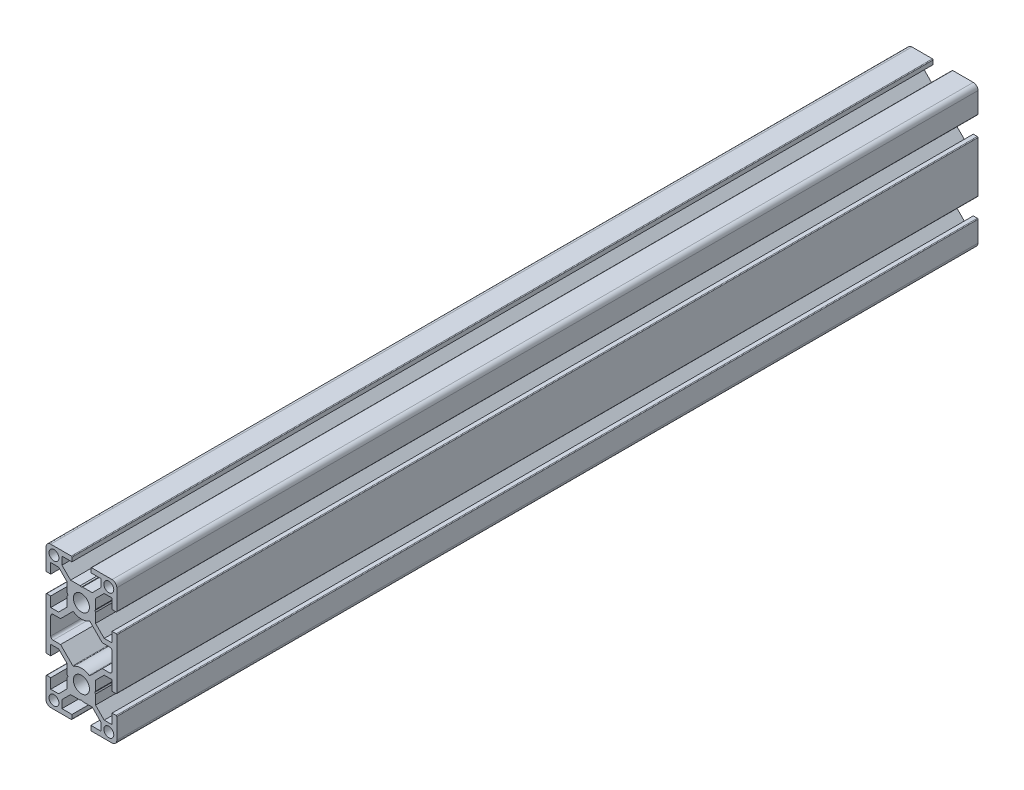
ISO-10303-21;
HEADER;
FILE_DESCRIPTION(('STEP AP214'),'2;1');
FILE_NAME('part.step','',(''),(''),'','','');
FILE_SCHEMA(('AUTOMOTIVE_DESIGN { 1 0 10303 214 1 1 1 1 }'));
ENDSEC;
DATA;
#1=APPLICATION_CONTEXT('core data for automotive mechanical design processes');
#2=APPLICATION_PROTOCOL_DEFINITION('international standard','automotive_design',2000,#1);
#3=PRODUCT_CONTEXT('',#1,'mechanical');
#4=PRODUCT('Part','Part','',(#3));
#5=PRODUCT_RELATED_PRODUCT_CATEGORY('part','',(#4));
#6=PRODUCT_DEFINITION_FORMATION('','',#4);
#7=PRODUCT_DEFINITION_CONTEXT('part definition',#1,'design');
#8=PRODUCT_DEFINITION('design','',#6,#7);
#9=PRODUCT_DEFINITION_SHAPE('','',#8);
#10=(LENGTH_UNIT() NAMED_UNIT(*) SI_UNIT(.MILLI.,.METRE.));
#11=(NAMED_UNIT(*) PLANE_ANGLE_UNIT() SI_UNIT($,.RADIAN.));
#12=(NAMED_UNIT(*) SI_UNIT($,.STERADIAN.) SOLID_ANGLE_UNIT());
#13=UNCERTAINTY_MEASURE_WITH_UNIT(LENGTH_MEASURE(1.E-05),#10,'distance_accuracy_value','');
#14=(GEOMETRIC_REPRESENTATION_CONTEXT(3) GLOBAL_UNCERTAINTY_ASSIGNED_CONTEXT((#13)) GLOBAL_UNIT_ASSIGNED_CONTEXT((#10,
#11,#12)) REPRESENTATION_CONTEXT('',''));
#15=CARTESIAN_POINT('',(0.,0.,0.));
#16=DIRECTION('',(0.,0.,1.));
#17=DIRECTION('',(1.,0.,0.));
#18=AXIS2_PLACEMENT_3D('',#15,#16,#17);
#19=CARTESIAN_POINT('',(-13.,-28.,-365.));
#20=DIRECTION('',(0.,0.,1.));
#21=DIRECTION('',(1.,0.,0.));
#22=AXIS2_PLACEMENT_3D('',#19,#20,#21);
#23=CYLINDRICAL_SURFACE('',#22,2.);
#24=CARTESIAN_POINT('',(-13.,-28.,0.));
#25=DIRECTION('',(0.,0.,1.));
#26=DIRECTION('',(1.,0.,0.));
#27=AXIS2_PLACEMENT_3D('',#24,#25,#26);
#28=CIRCLE('',#27,2.);
#29=CARTESIAN_POINT('',(-15.,-28.,0.));
#30=VERTEX_POINT('',#29);
#31=CARTESIAN_POINT('',(-13.,-30.,0.));
#32=VERTEX_POINT('',#31);
#33=EDGE_CURVE('E931',#30,#32,#28,.T.);
#34=ORIENTED_EDGE('',*,*,#33,.F.);
#35=DIRECTION('',(0.,0.,1.));
#36=VECTOR('',#35,1.);
#37=CARTESIAN_POINT('',(-15.,-28.,-365.));
#38=LINE('',#37,#36);
#39=CARTESIAN_POINT('',(-15.,-28.,-365.));
#40=VERTEX_POINT('',#39);
#41=EDGE_CURVE('E11',#40,#30,#38,.T.);
#42=ORIENTED_EDGE('',*,*,#41,.F.);
#43=CARTESIAN_POINT('',(-13.,-28.,-365.));
#44=DIRECTION('',(0.,0.,1.));
#45=DIRECTION('',(1.,0.,0.));
#46=AXIS2_PLACEMENT_3D('',#43,#44,#45);
#47=CIRCLE('',#46,2.);
#48=CARTESIAN_POINT('',(-13.,-30.,-365.));
#49=VERTEX_POINT('',#48);
#50=EDGE_CURVE('E934',#40,#49,#47,.T.);
#51=ORIENTED_EDGE('',*,*,#50,.T.);
#52=DIRECTION('',(0.,0.,1.));
#53=VECTOR('',#52,1.);
#54=CARTESIAN_POINT('',(-13.,-30.,-365.));
#55=LINE('',#54,#53);
#56=EDGE_CURVE('E19',#49,#32,#55,.T.);
#57=ORIENTED_EDGE('',*,*,#56,.T.);
#58=EDGE_LOOP('',(#34,#42,#51,#57));
#59=FACE_BOUND('',#58,.T.);
#60=ADVANCED_FACE('F16',(#59),#23,.T.);
#61=CARTESIAN_POINT('',(-15.,-19.3000023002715,-365.));
#62=DIRECTION('',(-1.,0.,0.));
#63=DIRECTION('',(0.,0.,1.));
#64=AXIS2_PLACEMENT_3D('',#61,#62,#63);
#65=PLANE('',#64);
#66=DIRECTION('',(0.,-1.,0.));
#67=VECTOR('',#66,1.);
#68=CARTESIAN_POINT('',(-15.,-19.3000023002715,0.));
#69=LINE('',#68,#67);
#70=CARTESIAN_POINT('',(-15.,-19.3000023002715,0.));
#71=VERTEX_POINT('',#70);
#72=EDGE_CURVE('E938',#71,#30,#69,.T.);
#73=ORIENTED_EDGE('',*,*,#72,.F.);
#74=DIRECTION('',(0.,0.,1.));
#75=VECTOR('',#74,1.);
#76=CARTESIAN_POINT('',(-15.,-19.3000023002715,-365.));
#77=LINE('',#76,#75);
#78=CARTESIAN_POINT('',(-15.,-19.3000023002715,-365.));
#79=VERTEX_POINT('',#78);
#80=EDGE_CURVE('E24',#79,#71,#77,.T.);
#81=ORIENTED_EDGE('',*,*,#80,.F.);
#82=DIRECTION('',(0.,-1.,0.));
#83=VECTOR('',#82,1.);
#84=CARTESIAN_POINT('',(-15.,-19.3000023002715,-365.));
#85=LINE('',#84,#83);
#86=EDGE_CURVE('E1226',#79,#40,#85,.T.);
#87=ORIENTED_EDGE('',*,*,#86,.T.);
#88=ORIENTED_EDGE('',*,*,#41,.T.);
#89=EDGE_LOOP('',(#73,#81,#87,#88));
#90=FACE_BOUND('',#89,.T.);
#91=ADVANCED_FACE('F1723',(#90),#65,.T.);
#92=CARTESIAN_POINT('',(-14.7,-19.3000023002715,-365.));
#93=DIRECTION('',(0.,0.,1.));
#94=DIRECTION('',(1.,0.,0.));
#95=AXIS2_PLACEMENT_3D('',#92,#93,#94);
#96=CYLINDRICAL_SURFACE('',#95,0.299999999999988);
#97=CARTESIAN_POINT('',(-14.7,-19.3000023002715,0.));
#98=DIRECTION('',(0.,0.,1.));
#99=DIRECTION('',(1.,0.,0.));
#100=AXIS2_PLACEMENT_3D('',#97,#98,#99);
#101=CIRCLE('',#100,0.299999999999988);
#102=CARTESIAN_POINT('',(-14.7,-19.0000023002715,0.));
#103=VERTEX_POINT('',#102);
#104=EDGE_CURVE('E1516',#103,#71,#101,.T.);
#105=ORIENTED_EDGE('',*,*,#104,.F.);
#106=DIRECTION('',(0.,0.,1.));
#107=VECTOR('',#106,1.);
#108=CARTESIAN_POINT('',(-14.7,-19.0000023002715,-365.));
#109=LINE('',#108,#107);
#110=CARTESIAN_POINT('',(-14.7,-19.0000023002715,-365.));
#111=VERTEX_POINT('',#110);
#112=EDGE_CURVE('E1522',#111,#103,#109,.T.);
#113=ORIENTED_EDGE('',*,*,#112,.F.);
#114=CARTESIAN_POINT('',(-14.7,-19.3000023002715,-365.));
#115=DIRECTION('',(0.,0.,1.));
#116=DIRECTION('',(1.,0.,0.));
#117=AXIS2_PLACEMENT_3D('',#114,#115,#116);
#118=CIRCLE('',#117,0.299999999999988);
#119=EDGE_CURVE('E1223',#111,#79,#118,.T.);
#120=ORIENTED_EDGE('',*,*,#119,.T.);
#121=ORIENTED_EDGE('',*,*,#80,.T.);
#122=EDGE_LOOP('',(#105,#113,#120,#121));
#123=FACE_BOUND('',#122,.T.);
#124=ADVANCED_FACE('F2103',(#123),#96,.T.);
#125=CARTESIAN_POINT('',(-12.9999999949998,-19.0000023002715,-365.));
#126=DIRECTION('',(0.,1.,0.));
#127=DIRECTION('',(0.,0.,1.));
#128=AXIS2_PLACEMENT_3D('',#125,#126,#127);
#129=PLANE('',#128);
#130=DIRECTION('',(-1.,0.,0.));
#131=VECTOR('',#130,1.);
#132=CARTESIAN_POINT('',(-12.9999999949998,-19.0000023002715,0.));
#133=LINE('',#132,#131);
#134=CARTESIAN_POINT('',(-12.9999999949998,-19.0000023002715,0.));
#135=VERTEX_POINT('',#134);
#136=EDGE_CURVE('E1513',#135,#103,#133,.T.);
#137=ORIENTED_EDGE('',*,*,#136,.F.);
#138=DIRECTION('',(0.,0.,1.));
#139=VECTOR('',#138,1.);
#140=CARTESIAN_POINT('',(-12.9999999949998,-19.0000023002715,-365.));
#141=LINE('',#140,#139);
#142=CARTESIAN_POINT('',(-12.9999999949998,-19.0000023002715,-365.));
#143=VERTEX_POINT('',#142);
#144=EDGE_CURVE('E1524',#143,#135,#141,.T.);
#145=ORIENTED_EDGE('',*,*,#144,.F.);
#146=DIRECTION('',(-1.,0.,0.));
#147=VECTOR('',#146,1.);
#148=CARTESIAN_POINT('',(-12.9999999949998,-19.0000023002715,-365.));
#149=LINE('',#148,#147);
#150=EDGE_CURVE('E1220',#143,#111,#149,.T.);
#151=ORIENTED_EDGE('',*,*,#150,.T.);
#152=ORIENTED_EDGE('',*,*,#112,.T.);
#153=EDGE_LOOP('',(#137,#145,#151,#152));
#154=FACE_BOUND('',#153,.T.);
#155=ADVANCED_FACE('F2101',(#154),#129,.T.);
#156=CARTESIAN_POINT('',(-12.9999999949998,-23.2500000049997,-365.));
#157=DIRECTION('',(1.,0.,0.));
#158=DIRECTION('',(0.,0.,-1.));
#159=AXIS2_PLACEMENT_3D('',#156,#157,#158);
#160=PLANE('',#159);
#161=DIRECTION('',(0.,1.,0.));
#162=VECTOR('',#161,1.);
#163=CARTESIAN_POINT('',(-12.9999999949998,-23.2500000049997,0.));
#164=LINE('',#163,#162);
#165=CARTESIAN_POINT('',(-12.9999999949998,-23.2500000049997,0.));
#166=VERTEX_POINT('',#165);
#167=EDGE_CURVE('E1510',#166,#135,#164,.T.);
#168=ORIENTED_EDGE('',*,*,#167,.F.);
#169=DIRECTION('',(0.,0.,1.));
#170=VECTOR('',#169,1.);
#171=CARTESIAN_POINT('',(-12.9999999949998,-23.2500000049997,-365.));
#172=LINE('',#171,#170);
#173=CARTESIAN_POINT('',(-12.9999999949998,-23.2500000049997,-365.));
#174=VERTEX_POINT('',#173);
#175=EDGE_CURVE('E1526',#174,#166,#172,.T.);
#176=ORIENTED_EDGE('',*,*,#175,.F.);
#177=DIRECTION('',(0.,1.,0.));
#178=VECTOR('',#177,1.);
#179=CARTESIAN_POINT('',(-12.9999999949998,-23.2500000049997,-365.));
#180=LINE('',#179,#178);
#181=EDGE_CURVE('E1217',#174,#143,#180,.T.);
#182=ORIENTED_EDGE('',*,*,#181,.T.);
#183=ORIENTED_EDGE('',*,*,#144,.T.);
#184=EDGE_LOOP('',(#168,#176,#182,#183));
#185=FACE_BOUND('',#184,.T.);
#186=ADVANCED_FACE('F2097',(#185),#160,.T.);
#187=CARTESIAN_POINT('',(-9.66421355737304,-23.2500000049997,-365.));
#188=DIRECTION('',(0.,1.,0.));
#189=DIRECTION('',(0.,0.,1.));
#190=AXIS2_PLACEMENT_3D('',#187,#188,#189);
#191=PLANE('',#190);
#192=DIRECTION('',(-1.,0.,0.));
#193=VECTOR('',#192,1.);
#194=CARTESIAN_POINT('',(-9.66421355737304,-23.2500000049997,0.));
#195=LINE('',#194,#193);
#196=CARTESIAN_POINT('',(-9.66421355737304,-23.2500000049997,0.));
#197=VERTEX_POINT('',#196);
#198=EDGE_CURVE('E1507',#197,#166,#195,.T.);
#199=ORIENTED_EDGE('',*,*,#198,.F.);
#200=DIRECTION('',(0.,0.,1.));
#201=VECTOR('',#200,1.);
#202=CARTESIAN_POINT('',(-9.66421355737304,-23.2500000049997,-365.));
#203=LINE('',#202,#201);
#204=CARTESIAN_POINT('',(-9.66421355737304,-23.2500000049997,-365.));
#205=VERTEX_POINT('',#204);
#206=EDGE_CURVE('E1528',#205,#197,#203,.T.);
#207=ORIENTED_EDGE('',*,*,#206,.F.);
#208=DIRECTION('',(-1.,0.,0.));
#209=VECTOR('',#208,1.);
#210=CARTESIAN_POINT('',(-9.66421355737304,-23.2500000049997,-365.));
#211=LINE('',#210,#209);
#212=EDGE_CURVE('E1214',#205,#174,#211,.T.);
#213=ORIENTED_EDGE('',*,*,#212,.T.);
#214=ORIENTED_EDGE('',*,*,#175,.T.);
#215=EDGE_LOOP('',(#199,#207,#213,#214));
#216=FACE_BOUND('',#215,.T.);
#217=ADVANCED_FACE('F2093',(#216),#191,.T.);
#218=CARTESIAN_POINT('',(-5.9999999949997,-19.5857864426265,-365.));
#219=DIRECTION('',(-0.707106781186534,0.707106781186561,0.));
#220=DIRECTION('',(-0.707106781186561,-0.707106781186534,0.));
#221=AXIS2_PLACEMENT_3D('',#218,#219,#220);
#222=PLANE('',#221);
#223=DIRECTION('',(-0.707106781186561,-0.707106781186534,0.));
#224=VECTOR('',#223,1.);
#225=CARTESIAN_POINT('',(-5.9999999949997,-19.5857864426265,0.));
#226=LINE('',#225,#224);
#227=CARTESIAN_POINT('',(-5.9999999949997,-19.5857864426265,0.));
#228=VERTEX_POINT('',#227);
#229=EDGE_CURVE('E1504',#228,#197,#226,.T.);
#230=ORIENTED_EDGE('',*,*,#229,.F.);
#231=DIRECTION('',(0.,0.,1.));
#232=VECTOR('',#231,1.);
#233=CARTESIAN_POINT('',(-5.9999999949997,-19.5857864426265,-365.));
#234=LINE('',#233,#232);
#235=CARTESIAN_POINT('',(-5.9999999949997,-19.5857864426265,-365.));
#236=VERTEX_POINT('',#235);
#237=EDGE_CURVE('E1530',#236,#228,#234,.T.);
#238=ORIENTED_EDGE('',*,*,#237,.F.);
#239=DIRECTION('',(-0.707106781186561,-0.707106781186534,0.));
#240=VECTOR('',#239,1.);
#241=CARTESIAN_POINT('',(-5.9999999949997,-19.5857864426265,-365.));
#242=LINE('',#241,#240);
#243=EDGE_CURVE('E1211',#236,#205,#242,.T.);
#244=ORIENTED_EDGE('',*,*,#243,.T.);
#245=ORIENTED_EDGE('',*,*,#206,.T.);
#246=EDGE_LOOP('',(#230,#238,#244,#245));
#247=FACE_BOUND('',#246,.T.);
#248=ADVANCED_FACE('F2089',(#247),#222,.T.);
#249=CARTESIAN_POINT('',(-5.99999999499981,-15.5196152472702,-365.));
#250=DIRECTION('',(-1.,0.,0.));
#251=DIRECTION('',(0.,-1.,0.));
#252=AXIS2_PLACEMENT_3D('',#249,#250,#251);
#253=PLANE('',#252);
#254=DIRECTION('',(0.,-1.,0.));
#255=VECTOR('',#254,1.);
#256=CARTESIAN_POINT('',(-5.99999999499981,-15.5196152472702,0.));
#257=LINE('',#256,#255);
#258=CARTESIAN_POINT('',(-5.99999999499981,-15.5196152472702,0.));
#259=VERTEX_POINT('',#258);
#260=EDGE_CURVE('E1501',#259,#228,#257,.T.);
#261=ORIENTED_EDGE('',*,*,#260,.F.);
#262=DIRECTION('',(0.,0.,1.));
#263=VECTOR('',#262,1.);
#264=CARTESIAN_POINT('',(-5.99999999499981,-15.5196152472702,-365.));
#265=LINE('',#264,#263);
#266=CARTESIAN_POINT('',(-5.99999999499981,-15.5196152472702,-365.));
#267=VERTEX_POINT('',#266);
#268=EDGE_CURVE('E1532',#267,#259,#265,.T.);
#269=ORIENTED_EDGE('',*,*,#268,.F.);
#270=DIRECTION('',(0.,-1.,0.));
#271=VECTOR('',#270,1.);
#272=CARTESIAN_POINT('',(-5.99999999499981,-15.5196152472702,-365.));
#273=LINE('',#272,#271);
#274=EDGE_CURVE('E1208',#267,#236,#273,.T.);
#275=ORIENTED_EDGE('',*,*,#274,.T.);
#276=ORIENTED_EDGE('',*,*,#237,.T.);
#277=EDGE_LOOP('',(#261,#269,#275,#276));
#278=FACE_BOUND('',#277,.T.);
#279=ADVANCED_FACE('F2085',(#278),#253,.T.);
#280=CARTESIAN_POINT('',(-5.69999999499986,-15.0000000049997,-365.));
#281=DIRECTION('',(-0.866025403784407,0.500000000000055,0.));
#282=DIRECTION('',(-0.500000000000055,-0.866025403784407,0.));
#283=AXIS2_PLACEMENT_3D('',#280,#281,#282);
#284=PLANE('',#283);
#285=DIRECTION('',(-0.500000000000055,-0.866025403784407,0.));
#286=VECTOR('',#285,1.);
#287=CARTESIAN_POINT('',(-5.69999999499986,-15.0000000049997,0.));
#288=LINE('',#287,#286);
#289=CARTESIAN_POINT('',(-5.69999999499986,-15.0000000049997,0.));
#290=VERTEX_POINT('',#289);
#291=EDGE_CURVE('E1498',#290,#259,#288,.T.);
#292=ORIENTED_EDGE('',*,*,#291,.F.);
#293=DIRECTION('',(0.,0.,1.));
#294=VECTOR('',#293,1.);
#295=CARTESIAN_POINT('',(-5.69999999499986,-15.0000000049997,-365.));
#296=LINE('',#295,#294);
#297=CARTESIAN_POINT('',(-5.69999999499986,-15.0000000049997,-365.));
#298=VERTEX_POINT('',#297);
#299=EDGE_CURVE('E1534',#298,#290,#296,.T.);
#300=ORIENTED_EDGE('',*,*,#299,.F.);
#301=DIRECTION('',(-0.500000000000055,-0.866025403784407,0.));
#302=VECTOR('',#301,1.);
#303=CARTESIAN_POINT('',(-5.69999999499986,-15.0000000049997,-365.));
#304=LINE('',#303,#302);
#305=EDGE_CURVE('E1205',#298,#267,#304,.T.);
#306=ORIENTED_EDGE('',*,*,#305,.T.);
#307=ORIENTED_EDGE('',*,*,#268,.T.);
#308=EDGE_LOOP('',(#292,#300,#306,#307));
#309=FACE_BOUND('',#308,.T.);
#310=ADVANCED_FACE('F2081',(#309),#284,.T.);
#311=CARTESIAN_POINT('',(-5.99999999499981,-14.480384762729,-365.));
#312=DIRECTION('',(-0.866025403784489,-0.499999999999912,0.));
#313=DIRECTION('',(0.499999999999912,-0.86602540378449,0.));
#314=AXIS2_PLACEMENT_3D('',#311,#312,#313);
#315=PLANE('',#314);
#316=DIRECTION('',(0.499999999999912,-0.866025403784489,0.));
#317=VECTOR('',#316,1.);
#318=CARTESIAN_POINT('',(-5.99999999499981,-14.480384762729,0.));
#319=LINE('',#318,#317);
#320=CARTESIAN_POINT('',(-5.99999999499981,-14.480384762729,0.));
#321=VERTEX_POINT('',#320);
#322=EDGE_CURVE('E1495',#321,#290,#319,.T.);
#323=ORIENTED_EDGE('',*,*,#322,.F.);
#324=DIRECTION('',(0.,0.,1.));
#325=VECTOR('',#324,1.);
#326=CARTESIAN_POINT('',(-5.99999999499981,-14.480384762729,-365.));
#327=LINE('',#326,#325);
#328=CARTESIAN_POINT('',(-5.99999999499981,-14.480384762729,-365.));
#329=VERTEX_POINT('',#328);
#330=EDGE_CURVE('E1536',#329,#321,#327,.T.);
#331=ORIENTED_EDGE('',*,*,#330,.F.);
#332=DIRECTION('',(0.499999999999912,-0.866025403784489,0.));
#333=VECTOR('',#332,1.);
#334=CARTESIAN_POINT('',(-5.99999999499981,-14.480384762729,-365.));
#335=LINE('',#334,#333);
#336=EDGE_CURVE('E1202',#329,#298,#335,.T.);
#337=ORIENTED_EDGE('',*,*,#336,.T.);
#338=ORIENTED_EDGE('',*,*,#299,.T.);
#339=EDGE_LOOP('',(#323,#331,#337,#338));
#340=FACE_BOUND('',#339,.T.);
#341=ADVANCED_FACE('F2077',(#340),#315,.T.);
#342=CARTESIAN_POINT('',(-5.99999999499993,-10.4142135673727,-365.));
#343=DIRECTION('',(-1.,0.,0.));
#344=DIRECTION('',(0.,-1.,0.));
#345=AXIS2_PLACEMENT_3D('',#342,#343,#344);
#346=PLANE('',#345);
#347=DIRECTION('',(0.,-1.,0.));
#348=VECTOR('',#347,1.);
#349=CARTESIAN_POINT('',(-5.99999999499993,-10.4142135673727,0.));
#350=LINE('',#349,#348);
#351=CARTESIAN_POINT('',(-5.99999999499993,-10.4142135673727,0.));
#352=VERTEX_POINT('',#351);
#353=EDGE_CURVE('E1492',#352,#321,#350,.T.);
#354=ORIENTED_EDGE('',*,*,#353,.F.);
#355=DIRECTION('',(0.,0.,1.));
#356=VECTOR('',#355,1.);
#357=CARTESIAN_POINT('',(-5.99999999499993,-10.4142135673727,-365.));
#358=LINE('',#357,#356);
#359=CARTESIAN_POINT('',(-5.99999999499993,-10.4142135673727,-365.));
#360=VERTEX_POINT('',#359);
#361=EDGE_CURVE('E1538',#360,#352,#358,.T.);
#362=ORIENTED_EDGE('',*,*,#361,.F.);
#363=DIRECTION('',(0.,-1.,0.));
#364=VECTOR('',#363,1.);
#365=CARTESIAN_POINT('',(-5.99999999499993,-10.4142135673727,-365.));
#366=LINE('',#365,#364);
#367=EDGE_CURVE('E1199',#360,#329,#366,.T.);
#368=ORIENTED_EDGE('',*,*,#367,.T.);
#369=ORIENTED_EDGE('',*,*,#330,.T.);
#370=EDGE_LOOP('',(#354,#362,#368,#369));
#371=FACE_BOUND('',#370,.T.);
#372=ADVANCED_FACE('F2073',(#371),#346,.T.);
#373=CARTESIAN_POINT('',(-9.66421355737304,-6.75000000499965,-365.));
#374=DIRECTION('',(-0.707106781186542,-0.707106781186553,0.));
#375=DIRECTION('',(0.707106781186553,-0.707106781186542,0.));
#376=AXIS2_PLACEMENT_3D('',#373,#374,#375);
#377=PLANE('',#376);
#378=DIRECTION('',(0.707106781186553,-0.707106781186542,0.));
#379=VECTOR('',#378,1.);
#380=CARTESIAN_POINT('',(-9.66421355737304,-6.75000000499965,0.));
#381=LINE('',#380,#379);
#382=CARTESIAN_POINT('',(-9.66421355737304,-6.75000000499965,0.));
#383=VERTEX_POINT('',#382);
#384=EDGE_CURVE('E1489',#383,#352,#381,.T.);
#385=ORIENTED_EDGE('',*,*,#384,.F.);
#386=DIRECTION('',(0.,0.,1.));
#387=VECTOR('',#386,1.);
#388=CARTESIAN_POINT('',(-9.66421355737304,-6.75000000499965,-365.));
#389=LINE('',#388,#387);
#390=CARTESIAN_POINT('',(-9.66421355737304,-6.75000000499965,-365.));
#391=VERTEX_POINT('',#390);
#392=EDGE_CURVE('E1540',#391,#383,#389,.T.);
#393=ORIENTED_EDGE('',*,*,#392,.F.);
#394=DIRECTION('',(0.707106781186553,-0.707106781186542,0.));
#395=VECTOR('',#394,1.);
#396=CARTESIAN_POINT('',(-9.66421355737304,-6.75000000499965,-365.));
#397=LINE('',#396,#395);
#398=EDGE_CURVE('E1196',#391,#360,#397,.T.);
#399=ORIENTED_EDGE('',*,*,#398,.T.);
#400=ORIENTED_EDGE('',*,*,#361,.T.);
#401=EDGE_LOOP('',(#385,#393,#399,#400));
#402=FACE_BOUND('',#401,.T.);
#403=ADVANCED_FACE('F2069',(#402),#377,.T.);
#404=CARTESIAN_POINT('',(-12.9999999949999,-6.75000000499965,-365.));
#405=DIRECTION('',(0.,-1.,0.));
#406=DIRECTION('',(0.,0.,-1.));
#407=AXIS2_PLACEMENT_3D('',#404,#405,#406);
#408=PLANE('',#407);
#409=DIRECTION('',(1.,0.,0.));
#410=VECTOR('',#409,1.);
#411=CARTESIAN_POINT('',(-12.9999999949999,-6.75000000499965,0.));
#412=LINE('',#411,#410);
#413=CARTESIAN_POINT('',(-12.9999999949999,-6.75000000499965,0.));
#414=VERTEX_POINT('',#413);
#415=EDGE_CURVE('E1486',#414,#383,#412,.T.);
#416=ORIENTED_EDGE('',*,*,#415,.F.);
#417=DIRECTION('',(0.,0.,1.));
#418=VECTOR('',#417,1.);
#419=CARTESIAN_POINT('',(-12.9999999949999,-6.75000000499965,-365.));
#420=LINE('',#419,#418);
#421=CARTESIAN_POINT('',(-12.9999999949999,-6.75000000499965,-365.));
#422=VERTEX_POINT('',#421);
#423=EDGE_CURVE('E1542',#422,#414,#420,.T.);
#424=ORIENTED_EDGE('',*,*,#423,.F.);
#425=DIRECTION('',(1.,0.,0.));
#426=VECTOR('',#425,1.);
#427=CARTESIAN_POINT('',(-12.9999999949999,-6.75000000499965,-365.));
#428=LINE('',#427,#426);
#429=EDGE_CURVE('E1193',#422,#391,#428,.T.);
#430=ORIENTED_EDGE('',*,*,#429,.T.);
#431=ORIENTED_EDGE('',*,*,#392,.T.);
#432=EDGE_LOOP('',(#416,#424,#430,#431));
#433=FACE_BOUND('',#432,.T.);
#434=ADVANCED_FACE('F2065',(#433),#408,.T.);
#435=CARTESIAN_POINT('',(-12.9999999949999,-11.0000023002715,-365.));
#436=DIRECTION('',(1.,0.,0.));
#437=DIRECTION('',(0.,0.,-1.));
#438=AXIS2_PLACEMENT_3D('',#435,#436,#437);
#439=PLANE('',#438);
#440=DIRECTION('',(0.,1.,0.));
#441=VECTOR('',#440,1.);
#442=CARTESIAN_POINT('',(-12.9999999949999,-11.0000023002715,0.));
#443=LINE('',#442,#441);
#444=CARTESIAN_POINT('',(-12.9999999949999,-11.0000023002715,0.));
#445=VERTEX_POINT('',#444);
#446=EDGE_CURVE('E1483',#445,#414,#443,.T.);
#447=ORIENTED_EDGE('',*,*,#446,.F.);
#448=DIRECTION('',(0.,0.,1.));
#449=VECTOR('',#448,1.);
#450=CARTESIAN_POINT('',(-12.9999999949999,-11.0000023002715,-365.));
#451=LINE('',#450,#449);
#452=CARTESIAN_POINT('',(-12.9999999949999,-11.0000023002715,-365.));
#453=VERTEX_POINT('',#452);
#454=EDGE_CURVE('E1544',#453,#445,#451,.T.);
#455=ORIENTED_EDGE('',*,*,#454,.F.);
#456=DIRECTION('',(0.,1.,0.));
#457=VECTOR('',#456,1.);
#458=CARTESIAN_POINT('',(-12.9999999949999,-11.0000023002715,-365.));
#459=LINE('',#458,#457);
#460=EDGE_CURVE('E1190',#453,#422,#459,.T.);
#461=ORIENTED_EDGE('',*,*,#460,.T.);
#462=ORIENTED_EDGE('',*,*,#423,.T.);
#463=EDGE_LOOP('',(#447,#455,#461,#462));
#464=FACE_BOUND('',#463,.T.);
#465=ADVANCED_FACE('F2061',(#464),#439,.T.);
#466=CARTESIAN_POINT('',(-14.7,-11.0000023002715,-365.));
#467=DIRECTION('',(0.,-1.,0.));
#468=DIRECTION('',(0.,0.,-1.));
#469=AXIS2_PLACEMENT_3D('',#466,#467,#468);
#470=PLANE('',#469);
#471=DIRECTION('',(1.,0.,0.));
#472=VECTOR('',#471,1.);
#473=CARTESIAN_POINT('',(-14.7,-11.0000023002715,0.));
#474=LINE('',#473,#472);
#475=CARTESIAN_POINT('',(-14.7,-11.0000023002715,0.));
#476=VERTEX_POINT('',#475);
#477=EDGE_CURVE('E1480',#476,#445,#474,.T.);
#478=ORIENTED_EDGE('',*,*,#477,.F.);
#479=DIRECTION('',(0.,0.,1.));
#480=VECTOR('',#479,1.);
#481=CARTESIAN_POINT('',(-14.7,-11.0000023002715,-365.));
#482=LINE('',#481,#480);
#483=CARTESIAN_POINT('',(-14.7,-11.0000023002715,-365.));
#484=VERTEX_POINT('',#483);
#485=EDGE_CURVE('E1546',#484,#476,#482,.T.);
#486=ORIENTED_EDGE('',*,*,#485,.F.);
#487=DIRECTION('',(1.,0.,0.));
#488=VECTOR('',#487,1.);
#489=CARTESIAN_POINT('',(-14.7,-11.0000023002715,-365.));
#490=LINE('',#489,#488);
#491=EDGE_CURVE('E1187',#484,#453,#490,.T.);
#492=ORIENTED_EDGE('',*,*,#491,.T.);
#493=ORIENTED_EDGE('',*,*,#454,.T.);
#494=EDGE_LOOP('',(#478,#486,#492,#493));
#495=FACE_BOUND('',#494,.T.);
#496=ADVANCED_FACE('F2057',(#495),#470,.T.);
#497=CARTESIAN_POINT('',(-14.7,-10.7000023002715,-365.));
#498=DIRECTION('',(0.,0.,1.));
#499=DIRECTION('',(1.,0.,0.));
#500=AXIS2_PLACEMENT_3D('',#497,#498,#499);
#501=CYLINDRICAL_SURFACE('',#500,0.3);
#502=CARTESIAN_POINT('',(-14.7,-10.7000023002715,0.));
#503=DIRECTION('',(0.,0.,1.));
#504=DIRECTION('',(1.,0.,0.));
#505=AXIS2_PLACEMENT_3D('',#502,#503,#504);
#506=CIRCLE('',#505,0.3);
#507=CARTESIAN_POINT('',(-15.,-10.7000023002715,0.));
#508=VERTEX_POINT('',#507);
#509=EDGE_CURVE('E1477',#508,#476,#506,.T.);
#510=ORIENTED_EDGE('',*,*,#509,.F.);
#511=DIRECTION('',(0.,0.,1.));
#512=VECTOR('',#511,1.);
#513=CARTESIAN_POINT('',(-15.,-10.7000023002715,-365.));
#514=LINE('',#513,#512);
#515=CARTESIAN_POINT('',(-15.,-10.7000023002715,-365.));
#516=VERTEX_POINT('',#515);
#517=EDGE_CURVE('E1548',#516,#508,#514,.T.);
#518=ORIENTED_EDGE('',*,*,#517,.F.);
#519=CARTESIAN_POINT('',(-14.7,-10.7000023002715,-365.));
#520=DIRECTION('',(0.,0.,1.));
#521=DIRECTION('',(1.,0.,0.));
#522=AXIS2_PLACEMENT_3D('',#519,#520,#521);
#523=CIRCLE('',#522,0.3);
#524=EDGE_CURVE('E1184',#516,#484,#523,.T.);
#525=ORIENTED_EDGE('',*,*,#524,.T.);
#526=ORIENTED_EDGE('',*,*,#485,.T.);
#527=EDGE_LOOP('',(#510,#518,#525,#526));
#528=FACE_BOUND('',#527,.T.);
#529=ADVANCED_FACE('F2053',(#528),#501,.T.);
#530=CARTESIAN_POINT('',(-15.,10.7000023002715,-365.));
#531=DIRECTION('',(-1.,0.,0.));
#532=DIRECTION('',(0.,0.,1.));
#533=AXIS2_PLACEMENT_3D('',#530,#531,#532);
#534=PLANE('',#533);
#535=DIRECTION('',(0.,-1.,0.));
#536=VECTOR('',#535,1.);
#537=CARTESIAN_POINT('',(-15.,10.7000023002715,0.));
#538=LINE('',#537,#536);
#539=CARTESIAN_POINT('',(-15.,10.7000023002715,0.));
#540=VERTEX_POINT('',#539);
#541=EDGE_CURVE('E1474',#540,#508,#538,.T.);
#542=ORIENTED_EDGE('',*,*,#541,.F.);
#543=DIRECTION('',(0.,0.,1.));
#544=VECTOR('',#543,1.);
#545=CARTESIAN_POINT('',(-15.,10.7000023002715,-365.));
#546=LINE('',#545,#544);
#547=CARTESIAN_POINT('',(-15.,10.7000023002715,-365.));
#548=VERTEX_POINT('',#547);
#549=EDGE_CURVE('E1550',#548,#540,#546,.T.);
#550=ORIENTED_EDGE('',*,*,#549,.F.);
#551=DIRECTION('',(0.,-1.,0.));
#552=VECTOR('',#551,1.);
#553=CARTESIAN_POINT('',(-15.,10.7000023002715,-365.));
#554=LINE('',#553,#552);
#555=EDGE_CURVE('E1181',#548,#516,#554,.T.);
#556=ORIENTED_EDGE('',*,*,#555,.T.);
#557=ORIENTED_EDGE('',*,*,#517,.T.);
#558=EDGE_LOOP('',(#542,#550,#556,#557));
#559=FACE_BOUND('',#558,.T.);
#560=ADVANCED_FACE('F2049',(#559),#534,.T.);
#561=CARTESIAN_POINT('',(-14.7,10.7000023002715,-365.));
#562=DIRECTION('',(0.,0.,1.));
#563=DIRECTION('',(1.,0.,0.));
#564=AXIS2_PLACEMENT_3D('',#561,#562,#563);
#565=CYLINDRICAL_SURFACE('',#564,0.300000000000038);
#566=CARTESIAN_POINT('',(-14.7,10.7000023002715,0.));
#567=DIRECTION('',(0.,0.,1.));
#568=DIRECTION('',(1.,0.,0.));
#569=AXIS2_PLACEMENT_3D('',#566,#567,#568);
#570=CIRCLE('',#569,0.300000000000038);
#571=CARTESIAN_POINT('',(-14.7,11.0000023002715,0.));
#572=VERTEX_POINT('',#571);
#573=EDGE_CURVE('E1471',#572,#540,#570,.T.);
#574=ORIENTED_EDGE('',*,*,#573,.F.);
#575=DIRECTION('',(0.,0.,1.));
#576=VECTOR('',#575,1.);
#577=CARTESIAN_POINT('',(-14.7,11.0000023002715,-365.));
#578=LINE('',#577,#576);
#579=CARTESIAN_POINT('',(-14.7,11.0000023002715,-365.));
#580=VERTEX_POINT('',#579);
#581=EDGE_CURVE('E1552',#580,#572,#578,.T.);
#582=ORIENTED_EDGE('',*,*,#581,.F.);
#583=CARTESIAN_POINT('',(-14.7,10.7000023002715,-365.));
#584=DIRECTION('',(0.,0.,1.));
#585=DIRECTION('',(1.,0.,0.));
#586=AXIS2_PLACEMENT_3D('',#583,#584,#585);
#587=CIRCLE('',#586,0.300000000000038);
#588=EDGE_CURVE('E1178',#580,#548,#587,.T.);
#589=ORIENTED_EDGE('',*,*,#588,.T.);
#590=ORIENTED_EDGE('',*,*,#549,.T.);
#591=EDGE_LOOP('',(#574,#582,#589,#590));
#592=FACE_BOUND('',#591,.T.);
#593=ADVANCED_FACE('F2045',(#592),#565,.T.);
#594=CARTESIAN_POINT('',(-12.9999999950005,11.0000023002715,-365.));
#595=DIRECTION('',(0.,1.,0.));
#596=DIRECTION('',(0.,0.,1.));
#597=AXIS2_PLACEMENT_3D('',#594,#595,#596);
#598=PLANE('',#597);
#599=DIRECTION('',(-1.,0.,0.));
#600=VECTOR('',#599,1.);
#601=CARTESIAN_POINT('',(-12.9999999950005,11.0000023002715,0.));
#602=LINE('',#601,#600);
#603=CARTESIAN_POINT('',(-12.9999999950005,11.0000023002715,0.));
#604=VERTEX_POINT('',#603);
#605=EDGE_CURVE('E1468',#604,#572,#602,.T.);
#606=ORIENTED_EDGE('',*,*,#605,.F.);
#607=DIRECTION('',(0.,0.,1.));
#608=VECTOR('',#607,1.);
#609=CARTESIAN_POINT('',(-12.9999999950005,11.0000023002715,-365.));
#610=LINE('',#609,#608);
#611=CARTESIAN_POINT('',(-12.9999999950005,11.0000023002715,-365.));
#612=VERTEX_POINT('',#611);
#613=EDGE_CURVE('E1554',#612,#604,#610,.T.);
#614=ORIENTED_EDGE('',*,*,#613,.F.);
#615=DIRECTION('',(-1.,0.,0.));
#616=VECTOR('',#615,1.);
#617=CARTESIAN_POINT('',(-12.9999999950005,11.0000023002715,-365.));
#618=LINE('',#617,#616);
#619=EDGE_CURVE('E1175',#612,#580,#618,.T.);
#620=ORIENTED_EDGE('',*,*,#619,.T.);
#621=ORIENTED_EDGE('',*,*,#581,.T.);
#622=EDGE_LOOP('',(#606,#614,#620,#621));
#623=FACE_BOUND('',#622,.T.);
#624=ADVANCED_FACE('F2041',(#623),#598,.T.);
#625=CARTESIAN_POINT('',(-12.9999999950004,6.74999999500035,-365.));
#626=DIRECTION('',(1.,0.,0.));
#627=DIRECTION('',(0.,1.,0.));
#628=AXIS2_PLACEMENT_3D('',#625,#626,#627);
#629=PLANE('',#628);
#630=DIRECTION('',(0.,1.,0.));
#631=VECTOR('',#630,1.);
#632=CARTESIAN_POINT('',(-12.9999999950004,6.74999999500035,0.));
#633=LINE('',#632,#631);
#634=CARTESIAN_POINT('',(-12.9999999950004,6.74999999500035,0.));
#635=VERTEX_POINT('',#634);
#636=EDGE_CURVE('E1465',#635,#604,#633,.T.);
#637=ORIENTED_EDGE('',*,*,#636,.F.);
#638=DIRECTION('',(0.,0.,1.));
#639=VECTOR('',#638,1.);
#640=CARTESIAN_POINT('',(-12.9999999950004,6.74999999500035,-365.));
#641=LINE('',#640,#639);
#642=CARTESIAN_POINT('',(-12.9999999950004,6.74999999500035,-365.));
#643=VERTEX_POINT('',#642);
#644=EDGE_CURVE('E1556',#643,#635,#641,.T.);
#645=ORIENTED_EDGE('',*,*,#644,.F.);
#646=DIRECTION('',(0.,1.,0.));
#647=VECTOR('',#646,1.);
#648=CARTESIAN_POINT('',(-12.9999999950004,6.74999999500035,-365.));
#649=LINE('',#648,#647);
#650=EDGE_CURVE('E1172',#643,#612,#649,.T.);
#651=ORIENTED_EDGE('',*,*,#650,.T.);
#652=ORIENTED_EDGE('',*,*,#613,.T.);
#653=EDGE_LOOP('',(#637,#645,#651,#652));
#654=FACE_BOUND('',#653,.T.);
#655=ADVANCED_FACE('F2037',(#654),#629,.T.);
#656=CARTESIAN_POINT('',(-9.66421355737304,6.74999999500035,-365.));
#657=DIRECTION('',(0.,1.,0.));
#658=DIRECTION('',(0.,0.,1.));
#659=AXIS2_PLACEMENT_3D('',#656,#657,#658);
#660=PLANE('',#659);
#661=DIRECTION('',(-1.,0.,0.));
#662=VECTOR('',#661,1.);
#663=CARTESIAN_POINT('',(-9.66421355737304,6.74999999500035,0.));
#664=LINE('',#663,#662);
#665=CARTESIAN_POINT('',(-9.66421355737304,6.74999999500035,0.));
#666=VERTEX_POINT('',#665);
#667=EDGE_CURVE('E1462',#666,#635,#664,.T.);
#668=ORIENTED_EDGE('',*,*,#667,.F.);
#669=DIRECTION('',(0.,0.,1.));
#670=VECTOR('',#669,1.);
#671=CARTESIAN_POINT('',(-9.66421355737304,6.74999999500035,-365.));
#672=LINE('',#671,#670);
#673=CARTESIAN_POINT('',(-9.66421355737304,6.74999999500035,-365.));
#674=VERTEX_POINT('',#673);
#675=EDGE_CURVE('E1558',#674,#666,#672,.T.);
#676=ORIENTED_EDGE('',*,*,#675,.F.);
#677=DIRECTION('',(-1.,0.,0.));
#678=VECTOR('',#677,1.);
#679=CARTESIAN_POINT('',(-9.66421355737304,6.74999999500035,-365.));
#680=LINE('',#679,#678);
#681=EDGE_CURVE('E1169',#674,#643,#680,.T.);
#682=ORIENTED_EDGE('',*,*,#681,.T.);
#683=ORIENTED_EDGE('',*,*,#644,.T.);
#684=EDGE_LOOP('',(#668,#676,#682,#683));
#685=FACE_BOUND('',#684,.T.);
#686=ADVANCED_FACE('F2033',(#685),#660,.T.);
#687=CARTESIAN_POINT('',(-5.99999999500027,10.4142135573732,-365.));
#688=DIRECTION('',(-0.707106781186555,0.70710678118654,0.));
#689=DIRECTION('',(-0.70710678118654,-0.707106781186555,0.));
#690=AXIS2_PLACEMENT_3D('',#687,#688,#689);
#691=PLANE('',#690);
#692=DIRECTION('',(-0.70710678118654,-0.707106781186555,0.));
#693=VECTOR('',#692,1.);
#694=CARTESIAN_POINT('',(-5.99999999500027,10.4142135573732,0.));
#695=LINE('',#694,#693);
#696=CARTESIAN_POINT('',(-5.99999999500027,10.4142135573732,0.));
#697=VERTEX_POINT('',#696);
#698=EDGE_CURVE('E1459',#697,#666,#695,.T.);
#699=ORIENTED_EDGE('',*,*,#698,.F.);
#700=DIRECTION('',(0.,0.,1.));
#701=VECTOR('',#700,1.);
#702=CARTESIAN_POINT('',(-5.99999999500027,10.4142135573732,-365.));
#703=LINE('',#702,#701);
#704=CARTESIAN_POINT('',(-5.99999999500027,10.4142135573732,-365.));
#705=VERTEX_POINT('',#704);
#706=EDGE_CURVE('E1560',#705,#697,#703,.T.);
#707=ORIENTED_EDGE('',*,*,#706,.F.);
#708=DIRECTION('',(-0.70710678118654,-0.707106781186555,0.));
#709=VECTOR('',#708,1.);
#710=CARTESIAN_POINT('',(-5.99999999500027,10.4142135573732,-365.));
#711=LINE('',#710,#709);
#712=EDGE_CURVE('E1166',#705,#674,#711,.T.);
#713=ORIENTED_EDGE('',*,*,#712,.T.);
#714=ORIENTED_EDGE('',*,*,#675,.T.);
#715=EDGE_LOOP('',(#699,#707,#713,#714));
#716=FACE_BOUND('',#715,.T.);
#717=ADVANCED_FACE('F2029',(#716),#691,.T.);
#718=CARTESIAN_POINT('',(-5.99999999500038,14.4803847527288,-365.));
#719=DIRECTION('',(-1.,0.,0.));
#720=DIRECTION('',(0.,-1.,0.));
#721=AXIS2_PLACEMENT_3D('',#718,#719,#720);
#722=PLANE('',#721);
#723=DIRECTION('',(0.,-1.,0.));
#724=VECTOR('',#723,1.);
#725=CARTESIAN_POINT('',(-5.99999999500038,14.4803847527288,0.));
#726=LINE('',#725,#724);
#727=CARTESIAN_POINT('',(-5.99999999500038,14.4803847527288,0.));
#728=VERTEX_POINT('',#727);
#729=EDGE_CURVE('E1456',#728,#697,#726,.T.);
#730=ORIENTED_EDGE('',*,*,#729,.F.);
#731=DIRECTION('',(0.,0.,1.));
#732=VECTOR('',#731,1.);
#733=CARTESIAN_POINT('',(-5.99999999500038,14.4803847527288,-365.));
#734=LINE('',#733,#732);
#735=CARTESIAN_POINT('',(-5.99999999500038,14.4803847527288,-365.));
#736=VERTEX_POINT('',#735);
#737=EDGE_CURVE('E1562',#736,#728,#734,.T.);
#738=ORIENTED_EDGE('',*,*,#737,.F.);
#739=DIRECTION('',(0.,-1.,0.));
#740=VECTOR('',#739,1.);
#741=CARTESIAN_POINT('',(-5.99999999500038,14.4803847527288,-365.));
#742=LINE('',#741,#740);
#743=EDGE_CURVE('E1163',#736,#705,#742,.T.);
#744=ORIENTED_EDGE('',*,*,#743,.T.);
#745=ORIENTED_EDGE('',*,*,#706,.T.);
#746=EDGE_LOOP('',(#730,#738,#744,#745));
#747=FACE_BOUND('',#746,.T.);
#748=ADVANCED_FACE('F2025',(#747),#722,.T.);
#749=CARTESIAN_POINT('',(-5.69999999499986,14.9999999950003,-365.));
#750=DIRECTION('',(-0.866025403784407,0.500000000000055,0.));
#751=DIRECTION('',(-0.500000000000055,-0.866025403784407,0.));
#752=AXIS2_PLACEMENT_3D('',#749,#750,#751);
#753=PLANE('',#752);
#754=DIRECTION('',(-0.500000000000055,-0.866025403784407,0.));
#755=VECTOR('',#754,1.);
#756=CARTESIAN_POINT('',(-5.69999999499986,14.9999999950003,0.));
#757=LINE('',#756,#755);
#758=CARTESIAN_POINT('',(-5.69999999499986,14.9999999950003,0.));
#759=VERTEX_POINT('',#758);
#760=EDGE_CURVE('E1453',#759,#728,#757,.T.);
#761=ORIENTED_EDGE('',*,*,#760,.F.);
#762=DIRECTION('',(0.,0.,1.));
#763=VECTOR('',#762,1.);
#764=CARTESIAN_POINT('',(-5.69999999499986,14.9999999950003,-365.));
#765=LINE('',#764,#763);
#766=CARTESIAN_POINT('',(-5.69999999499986,14.9999999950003,-365.));
#767=VERTEX_POINT('',#766);
#768=EDGE_CURVE('E1564',#767,#759,#765,.T.);
#769=ORIENTED_EDGE('',*,*,#768,.F.);
#770=DIRECTION('',(-0.500000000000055,-0.866025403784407,0.));
#771=VECTOR('',#770,1.);
#772=CARTESIAN_POINT('',(-5.69999999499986,14.9999999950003,-365.));
#773=LINE('',#772,#771);
#774=EDGE_CURVE('E1160',#767,#736,#773,.T.);
#775=ORIENTED_EDGE('',*,*,#774,.T.);
#776=ORIENTED_EDGE('',*,*,#737,.T.);
#777=EDGE_LOOP('',(#761,#769,#775,#776));
#778=FACE_BOUND('',#777,.T.);
#779=ADVANCED_FACE('F2021',(#778),#753,.T.);
#780=CARTESIAN_POINT('',(-5.9999999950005,15.5196152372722,-365.));
#781=DIRECTION('',(-0.866025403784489,-0.499999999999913,0.));
#782=DIRECTION('',(0.499999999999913,-0.866025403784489,0.));
#783=AXIS2_PLACEMENT_3D('',#780,#781,#782);
#784=PLANE('',#783);
#785=DIRECTION('',(0.499999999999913,-0.866025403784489,0.));
#786=VECTOR('',#785,1.);
#787=CARTESIAN_POINT('',(-5.9999999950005,15.5196152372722,0.));
#788=LINE('',#787,#786);
#789=CARTESIAN_POINT('',(-5.9999999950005,15.5196152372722,0.));
#790=VERTEX_POINT('',#789);
#791=EDGE_CURVE('E1450',#790,#759,#788,.T.);
#792=ORIENTED_EDGE('',*,*,#791,.F.);
#793=DIRECTION('',(0.,0.,1.));
#794=VECTOR('',#793,1.);
#795=CARTESIAN_POINT('',(-5.9999999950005,15.5196152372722,-365.));
#796=LINE('',#795,#794);
#797=CARTESIAN_POINT('',(-5.9999999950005,15.5196152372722,-365.));
#798=VERTEX_POINT('',#797);
#799=EDGE_CURVE('E1566',#798,#790,#796,.T.);
#800=ORIENTED_EDGE('',*,*,#799,.F.);
#801=DIRECTION('',(0.499999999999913,-0.866025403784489,0.));
#802=VECTOR('',#801,1.);
#803=CARTESIAN_POINT('',(-5.9999999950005,15.5196152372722,-365.));
#804=LINE('',#803,#802);
#805=EDGE_CURVE('E1157',#798,#767,#804,.T.);
#806=ORIENTED_EDGE('',*,*,#805,.T.);
#807=ORIENTED_EDGE('',*,*,#768,.T.);
#808=EDGE_LOOP('',(#792,#800,#806,#807));
#809=FACE_BOUND('',#808,.T.);
#810=ADVANCED_FACE('F2017',(#809),#784,.T.);
#811=CARTESIAN_POINT('',(-5.99999999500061,19.5857864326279,-365.));
#812=DIRECTION('',(-1.,0.,0.));
#813=DIRECTION('',(0.,-1.,0.));
#814=AXIS2_PLACEMENT_3D('',#811,#812,#813);
#815=PLANE('',#814);
#816=DIRECTION('',(0.,-1.,0.));
#817=VECTOR('',#816,1.);
#818=CARTESIAN_POINT('',(-5.99999999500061,19.5857864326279,0.));
#819=LINE('',#818,#817);
#820=CARTESIAN_POINT('',(-5.99999999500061,19.5857864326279,0.));
#821=VERTEX_POINT('',#820);
#822=EDGE_CURVE('E1447',#821,#790,#819,.T.);
#823=ORIENTED_EDGE('',*,*,#822,.F.);
#824=DIRECTION('',(0.,0.,1.));
#825=VECTOR('',#824,1.);
#826=CARTESIAN_POINT('',(-5.99999999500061,19.5857864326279,-365.));
#827=LINE('',#826,#825);
#828=CARTESIAN_POINT('',(-5.99999999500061,19.5857864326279,-365.));
#829=VERTEX_POINT('',#828);
#830=EDGE_CURVE('E1568',#829,#821,#827,.T.);
#831=ORIENTED_EDGE('',*,*,#830,.F.);
#832=DIRECTION('',(0.,-1.,0.));
#833=VECTOR('',#832,1.);
#834=CARTESIAN_POINT('',(-5.99999999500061,19.5857864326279,-365.));
#835=LINE('',#834,#833);
#836=EDGE_CURVE('E1154',#829,#798,#835,.T.);
#837=ORIENTED_EDGE('',*,*,#836,.T.);
#838=ORIENTED_EDGE('',*,*,#799,.T.);
#839=EDGE_LOOP('',(#823,#831,#837,#838));
#840=FACE_BOUND('',#839,.T.);
#841=ADVANCED_FACE('F2013',(#840),#815,.T.);
#842=CARTESIAN_POINT('',(-9.66421355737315,23.2499999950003,-365.));
#843=DIRECTION('',(-0.707106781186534,-0.707106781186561,0.));
#844=DIRECTION('',(0.707106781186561,-0.707106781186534,0.));
#845=AXIS2_PLACEMENT_3D('',#842,#843,#844);
#846=PLANE('',#845);
#847=DIRECTION('',(0.707106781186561,-0.707106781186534,0.));
#848=VECTOR('',#847,1.);
#849=CARTESIAN_POINT('',(-9.66421355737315,23.2499999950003,0.));
#850=LINE('',#849,#848);
#851=CARTESIAN_POINT('',(-9.66421355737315,23.2499999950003,0.));
#852=VERTEX_POINT('',#851);
#853=EDGE_CURVE('E1444',#852,#821,#850,.T.);
#854=ORIENTED_EDGE('',*,*,#853,.F.);
#855=DIRECTION('',(0.,0.,1.));
#856=VECTOR('',#855,1.);
#857=CARTESIAN_POINT('',(-9.66421355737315,23.2499999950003,-365.));
#858=LINE('',#857,#856);
#859=CARTESIAN_POINT('',(-9.66421355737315,23.2499999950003,-365.));
#860=VERTEX_POINT('',#859);
#861=EDGE_CURVE('E1570',#860,#852,#858,.T.);
#862=ORIENTED_EDGE('',*,*,#861,.F.);
#863=DIRECTION('',(0.707106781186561,-0.707106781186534,0.));
#864=VECTOR('',#863,1.);
#865=CARTESIAN_POINT('',(-9.66421355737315,23.2499999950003,-365.));
#866=LINE('',#865,#864);
#867=EDGE_CURVE('E1151',#860,#829,#866,.T.);
#868=ORIENTED_EDGE('',*,*,#867,.T.);
#869=ORIENTED_EDGE('',*,*,#830,.T.);
#870=EDGE_LOOP('',(#854,#862,#868,#869));
#871=FACE_BOUND('',#870,.T.);
#872=ADVANCED_FACE('F2009',(#871),#846,.T.);
#873=CARTESIAN_POINT('',(-12.9999999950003,23.2499999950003,-365.));
#874=DIRECTION('',(0.,-1.,0.));
#875=DIRECTION('',(0.,0.,-1.));
#876=AXIS2_PLACEMENT_3D('',#873,#874,#875);
#877=PLANE('',#876);
#878=DIRECTION('',(1.,0.,0.));
#879=VECTOR('',#878,1.);
#880=CARTESIAN_POINT('',(-12.9999999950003,23.2499999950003,0.));
#881=LINE('',#880,#879);
#882=CARTESIAN_POINT('',(-12.9999999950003,23.2499999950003,0.));
#883=VERTEX_POINT('',#882);
#884=EDGE_CURVE('E1441',#883,#852,#881,.T.);
#885=ORIENTED_EDGE('',*,*,#884,.F.);
#886=DIRECTION('',(0.,0.,1.));
#887=VECTOR('',#886,1.);
#888=CARTESIAN_POINT('',(-12.9999999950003,23.2499999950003,-365.));
#889=LINE('',#888,#887);
#890=CARTESIAN_POINT('',(-12.9999999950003,23.2499999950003,-365.));
#891=VERTEX_POINT('',#890);
#892=EDGE_CURVE('E1572',#891,#883,#889,.T.);
#893=ORIENTED_EDGE('',*,*,#892,.F.);
#894=DIRECTION('',(1.,0.,0.));
#895=VECTOR('',#894,1.);
#896=CARTESIAN_POINT('',(-12.9999999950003,23.2499999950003,-365.));
#897=LINE('',#896,#895);
#898=EDGE_CURVE('E1148',#891,#860,#897,.T.);
#899=ORIENTED_EDGE('',*,*,#898,.T.);
#900=ORIENTED_EDGE('',*,*,#861,.T.);
#901=EDGE_LOOP('',(#885,#893,#899,#900));
#902=FACE_BOUND('',#901,.T.);
#903=ADVANCED_FACE('F2005',(#902),#877,.T.);
#904=CARTESIAN_POINT('',(-12.9999999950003,19.0000023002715,-365.));
#905=DIRECTION('',(1.,0.,0.));
#906=DIRECTION('',(0.,0.,-1.));
#907=AXIS2_PLACEMENT_3D('',#904,#905,#906);
#908=PLANE('',#907);
#909=DIRECTION('',(0.,1.,0.));
#910=VECTOR('',#909,1.);
#911=CARTESIAN_POINT('',(-12.9999999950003,19.0000023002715,0.));
#912=LINE('',#911,#910);
#913=CARTESIAN_POINT('',(-12.9999999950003,19.0000023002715,0.));
#914=VERTEX_POINT('',#913);
#915=EDGE_CURVE('E1438',#914,#883,#912,.T.);
#916=ORIENTED_EDGE('',*,*,#915,.F.);
#917=DIRECTION('',(0.,0.,1.));
#918=VECTOR('',#917,1.);
#919=CARTESIAN_POINT('',(-12.9999999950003,19.0000023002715,-365.));
#920=LINE('',#919,#918);
#921=CARTESIAN_POINT('',(-12.9999999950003,19.0000023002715,-365.));
#922=VERTEX_POINT('',#921);
#923=EDGE_CURVE('E1574',#922,#914,#920,.T.);
#924=ORIENTED_EDGE('',*,*,#923,.F.);
#925=DIRECTION('',(0.,1.,0.));
#926=VECTOR('',#925,1.);
#927=CARTESIAN_POINT('',(-12.9999999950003,19.0000023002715,-365.));
#928=LINE('',#927,#926);
#929=EDGE_CURVE('E1145',#922,#891,#928,.T.);
#930=ORIENTED_EDGE('',*,*,#929,.T.);
#931=ORIENTED_EDGE('',*,*,#892,.T.);
#932=EDGE_LOOP('',(#916,#924,#930,#931));
#933=FACE_BOUND('',#932,.T.);
#934=ADVANCED_FACE('F2001',(#933),#908,.T.);
#935=CARTESIAN_POINT('',(-14.7,19.0000023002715,-365.));
#936=DIRECTION('',(0.,-1.,0.));
#937=DIRECTION('',(0.,0.,-1.));
#938=AXIS2_PLACEMENT_3D('',#935,#936,#937);
#939=PLANE('',#938);
#940=DIRECTION('',(1.,0.,0.));
#941=VECTOR('',#940,1.);
#942=CARTESIAN_POINT('',(-14.7,19.0000023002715,0.));
#943=LINE('',#942,#941);
#944=CARTESIAN_POINT('',(-14.7,19.0000023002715,0.));
#945=VERTEX_POINT('',#944);
#946=EDGE_CURVE('E1435',#945,#914,#943,.T.);
#947=ORIENTED_EDGE('',*,*,#946,.F.);
#948=DIRECTION('',(0.,0.,1.));
#949=VECTOR('',#948,1.);
#950=CARTESIAN_POINT('',(-14.7,19.0000023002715,-365.));
#951=LINE('',#950,#949);
#952=CARTESIAN_POINT('',(-14.7,19.0000023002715,-365.));
#953=VERTEX_POINT('',#952);
#954=EDGE_CURVE('E1576',#953,#945,#951,.T.);
#955=ORIENTED_EDGE('',*,*,#954,.F.);
#956=DIRECTION('',(1.,0.,0.));
#957=VECTOR('',#956,1.);
#958=CARTESIAN_POINT('',(-14.7,19.0000023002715,-365.));
#959=LINE('',#958,#957);
#960=EDGE_CURVE('E1142',#953,#922,#959,.T.);
#961=ORIENTED_EDGE('',*,*,#960,.T.);
#962=ORIENTED_EDGE('',*,*,#923,.T.);
#963=EDGE_LOOP('',(#947,#955,#961,#962));
#964=FACE_BOUND('',#963,.T.);
#965=ADVANCED_FACE('F1997',(#964),#939,.T.);
#966=CARTESIAN_POINT('',(-14.7,19.3000023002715,-365.));
#967=DIRECTION('',(0.,0.,1.));
#968=DIRECTION('',(1.,0.,0.));
#969=AXIS2_PLACEMENT_3D('',#966,#967,#968);
#970=CYLINDRICAL_SURFACE('',#969,0.299999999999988);
#971=CARTESIAN_POINT('',(-14.7,19.3000023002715,0.));
#972=DIRECTION('',(0.,0.,1.));
#973=DIRECTION('',(1.,0.,0.));
#974=AXIS2_PLACEMENT_3D('',#971,#972,#973);
#975=CIRCLE('',#974,0.299999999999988);
#976=CARTESIAN_POINT('',(-15.,19.3000023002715,0.));
#977=VERTEX_POINT('',#976);
#978=EDGE_CURVE('E1432',#977,#945,#975,.T.);
#979=ORIENTED_EDGE('',*,*,#978,.F.);
#980=DIRECTION('',(0.,0.,1.));
#981=VECTOR('',#980,1.);
#982=CARTESIAN_POINT('',(-15.,19.3000023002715,-365.));
#983=LINE('',#982,#981);
#984=CARTESIAN_POINT('',(-15.,19.3000023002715,-365.));
#985=VERTEX_POINT('',#984);
#986=EDGE_CURVE('E1578',#985,#977,#983,.T.);
#987=ORIENTED_EDGE('',*,*,#986,.F.);
#988=CARTESIAN_POINT('',(-14.7,19.3000023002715,-365.));
#989=DIRECTION('',(0.,0.,1.));
#990=DIRECTION('',(1.,0.,0.));
#991=AXIS2_PLACEMENT_3D('',#988,#989,#990);
#992=CIRCLE('',#991,0.299999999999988);
#993=EDGE_CURVE('E1139',#985,#953,#992,.T.);
#994=ORIENTED_EDGE('',*,*,#993,.T.);
#995=ORIENTED_EDGE('',*,*,#954,.T.);
#996=EDGE_LOOP('',(#979,#987,#994,#995));
#997=FACE_BOUND('',#996,.T.);
#998=ADVANCED_FACE('F1993',(#997),#970,.T.);
#999=CARTESIAN_POINT('',(-15.,28.,-365.));
#1000=DIRECTION('',(-1.,0.,0.));
#1001=DIRECTION('',(0.,0.,1.));
#1002=AXIS2_PLACEMENT_3D('',#999,#1000,#1001);
#1003=PLANE('',#1002);
#1004=DIRECTION('',(0.,-1.,0.));
#1005=VECTOR('',#1004,1.);
#1006=CARTESIAN_POINT('',(-15.,28.,0.));
#1007=LINE('',#1006,#1005);
#1008=CARTESIAN_POINT('',(-15.,28.,0.));
#1009=VERTEX_POINT('',#1008);
#1010=EDGE_CURVE('E1429',#1009,#977,#1007,.T.);
#1011=ORIENTED_EDGE('',*,*,#1010,.F.);
#1012=DIRECTION('',(0.,0.,1.));
#1013=VECTOR('',#1012,1.);
#1014=CARTESIAN_POINT('',(-15.,28.,-365.));
#1015=LINE('',#1014,#1013);
#1016=CARTESIAN_POINT('',(-15.,28.,-365.));
#1017=VERTEX_POINT('',#1016);
#1018=EDGE_CURVE('E1580',#1017,#1009,#1015,.T.);
#1019=ORIENTED_EDGE('',*,*,#1018,.F.);
#1020=DIRECTION('',(0.,-1.,0.));
#1021=VECTOR('',#1020,1.);
#1022=CARTESIAN_POINT('',(-15.,28.,-365.));
#1023=LINE('',#1022,#1021);
#1024=EDGE_CURVE('E1136',#1017,#985,#1023,.T.);
#1025=ORIENTED_EDGE('',*,*,#1024,.T.);
#1026=ORIENTED_EDGE('',*,*,#986,.T.);
#1027=EDGE_LOOP('',(#1011,#1019,#1025,#1026));
#1028=FACE_BOUND('',#1027,.T.);
#1029=ADVANCED_FACE('F1989',(#1028),#1003,.T.);
#1030=CARTESIAN_POINT('',(-13.,28.,-365.));
#1031=DIRECTION('',(0.,0.,1.));
#1032=DIRECTION('',(1.,0.,0.));
#1033=AXIS2_PLACEMENT_3D('',#1030,#1031,#1032);
#1034=CYLINDRICAL_SURFACE('',#1033,2.);
#1035=CARTESIAN_POINT('',(-13.,28.,0.));
#1036=DIRECTION('',(0.,0.,1.));
#1037=DIRECTION('',(1.,0.,0.));
#1038=AXIS2_PLACEMENT_3D('',#1035,#1036,#1037);
#1039=CIRCLE('',#1038,2.);
#1040=CARTESIAN_POINT('',(-13.,30.,0.));
#1041=VERTEX_POINT('',#1040);
#1042=EDGE_CURVE('E1426',#1041,#1009,#1039,.T.);
#1043=ORIENTED_EDGE('',*,*,#1042,.F.);
#1044=DIRECTION('',(0.,0.,1.));
#1045=VECTOR('',#1044,1.);
#1046=CARTESIAN_POINT('',(-13.,30.,-365.));
#1047=LINE('',#1046,#1045);
#1048=CARTESIAN_POINT('',(-13.,30.,-365.));
#1049=VERTEX_POINT('',#1048);
#1050=EDGE_CURVE('E1582',#1049,#1041,#1047,.T.);
#1051=ORIENTED_EDGE('',*,*,#1050,.F.);
#1052=CARTESIAN_POINT('',(-13.,28.,-365.));
#1053=DIRECTION('',(0.,0.,1.));
#1054=DIRECTION('',(1.,0.,0.));
#1055=AXIS2_PLACEMENT_3D('',#1052,#1053,#1054);
#1056=CIRCLE('',#1055,2.);
#1057=EDGE_CURVE('E1133',#1049,#1017,#1056,.T.);
#1058=ORIENTED_EDGE('',*,*,#1057,.T.);
#1059=ORIENTED_EDGE('',*,*,#1018,.T.);
#1060=EDGE_LOOP('',(#1043,#1051,#1058,#1059));
#1061=FACE_BOUND('',#1060,.T.);
#1062=ADVANCED_FACE('F1985',(#1061),#1034,.T.);
#1063=CARTESIAN_POINT('',(-4.3,30.,-365.));
#1064=DIRECTION('',(0.,1.,0.));
#1065=DIRECTION('',(0.,0.,1.));
#1066=AXIS2_PLACEMENT_3D('',#1063,#1064,#1065);
#1067=PLANE('',#1066);
#1068=DIRECTION('',(-1.,0.,0.));
#1069=VECTOR('',#1068,1.);
#1070=CARTESIAN_POINT('',(-4.3,30.,0.));
#1071=LINE('',#1070,#1069);
#1072=CARTESIAN_POINT('',(-4.3,30.,0.));
#1073=VERTEX_POINT('',#1072);
#1074=EDGE_CURVE('E1423',#1073,#1041,#1071,.T.);
#1075=ORIENTED_EDGE('',*,*,#1074,.F.);
#1076=DIRECTION('',(0.,0.,1.));
#1077=VECTOR('',#1076,1.);
#1078=CARTESIAN_POINT('',(-4.3,30.,-365.));
#1079=LINE('',#1078,#1077);
#1080=CARTESIAN_POINT('',(-4.3,30.,-365.));
#1081=VERTEX_POINT('',#1080);
#1082=EDGE_CURVE('E1584',#1081,#1073,#1079,.T.);
#1083=ORIENTED_EDGE('',*,*,#1082,.F.);
#1084=DIRECTION('',(-1.,0.,0.));
#1085=VECTOR('',#1084,1.);
#1086=CARTESIAN_POINT('',(-4.3,30.,-365.));
#1087=LINE('',#1086,#1085);
#1088=EDGE_CURVE('E1130',#1081,#1049,#1087,.T.);
#1089=ORIENTED_EDGE('',*,*,#1088,.T.);
#1090=ORIENTED_EDGE('',*,*,#1050,.T.);
#1091=EDGE_LOOP('',(#1075,#1083,#1089,#1090));
#1092=FACE_BOUND('',#1091,.T.);
#1093=ADVANCED_FACE('F1981',(#1092),#1067,.T.);
#1094=CARTESIAN_POINT('',(-4.3,29.7,-365.));
#1095=DIRECTION('',(0.,0.,1.));
#1096=DIRECTION('',(1.,0.,0.));
#1097=AXIS2_PLACEMENT_3D('',#1094,#1095,#1096);
#1098=CYLINDRICAL_SURFACE('',#1097,0.299999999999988);
#1099=CARTESIAN_POINT('',(-4.3,29.7,0.));
#1100=DIRECTION('',(0.,0.,1.));
#1101=DIRECTION('',(1.,0.,0.));
#1102=AXIS2_PLACEMENT_3D('',#1099,#1100,#1101);
#1103=CIRCLE('',#1102,0.299999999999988);
#1104=CARTESIAN_POINT('',(-4.,29.7,0.));
#1105=VERTEX_POINT('',#1104);
#1106=EDGE_CURVE('E1420',#1105,#1073,#1103,.T.);
#1107=ORIENTED_EDGE('',*,*,#1106,.F.);
#1108=DIRECTION('',(0.,0.,1.));
#1109=VECTOR('',#1108,1.);
#1110=CARTESIAN_POINT('',(-4.,29.7,-365.));
#1111=LINE('',#1110,#1109);
#1112=CARTESIAN_POINT('',(-4.,29.7,-365.));
#1113=VERTEX_POINT('',#1112);
#1114=EDGE_CURVE('E1586',#1113,#1105,#1111,.T.);
#1115=ORIENTED_EDGE('',*,*,#1114,.F.);
#1116=CARTESIAN_POINT('',(-4.3,29.7,-365.));
#1117=DIRECTION('',(0.,0.,1.));
#1118=DIRECTION('',(1.,0.,0.));
#1119=AXIS2_PLACEMENT_3D('',#1116,#1117,#1118);
#1120=CIRCLE('',#1119,0.299999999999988);
#1121=EDGE_CURVE('E1127',#1113,#1081,#1120,.T.);
#1122=ORIENTED_EDGE('',*,*,#1121,.T.);
#1123=ORIENTED_EDGE('',*,*,#1082,.T.);
#1124=EDGE_LOOP('',(#1107,#1115,#1122,#1123));
#1125=FACE_BOUND('',#1124,.T.);
#1126=ADVANCED_FACE('F1977',(#1125),#1098,.T.);
#1127=CARTESIAN_POINT('',(-4.,28.,-365.));
#1128=DIRECTION('',(1.,0.,0.));
#1129=DIRECTION('',(0.,0.,-1.));
#1130=AXIS2_PLACEMENT_3D('',#1127,#1128,#1129);
#1131=PLANE('',#1130);
#1132=DIRECTION('',(0.,1.,0.));
#1133=VECTOR('',#1132,1.);
#1134=CARTESIAN_POINT('',(-4.,28.,0.));
#1135=LINE('',#1134,#1133);
#1136=CARTESIAN_POINT('',(-4.,28.,0.));
#1137=VERTEX_POINT('',#1136);
#1138=EDGE_CURVE('E1417',#1137,#1105,#1135,.T.);
#1139=ORIENTED_EDGE('',*,*,#1138,.F.);
#1140=DIRECTION('',(0.,0.,1.));
#1141=VECTOR('',#1140,1.);
#1142=CARTESIAN_POINT('',(-4.,28.,-365.));
#1143=LINE('',#1142,#1141);
#1144=CARTESIAN_POINT('',(-4.,28.,-365.));
#1145=VERTEX_POINT('',#1144);
#1146=EDGE_CURVE('E1588',#1145,#1137,#1143,.T.);
#1147=ORIENTED_EDGE('',*,*,#1146,.F.);
#1148=DIRECTION('',(0.,1.,0.));
#1149=VECTOR('',#1148,1.);
#1150=CARTESIAN_POINT('',(-4.,28.,-365.));
#1151=LINE('',#1150,#1149);
#1152=EDGE_CURVE('E1124',#1145,#1113,#1151,.T.);
#1153=ORIENTED_EDGE('',*,*,#1152,.T.);
#1154=ORIENTED_EDGE('',*,*,#1114,.T.);
#1155=EDGE_LOOP('',(#1139,#1147,#1153,#1154));
#1156=FACE_BOUND('',#1155,.T.);
#1157=ADVANCED_FACE('F1973',(#1156),#1131,.T.);
#1158=CARTESIAN_POINT('',(-8.24999999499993,28.,-365.));
#1159=DIRECTION('',(0.,-1.,0.));
#1160=DIRECTION('',(0.,0.,-1.));
#1161=AXIS2_PLACEMENT_3D('',#1158,#1159,#1160);
#1162=PLANE('',#1161);
#1163=DIRECTION('',(1.,0.,0.));
#1164=VECTOR('',#1163,1.);
#1165=CARTESIAN_POINT('',(-8.24999999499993,28.,0.));
#1166=LINE('',#1165,#1164);
#1167=CARTESIAN_POINT('',(-8.24999999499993,28.,0.));
#1168=VERTEX_POINT('',#1167);
#1169=EDGE_CURVE('E1414',#1168,#1137,#1166,.T.);
#1170=ORIENTED_EDGE('',*,*,#1169,.F.);
#1171=DIRECTION('',(0.,0.,1.));
#1172=VECTOR('',#1171,1.);
#1173=CARTESIAN_POINT('',(-8.24999999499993,28.,-365.));
#1174=LINE('',#1173,#1172);
#1175=CARTESIAN_POINT('',(-8.24999999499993,28.,-365.));
#1176=VERTEX_POINT('',#1175);
#1177=EDGE_CURVE('E1590',#1176,#1168,#1174,.T.);
#1178=ORIENTED_EDGE('',*,*,#1177,.F.);
#1179=DIRECTION('',(1.,0.,0.));
#1180=VECTOR('',#1179,1.);
#1181=CARTESIAN_POINT('',(-8.24999999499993,28.,-365.));
#1182=LINE('',#1181,#1180);
#1183=EDGE_CURVE('E1121',#1176,#1145,#1182,.T.);
#1184=ORIENTED_EDGE('',*,*,#1183,.T.);
#1185=ORIENTED_EDGE('',*,*,#1146,.T.);
#1186=EDGE_LOOP('',(#1170,#1178,#1184,#1185));
#1187=FACE_BOUND('',#1186,.T.);
#1188=ADVANCED_FACE('F1969',(#1187),#1162,.T.);
#1189=CARTESIAN_POINT('',(-8.24999999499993,24.6642135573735,-365.));
#1190=DIRECTION('',(1.,0.,0.));
#1191=DIRECTION('',(0.,0.,-1.));
#1192=AXIS2_PLACEMENT_3D('',#1189,#1190,#1191);
#1193=PLANE('',#1192);
#1194=DIRECTION('',(0.,1.,0.));
#1195=VECTOR('',#1194,1.);
#1196=CARTESIAN_POINT('',(-8.24999999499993,24.6642135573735,0.));
#1197=LINE('',#1196,#1195);
#1198=CARTESIAN_POINT('',(-8.24999999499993,24.6642135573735,0.));
#1199=VERTEX_POINT('',#1198);
#1200=EDGE_CURVE('E1411',#1199,#1168,#1197,.T.);
#1201=ORIENTED_EDGE('',*,*,#1200,.F.);
#1202=DIRECTION('',(0.,0.,1.));
#1203=VECTOR('',#1202,1.);
#1204=CARTESIAN_POINT('',(-8.24999999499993,24.6642135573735,-365.));
#1205=LINE('',#1204,#1203);
#1206=CARTESIAN_POINT('',(-8.24999999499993,24.6642135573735,-365.));
#1207=VERTEX_POINT('',#1206);
#1208=EDGE_CURVE('E1592',#1207,#1199,#1205,.T.);
#1209=ORIENTED_EDGE('',*,*,#1208,.F.);
#1210=DIRECTION('',(0.,1.,0.));
#1211=VECTOR('',#1210,1.);
#1212=CARTESIAN_POINT('',(-8.24999999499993,24.6642135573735,-365.));
#1213=LINE('',#1212,#1211);
#1214=EDGE_CURVE('E1118',#1207,#1176,#1213,.T.);
#1215=ORIENTED_EDGE('',*,*,#1214,.T.);
#1216=ORIENTED_EDGE('',*,*,#1177,.T.);
#1217=EDGE_LOOP('',(#1201,#1209,#1215,#1216));
#1218=FACE_BOUND('',#1217,.T.);
#1219=ADVANCED_FACE('F1965',(#1218),#1193,.T.);
#1220=CARTESIAN_POINT('',(-4.58578643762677,21.0000000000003,-365.));
#1221=DIRECTION('',(0.707106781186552,0.707106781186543,0.));
#1222=DIRECTION('',(-0.707106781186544,0.707106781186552,0.));
#1223=AXIS2_PLACEMENT_3D('',#1220,#1221,#1222);
#1224=PLANE('',#1223);
#1225=DIRECTION('',(-0.707106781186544,0.707106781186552,0.));
#1226=VECTOR('',#1225,1.);
#1227=CARTESIAN_POINT('',(-4.58578643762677,21.0000000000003,0.));
#1228=LINE('',#1227,#1226);
#1229=CARTESIAN_POINT('',(-4.58578643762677,21.0000000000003,0.));
#1230=VERTEX_POINT('',#1229);
#1231=EDGE_CURVE('E1408',#1230,#1199,#1228,.T.);
#1232=ORIENTED_EDGE('',*,*,#1231,.F.);
#1233=DIRECTION('',(0.,0.,1.));
#1234=VECTOR('',#1233,1.);
#1235=CARTESIAN_POINT('',(-4.58578643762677,21.0000000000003,-365.));
#1236=LINE('',#1235,#1234);
#1237=CARTESIAN_POINT('',(-4.58578643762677,21.0000000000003,-365.));
#1238=VERTEX_POINT('',#1237);
#1239=EDGE_CURVE('E1594',#1238,#1230,#1236,.T.);
#1240=ORIENTED_EDGE('',*,*,#1239,.F.);
#1241=DIRECTION('',(-0.707106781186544,0.707106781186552,0.));
#1242=VECTOR('',#1241,1.);
#1243=CARTESIAN_POINT('',(-4.58578643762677,21.0000000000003,-365.));
#1244=LINE('',#1243,#1242);
#1245=EDGE_CURVE('E1115',#1238,#1207,#1244,.T.);
#1246=ORIENTED_EDGE('',*,*,#1245,.T.);
#1247=ORIENTED_EDGE('',*,*,#1208,.T.);
#1248=EDGE_LOOP('',(#1232,#1240,#1246,#1247));
#1249=FACE_BOUND('',#1248,.T.);
#1250=ADVANCED_FACE('F1961',(#1249),#1224,.T.);
#1251=CARTESIAN_POINT('',(-0.519615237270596,21.0000000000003,-365.));
#1252=DIRECTION('',(0.,1.,0.));
#1253=DIRECTION('',(0.,0.,1.));
#1254=AXIS2_PLACEMENT_3D('',#1251,#1252,#1253);
#1255=PLANE('',#1254);
#1256=DIRECTION('',(-1.,0.,0.));
#1257=VECTOR('',#1256,1.);
#1258=CARTESIAN_POINT('',(-0.519615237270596,21.0000000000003,0.));
#1259=LINE('',#1258,#1257);
#1260=CARTESIAN_POINT('',(-0.519615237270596,21.0000000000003,0.));
#1261=VERTEX_POINT('',#1260);
#1262=EDGE_CURVE('E1405',#1261,#1230,#1259,.T.);
#1263=ORIENTED_EDGE('',*,*,#1262,.F.);
#1264=DIRECTION('',(0.,0.,1.));
#1265=VECTOR('',#1264,1.);
#1266=CARTESIAN_POINT('',(-0.519615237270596,21.0000000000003,-365.));
#1267=LINE('',#1266,#1265);
#1268=CARTESIAN_POINT('',(-0.519615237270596,21.0000000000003,-365.));
#1269=VERTEX_POINT('',#1268);
#1270=EDGE_CURVE('E1596',#1269,#1261,#1267,.T.);
#1271=ORIENTED_EDGE('',*,*,#1270,.F.);
#1272=DIRECTION('',(-1.,0.,0.));
#1273=VECTOR('',#1272,1.);
#1274=CARTESIAN_POINT('',(-0.519615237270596,21.0000000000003,-365.));
#1275=LINE('',#1274,#1273);
#1276=EDGE_CURVE('E1112',#1269,#1238,#1275,.T.);
#1277=ORIENTED_EDGE('',*,*,#1276,.T.);
#1278=ORIENTED_EDGE('',*,*,#1239,.T.);
#1279=EDGE_LOOP('',(#1263,#1271,#1277,#1278));
#1280=FACE_BOUND('',#1279,.T.);
#1281=ADVANCED_FACE('F1957',(#1280),#1255,.T.);
#1282=CARTESIAN_POINT('',(5.00007091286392E-09,20.7000000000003,-365.));
#1283=DIRECTION('',(0.5,0.866025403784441,0.));
#1284=DIRECTION('',(-0.866025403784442,0.5,0.));
#1285=AXIS2_PLACEMENT_3D('',#1282,#1283,#1284);
#1286=PLANE('',#1285);
#1287=DIRECTION('',(-0.866025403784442,0.5,0.));
#1288=VECTOR('',#1287,1.);
#1289=CARTESIAN_POINT('',(5.00007091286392E-09,20.7000000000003,0.));
#1290=LINE('',#1289,#1288);
#1291=CARTESIAN_POINT('',(5.00007091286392E-09,20.7000000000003,0.));
#1292=VERTEX_POINT('',#1291);
#1293=EDGE_CURVE('E1402',#1292,#1261,#1290,.T.);
#1294=ORIENTED_EDGE('',*,*,#1293,.F.);
#1295=DIRECTION('',(0.,0.,1.));
#1296=VECTOR('',#1295,1.);
#1297=CARTESIAN_POINT('',(5.00007091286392E-09,20.7000000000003,-365.));
#1298=LINE('',#1297,#1296);
#1299=CARTESIAN_POINT('',(5.00007091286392E-09,20.7000000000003,-365.));
#1300=VERTEX_POINT('',#1299);
#1301=EDGE_CURVE('E1598',#1300,#1292,#1298,.T.);
#1302=ORIENTED_EDGE('',*,*,#1301,.F.);
#1303=DIRECTION('',(-0.866025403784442,0.5,0.));
#1304=VECTOR('',#1303,1.);
#1305=CARTESIAN_POINT('',(5.00007091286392E-09,20.7000000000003,-365.));
#1306=LINE('',#1305,#1304);
#1307=EDGE_CURVE('E1109',#1300,#1269,#1306,.T.);
#1308=ORIENTED_EDGE('',*,*,#1307,.T.);
#1309=ORIENTED_EDGE('',*,*,#1270,.T.);
#1310=EDGE_LOOP('',(#1294,#1302,#1308,#1309));
#1311=FACE_BOUND('',#1310,.T.);
#1312=ADVANCED_FACE('F1953',(#1311),#1286,.T.);
#1313=CARTESIAN_POINT('',(0.519615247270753,21.0000000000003,-365.));
#1314=DIRECTION('',(-0.499999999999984,0.866025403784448,0.));
#1315=DIRECTION('',(-0.866025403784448,-0.499999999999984,0.));
#1316=AXIS2_PLACEMENT_3D('',#1313,#1314,#1315);
#1317=PLANE('',#1316);
#1318=DIRECTION('',(-0.866025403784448,-0.499999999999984,0.));
#1319=VECTOR('',#1318,1.);
#1320=CARTESIAN_POINT('',(0.519615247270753,21.0000000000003,0.));
#1321=LINE('',#1320,#1319);
#1322=CARTESIAN_POINT('',(0.519615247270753,21.0000000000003,0.));
#1323=VERTEX_POINT('',#1322);
#1324=EDGE_CURVE('E1399',#1323,#1292,#1321,.T.);
#1325=ORIENTED_EDGE('',*,*,#1324,.F.);
#1326=DIRECTION('',(0.,0.,1.));
#1327=VECTOR('',#1326,1.);
#1328=CARTESIAN_POINT('',(0.519615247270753,21.0000000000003,-365.));
#1329=LINE('',#1328,#1327);
#1330=CARTESIAN_POINT('',(0.519615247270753,21.0000000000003,-365.));
#1331=VERTEX_POINT('',#1330);
#1332=EDGE_CURVE('E1600',#1331,#1323,#1329,.T.);
#1333=ORIENTED_EDGE('',*,*,#1332,.F.);
#1334=DIRECTION('',(-0.866025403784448,-0.499999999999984,0.));
#1335=VECTOR('',#1334,1.);
#1336=CARTESIAN_POINT('',(0.519615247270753,21.0000000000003,-365.));
#1337=LINE('',#1336,#1335);
#1338=EDGE_CURVE('E1106',#1331,#1300,#1337,.T.);
#1339=ORIENTED_EDGE('',*,*,#1338,.T.);
#1340=ORIENTED_EDGE('',*,*,#1301,.T.);
#1341=EDGE_LOOP('',(#1325,#1333,#1339,#1340));
#1342=FACE_BOUND('',#1341,.T.);
#1343=ADVANCED_FACE('F1949',(#1342),#1317,.T.);
#1344=CARTESIAN_POINT('',(4.58578644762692,21.0000000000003,-365.));
#1345=DIRECTION('',(0.,1.,0.));
#1346=DIRECTION('',(0.,0.,1.));
#1347=AXIS2_PLACEMENT_3D('',#1344,#1345,#1346);
#1348=PLANE('',#1347);
#1349=DIRECTION('',(-1.,0.,0.));
#1350=VECTOR('',#1349,1.);
#1351=CARTESIAN_POINT('',(4.58578644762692,21.0000000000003,0.));
#1352=LINE('',#1351,#1350);
#1353=CARTESIAN_POINT('',(4.58578644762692,21.0000000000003,0.));
#1354=VERTEX_POINT('',#1353);
#1355=EDGE_CURVE('E1396',#1354,#1323,#1352,.T.);
#1356=ORIENTED_EDGE('',*,*,#1355,.F.);
#1357=DIRECTION('',(0.,0.,1.));
#1358=VECTOR('',#1357,1.);
#1359=CARTESIAN_POINT('',(4.58578644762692,21.0000000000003,-365.));
#1360=LINE('',#1359,#1358);
#1361=CARTESIAN_POINT('',(4.58578644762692,21.0000000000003,-365.));
#1362=VERTEX_POINT('',#1361);
#1363=EDGE_CURVE('E1602',#1362,#1354,#1360,.T.);
#1364=ORIENTED_EDGE('',*,*,#1363,.F.);
#1365=DIRECTION('',(-1.,0.,0.));
#1366=VECTOR('',#1365,1.);
#1367=CARTESIAN_POINT('',(4.58578644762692,21.0000000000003,-365.));
#1368=LINE('',#1367,#1366);
#1369=EDGE_CURVE('E1103',#1362,#1331,#1368,.T.);
#1370=ORIENTED_EDGE('',*,*,#1369,.T.);
#1371=ORIENTED_EDGE('',*,*,#1332,.T.);
#1372=EDGE_LOOP('',(#1356,#1364,#1370,#1371));
#1373=FACE_BOUND('',#1372,.T.);
#1374=ADVANCED_FACE('F1945',(#1373),#1348,.T.);
#1375=CARTESIAN_POINT('',(8.25000000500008,24.6642135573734,-365.));
#1376=DIRECTION('',(-0.707106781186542,0.707106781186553,0.));
#1377=DIRECTION('',(-0.707106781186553,-0.707106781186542,0.));
#1378=AXIS2_PLACEMENT_3D('',#1375,#1376,#1377);
#1379=PLANE('',#1378);
#1380=DIRECTION('',(-0.707106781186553,-0.707106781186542,0.));
#1381=VECTOR('',#1380,1.);
#1382=CARTESIAN_POINT('',(8.25000000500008,24.6642135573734,0.));
#1383=LINE('',#1382,#1381);
#1384=CARTESIAN_POINT('',(8.25000000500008,24.6642135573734,0.));
#1385=VERTEX_POINT('',#1384);
#1386=EDGE_CURVE('E1393',#1385,#1354,#1383,.T.);
#1387=ORIENTED_EDGE('',*,*,#1386,.F.);
#1388=DIRECTION('',(0.,0.,1.));
#1389=VECTOR('',#1388,1.);
#1390=CARTESIAN_POINT('',(8.25000000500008,24.6642135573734,-365.));
#1391=LINE('',#1390,#1389);
#1392=CARTESIAN_POINT('',(8.25000000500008,24.6642135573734,-365.));
#1393=VERTEX_POINT('',#1392);
#1394=EDGE_CURVE('E1604',#1393,#1385,#1391,.T.);
#1395=ORIENTED_EDGE('',*,*,#1394,.F.);
#1396=DIRECTION('',(-0.707106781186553,-0.707106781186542,0.));
#1397=VECTOR('',#1396,1.);
#1398=CARTESIAN_POINT('',(8.25000000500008,24.6642135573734,-365.));
#1399=LINE('',#1398,#1397);
#1400=EDGE_CURVE('E1100',#1393,#1362,#1399,.T.);
#1401=ORIENTED_EDGE('',*,*,#1400,.T.);
#1402=ORIENTED_EDGE('',*,*,#1363,.T.);
#1403=EDGE_LOOP('',(#1387,#1395,#1401,#1402));
#1404=FACE_BOUND('',#1403,.T.);
#1405=ADVANCED_FACE('F1941',(#1404),#1379,.T.);
#1406=CARTESIAN_POINT('',(8.25000000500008,28.,-365.));
#1407=DIRECTION('',(-1.,0.,0.));
#1408=DIRECTION('',(0.,0.,1.));
#1409=AXIS2_PLACEMENT_3D('',#1406,#1407,#1408);
#1410=PLANE('',#1409);
#1411=DIRECTION('',(0.,-1.,0.));
#1412=VECTOR('',#1411,1.);
#1413=CARTESIAN_POINT('',(8.25000000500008,28.,0.));
#1414=LINE('',#1413,#1412);
#1415=CARTESIAN_POINT('',(8.25000000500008,28.,0.));
#1416=VERTEX_POINT('',#1415);
#1417=EDGE_CURVE('E1390',#1416,#1385,#1414,.T.);
#1418=ORIENTED_EDGE('',*,*,#1417,.F.);
#1419=DIRECTION('',(0.,0.,1.));
#1420=VECTOR('',#1419,1.);
#1421=CARTESIAN_POINT('',(8.25000000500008,28.,-365.));
#1422=LINE('',#1421,#1420);
#1423=CARTESIAN_POINT('',(8.25000000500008,28.,-365.));
#1424=VERTEX_POINT('',#1423);
#1425=EDGE_CURVE('E1606',#1424,#1416,#1422,.T.);
#1426=ORIENTED_EDGE('',*,*,#1425,.F.);
#1427=DIRECTION('',(0.,-1.,0.));
#1428=VECTOR('',#1427,1.);
#1429=CARTESIAN_POINT('',(8.25000000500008,28.,-365.));
#1430=LINE('',#1429,#1428);
#1431=EDGE_CURVE('E1097',#1424,#1393,#1430,.T.);
#1432=ORIENTED_EDGE('',*,*,#1431,.T.);
#1433=ORIENTED_EDGE('',*,*,#1394,.T.);
#1434=EDGE_LOOP('',(#1418,#1426,#1432,#1433));
#1435=FACE_BOUND('',#1434,.T.);
#1436=ADVANCED_FACE('F1937',(#1435),#1410,.T.);
#1437=CARTESIAN_POINT('',(4.,28.,-365.));
#1438=DIRECTION('',(0.,-1.,0.));
#1439=DIRECTION('',(0.,0.,-1.));
#1440=AXIS2_PLACEMENT_3D('',#1437,#1438,#1439);
#1441=PLANE('',#1440);
#1442=DIRECTION('',(1.,0.,0.));
#1443=VECTOR('',#1442,1.);
#1444=CARTESIAN_POINT('',(4.,28.,0.));
#1445=LINE('',#1444,#1443);
#1446=CARTESIAN_POINT('',(4.,28.,0.));
#1447=VERTEX_POINT('',#1446);
#1448=EDGE_CURVE('E1387',#1447,#1416,#1445,.T.);
#1449=ORIENTED_EDGE('',*,*,#1448,.F.);
#1450=DIRECTION('',(0.,0.,1.));
#1451=VECTOR('',#1450,1.);
#1452=CARTESIAN_POINT('',(4.,28.,-365.));
#1453=LINE('',#1452,#1451);
#1454=CARTESIAN_POINT('',(4.,28.,-365.));
#1455=VERTEX_POINT('',#1454);
#1456=EDGE_CURVE('E1608',#1455,#1447,#1453,.T.);
#1457=ORIENTED_EDGE('',*,*,#1456,.F.);
#1458=DIRECTION('',(1.,0.,0.));
#1459=VECTOR('',#1458,1.);
#1460=CARTESIAN_POINT('',(4.,28.,-365.));
#1461=LINE('',#1460,#1459);
#1462=EDGE_CURVE('E1094',#1455,#1424,#1461,.T.);
#1463=ORIENTED_EDGE('',*,*,#1462,.T.);
#1464=ORIENTED_EDGE('',*,*,#1425,.T.);
#1465=EDGE_LOOP('',(#1449,#1457,#1463,#1464));
#1466=FACE_BOUND('',#1465,.T.);
#1467=ADVANCED_FACE('F1933',(#1466),#1441,.T.);
#1468=CARTESIAN_POINT('',(4.,29.7,-365.));
#1469=DIRECTION('',(-1.,0.,0.));
#1470=DIRECTION('',(0.,0.,1.));
#1471=AXIS2_PLACEMENT_3D('',#1468,#1469,#1470);
#1472=PLANE('',#1471);
#1473=DIRECTION('',(0.,-1.,0.));
#1474=VECTOR('',#1473,1.);
#1475=CARTESIAN_POINT('',(4.,29.7,0.));
#1476=LINE('',#1475,#1474);
#1477=CARTESIAN_POINT('',(4.,29.7,0.));
#1478=VERTEX_POINT('',#1477);
#1479=EDGE_CURVE('E1384',#1478,#1447,#1476,.T.);
#1480=ORIENTED_EDGE('',*,*,#1479,.F.);
#1481=DIRECTION('',(0.,0.,1.));
#1482=VECTOR('',#1481,1.);
#1483=CARTESIAN_POINT('',(4.,29.7,-365.));
#1484=LINE('',#1483,#1482);
#1485=CARTESIAN_POINT('',(4.,29.7,-365.));
#1486=VERTEX_POINT('',#1485);
#1487=EDGE_CURVE('E1610',#1486,#1478,#1484,.T.);
#1488=ORIENTED_EDGE('',*,*,#1487,.F.);
#1489=DIRECTION('',(0.,-1.,0.));
#1490=VECTOR('',#1489,1.);
#1491=CARTESIAN_POINT('',(4.,29.7,-365.));
#1492=LINE('',#1491,#1490);
#1493=EDGE_CURVE('E1091',#1486,#1455,#1492,.T.);
#1494=ORIENTED_EDGE('',*,*,#1493,.T.);
#1495=ORIENTED_EDGE('',*,*,#1456,.T.);
#1496=EDGE_LOOP('',(#1480,#1488,#1494,#1495));
#1497=FACE_BOUND('',#1496,.T.);
#1498=ADVANCED_FACE('F1929',(#1497),#1472,.T.);
#1499=CARTESIAN_POINT('',(4.3,29.7,-365.));
#1500=DIRECTION('',(0.,0.,1.));
#1501=DIRECTION('',(1.,0.,0.));
#1502=AXIS2_PLACEMENT_3D('',#1499,#1500,#1501);
#1503=CYLINDRICAL_SURFACE('',#1502,0.3);
#1504=CARTESIAN_POINT('',(4.3,29.7,0.));
#1505=DIRECTION('',(0.,0.,1.));
#1506=DIRECTION('',(1.,0.,0.));
#1507=AXIS2_PLACEMENT_3D('',#1504,#1505,#1506);
#1508=CIRCLE('',#1507,0.3);
#1509=CARTESIAN_POINT('',(4.3,30.,0.));
#1510=VERTEX_POINT('',#1509);
#1511=EDGE_CURVE('E1381',#1510,#1478,#1508,.T.);
#1512=ORIENTED_EDGE('',*,*,#1511,.F.);
#1513=DIRECTION('',(0.,0.,1.));
#1514=VECTOR('',#1513,1.);
#1515=CARTESIAN_POINT('',(4.3,30.,-365.));
#1516=LINE('',#1515,#1514);
#1517=CARTESIAN_POINT('',(4.3,30.,-365.));
#1518=VERTEX_POINT('',#1517);
#1519=EDGE_CURVE('E1612',#1518,#1510,#1516,.T.);
#1520=ORIENTED_EDGE('',*,*,#1519,.F.);
#1521=CARTESIAN_POINT('',(4.3,29.7,-365.));
#1522=DIRECTION('',(0.,0.,1.));
#1523=DIRECTION('',(1.,0.,0.));
#1524=AXIS2_PLACEMENT_3D('',#1521,#1522,#1523);
#1525=CIRCLE('',#1524,0.3);
#1526=EDGE_CURVE('E1088',#1518,#1486,#1525,.T.);
#1527=ORIENTED_EDGE('',*,*,#1526,.T.);
#1528=ORIENTED_EDGE('',*,*,#1487,.T.);
#1529=EDGE_LOOP('',(#1512,#1520,#1527,#1528));
#1530=FACE_BOUND('',#1529,.T.);
#1531=ADVANCED_FACE('F1925',(#1530),#1503,.T.);
#1532=CARTESIAN_POINT('',(13.,30.,-365.));
#1533=DIRECTION('',(0.,1.,0.));
#1534=DIRECTION('',(0.,0.,1.));
#1535=AXIS2_PLACEMENT_3D('',#1532,#1533,#1534);
#1536=PLANE('',#1535);
#1537=DIRECTION('',(-1.,0.,0.));
#1538=VECTOR('',#1537,1.);
#1539=CARTESIAN_POINT('',(13.,30.,0.));
#1540=LINE('',#1539,#1538);
#1541=CARTESIAN_POINT('',(13.,30.,0.));
#1542=VERTEX_POINT('',#1541);
#1543=EDGE_CURVE('E1378',#1542,#1510,#1540,.T.);
#1544=ORIENTED_EDGE('',*,*,#1543,.F.);
#1545=DIRECTION('',(0.,0.,1.));
#1546=VECTOR('',#1545,1.);
#1547=CARTESIAN_POINT('',(13.,30.,-365.));
#1548=LINE('',#1547,#1546);
#1549=CARTESIAN_POINT('',(13.,30.,-365.));
#1550=VERTEX_POINT('',#1549);
#1551=EDGE_CURVE('E1614',#1550,#1542,#1548,.T.);
#1552=ORIENTED_EDGE('',*,*,#1551,.F.);
#1553=DIRECTION('',(-1.,0.,0.));
#1554=VECTOR('',#1553,1.);
#1555=CARTESIAN_POINT('',(13.,30.,-365.));
#1556=LINE('',#1555,#1554);
#1557=EDGE_CURVE('E1085',#1550,#1518,#1556,.T.);
#1558=ORIENTED_EDGE('',*,*,#1557,.T.);
#1559=ORIENTED_EDGE('',*,*,#1519,.T.);
#1560=EDGE_LOOP('',(#1544,#1552,#1558,#1559));
#1561=FACE_BOUND('',#1560,.T.);
#1562=ADVANCED_FACE('F1921',(#1561),#1536,.T.);
#1563=CARTESIAN_POINT('',(13.,28.,-365.));
#1564=DIRECTION('',(0.,0.,1.));
#1565=DIRECTION('',(1.,0.,0.));
#1566=AXIS2_PLACEMENT_3D('',#1563,#1564,#1565);
#1567=CYLINDRICAL_SURFACE('',#1566,2.);
#1568=CARTESIAN_POINT('',(13.,28.,0.));
#1569=DIRECTION('',(0.,0.,1.));
#1570=DIRECTION('',(1.,0.,0.));
#1571=AXIS2_PLACEMENT_3D('',#1568,#1569,#1570);
#1572=CIRCLE('',#1571,2.);
#1573=CARTESIAN_POINT('',(15.,28.,0.));
#1574=VERTEX_POINT('',#1573);
#1575=EDGE_CURVE('E1375',#1574,#1542,#1572,.T.);
#1576=ORIENTED_EDGE('',*,*,#1575,.F.);
#1577=DIRECTION('',(0.,0.,1.));
#1578=VECTOR('',#1577,1.);
#1579=CARTESIAN_POINT('',(15.,28.,-365.));
#1580=LINE('',#1579,#1578);
#1581=CARTESIAN_POINT('',(15.,28.,-365.));
#1582=VERTEX_POINT('',#1581);
#1583=EDGE_CURVE('E1616',#1582,#1574,#1580,.T.);
#1584=ORIENTED_EDGE('',*,*,#1583,.F.);
#1585=CARTESIAN_POINT('',(13.,28.,-365.));
#1586=DIRECTION('',(0.,0.,1.));
#1587=DIRECTION('',(1.,0.,0.));
#1588=AXIS2_PLACEMENT_3D('',#1585,#1586,#1587);
#1589=CIRCLE('',#1588,2.);
#1590=EDGE_CURVE('E1082',#1582,#1550,#1589,.T.);
#1591=ORIENTED_EDGE('',*,*,#1590,.T.);
#1592=ORIENTED_EDGE('',*,*,#1551,.T.);
#1593=EDGE_LOOP('',(#1576,#1584,#1591,#1592));
#1594=FACE_BOUND('',#1593,.T.);
#1595=ADVANCED_FACE('F1917',(#1594),#1567,.T.);
#1596=CARTESIAN_POINT('',(15.,19.3000023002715,-365.));
#1597=DIRECTION('',(1.,0.,0.));
#1598=DIRECTION('',(0.,0.,-1.));
#1599=AXIS2_PLACEMENT_3D('',#1596,#1597,#1598);
#1600=PLANE('',#1599);
#1601=DIRECTION('',(0.,1.,0.));
#1602=VECTOR('',#1601,1.);
#1603=CARTESIAN_POINT('',(15.,19.3000023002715,0.));
#1604=LINE('',#1603,#1602);
#1605=CARTESIAN_POINT('',(15.,19.3000023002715,0.));
#1606=VERTEX_POINT('',#1605);
#1607=EDGE_CURVE('E1372',#1606,#1574,#1604,.T.);
#1608=ORIENTED_EDGE('',*,*,#1607,.F.);
#1609=DIRECTION('',(0.,0.,1.));
#1610=VECTOR('',#1609,1.);
#1611=CARTESIAN_POINT('',(15.,19.3000023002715,-365.));
#1612=LINE('',#1611,#1610);
#1613=CARTESIAN_POINT('',(15.,19.3000023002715,-365.));
#1614=VERTEX_POINT('',#1613);
#1615=EDGE_CURVE('E1618',#1614,#1606,#1612,.T.);
#1616=ORIENTED_EDGE('',*,*,#1615,.F.);
#1617=DIRECTION('',(0.,1.,0.));
#1618=VECTOR('',#1617,1.);
#1619=CARTESIAN_POINT('',(15.,19.3000023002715,-365.));
#1620=LINE('',#1619,#1618);
#1621=EDGE_CURVE('E1079',#1614,#1582,#1620,.T.);
#1622=ORIENTED_EDGE('',*,*,#1621,.T.);
#1623=ORIENTED_EDGE('',*,*,#1583,.T.);
#1624=EDGE_LOOP('',(#1608,#1616,#1622,#1623));
#1625=FACE_BOUND('',#1624,.T.);
#1626=ADVANCED_FACE('F1913',(#1625),#1600,.T.);
#1627=CARTESIAN_POINT('',(14.7,19.3000023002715,-365.));
#1628=DIRECTION('',(0.,0.,1.));
#1629=DIRECTION('',(1.,0.,0.));
#1630=AXIS2_PLACEMENT_3D('',#1627,#1628,#1629);
#1631=CYLINDRICAL_SURFACE('',#1630,0.3);
#1632=CARTESIAN_POINT('',(14.7,19.3000023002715,0.));
#1633=DIRECTION('',(0.,0.,1.));
#1634=DIRECTION('',(1.,0.,0.));
#1635=AXIS2_PLACEMENT_3D('',#1632,#1633,#1634);
#1636=CIRCLE('',#1635,0.3);
#1637=CARTESIAN_POINT('',(14.7,19.0000023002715,0.));
#1638=VERTEX_POINT('',#1637);
#1639=EDGE_CURVE('E1369',#1638,#1606,#1636,.T.);
#1640=ORIENTED_EDGE('',*,*,#1639,.F.);
#1641=DIRECTION('',(0.,0.,1.));
#1642=VECTOR('',#1641,1.);
#1643=CARTESIAN_POINT('',(14.7,19.0000023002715,-365.));
#1644=LINE('',#1643,#1642);
#1645=CARTESIAN_POINT('',(14.7,19.0000023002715,-365.));
#1646=VERTEX_POINT('',#1645);
#1647=EDGE_CURVE('E1620',#1646,#1638,#1644,.T.);
#1648=ORIENTED_EDGE('',*,*,#1647,.F.);
#1649=CARTESIAN_POINT('',(14.7,19.3000023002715,-365.));
#1650=DIRECTION('',(0.,0.,1.));
#1651=DIRECTION('',(1.,0.,0.));
#1652=AXIS2_PLACEMENT_3D('',#1649,#1650,#1651);
#1653=CIRCLE('',#1652,0.3);
#1654=EDGE_CURVE('E1076',#1646,#1614,#1653,.T.);
#1655=ORIENTED_EDGE('',*,*,#1654,.T.);
#1656=ORIENTED_EDGE('',*,*,#1615,.T.);
#1657=EDGE_LOOP('',(#1640,#1648,#1655,#1656));
#1658=FACE_BOUND('',#1657,.T.);
#1659=ADVANCED_FACE('F1909',(#1658),#1631,.T.);
#1660=CARTESIAN_POINT('',(13.0000000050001,19.0000023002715,-365.));
#1661=DIRECTION('',(0.,-1.,0.));
#1662=DIRECTION('',(0.,0.,-1.));
#1663=AXIS2_PLACEMENT_3D('',#1660,#1661,#1662);
#1664=PLANE('',#1663);
#1665=DIRECTION('',(1.,0.,0.));
#1666=VECTOR('',#1665,1.);
#1667=CARTESIAN_POINT('',(13.0000000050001,19.0000023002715,0.));
#1668=LINE('',#1667,#1666);
#1669=CARTESIAN_POINT('',(13.0000000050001,19.0000023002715,0.));
#1670=VERTEX_POINT('',#1669);
#1671=EDGE_CURVE('E1366',#1670,#1638,#1668,.T.);
#1672=ORIENTED_EDGE('',*,*,#1671,.F.);
#1673=DIRECTION('',(0.,0.,1.));
#1674=VECTOR('',#1673,1.);
#1675=CARTESIAN_POINT('',(13.0000000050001,19.0000023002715,-365.));
#1676=LINE('',#1675,#1674);
#1677=CARTESIAN_POINT('',(13.0000000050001,19.0000023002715,-365.));
#1678=VERTEX_POINT('',#1677);
#1679=EDGE_CURVE('E1622',#1678,#1670,#1676,.T.);
#1680=ORIENTED_EDGE('',*,*,#1679,.F.);
#1681=DIRECTION('',(1.,0.,0.));
#1682=VECTOR('',#1681,1.);
#1683=CARTESIAN_POINT('',(13.0000000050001,19.0000023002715,-365.));
#1684=LINE('',#1683,#1682);
#1685=EDGE_CURVE('E1073',#1678,#1646,#1684,.T.);
#1686=ORIENTED_EDGE('',*,*,#1685,.T.);
#1687=ORIENTED_EDGE('',*,*,#1647,.T.);
#1688=EDGE_LOOP('',(#1672,#1680,#1686,#1687));
#1689=FACE_BOUND('',#1688,.T.);
#1690=ADVANCED_FACE('F1905',(#1689),#1664,.T.);
#1691=CARTESIAN_POINT('',(13.0000000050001,23.2499999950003,-365.));
#1692=DIRECTION('',(-1.,0.,0.));
#1693=DIRECTION('',(0.,0.,1.));
#1694=AXIS2_PLACEMENT_3D('',#1691,#1692,#1693);
#1695=PLANE('',#1694);
#1696=DIRECTION('',(0.,-1.,0.));
#1697=VECTOR('',#1696,1.);
#1698=CARTESIAN_POINT('',(13.0000000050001,23.2499999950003,0.));
#1699=LINE('',#1698,#1697);
#1700=CARTESIAN_POINT('',(13.0000000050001,23.2499999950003,0.));
#1701=VERTEX_POINT('',#1700);
#1702=EDGE_CURVE('E1363',#1701,#1670,#1699,.T.);
#1703=ORIENTED_EDGE('',*,*,#1702,.F.);
#1704=DIRECTION('',(0.,0.,1.));
#1705=VECTOR('',#1704,1.);
#1706=CARTESIAN_POINT('',(13.0000000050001,23.2499999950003,-365.));
#1707=LINE('',#1706,#1705);
#1708=CARTESIAN_POINT('',(13.0000000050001,23.2499999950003,-365.));
#1709=VERTEX_POINT('',#1708);
#1710=EDGE_CURVE('E1624',#1709,#1701,#1707,.T.);
#1711=ORIENTED_EDGE('',*,*,#1710,.F.);
#1712=DIRECTION('',(0.,-1.,0.));
#1713=VECTOR('',#1712,1.);
#1714=CARTESIAN_POINT('',(13.0000000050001,23.2499999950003,-365.));
#1715=LINE('',#1714,#1713);
#1716=EDGE_CURVE('E1070',#1709,#1678,#1715,.T.);
#1717=ORIENTED_EDGE('',*,*,#1716,.T.);
#1718=ORIENTED_EDGE('',*,*,#1679,.T.);
#1719=EDGE_LOOP('',(#1703,#1711,#1717,#1718));
#1720=FACE_BOUND('',#1719,.T.);
#1721=ADVANCED_FACE('F1901',(#1720),#1695,.T.);
#1722=CARTESIAN_POINT('',(9.66421356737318,23.2499999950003,-365.));
#1723=DIRECTION('',(0.,-1.,0.));
#1724=DIRECTION('',(0.,0.,-1.));
#1725=AXIS2_PLACEMENT_3D('',#1722,#1723,#1724);
#1726=PLANE('',#1725);
#1727=DIRECTION('',(1.,0.,0.));
#1728=VECTOR('',#1727,1.);
#1729=CARTESIAN_POINT('',(9.66421356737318,23.2499999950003,0.));
#1730=LINE('',#1729,#1728);
#1731=CARTESIAN_POINT('',(9.66421356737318,23.2499999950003,0.));
#1732=VERTEX_POINT('',#1731);
#1733=EDGE_CURVE('E1360',#1732,#1701,#1730,.T.);
#1734=ORIENTED_EDGE('',*,*,#1733,.F.);
#1735=DIRECTION('',(0.,0.,1.));
#1736=VECTOR('',#1735,1.);
#1737=CARTESIAN_POINT('',(9.66421356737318,23.2499999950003,-365.));
#1738=LINE('',#1737,#1736);
#1739=CARTESIAN_POINT('',(9.66421356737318,23.2499999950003,-365.));
#1740=VERTEX_POINT('',#1739);
#1741=EDGE_CURVE('E1626',#1740,#1732,#1738,.T.);
#1742=ORIENTED_EDGE('',*,*,#1741,.F.);
#1743=DIRECTION('',(1.,0.,0.));
#1744=VECTOR('',#1743,1.);
#1745=CARTESIAN_POINT('',(9.66421356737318,23.2499999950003,-365.));
#1746=LINE('',#1745,#1744);
#1747=EDGE_CURVE('E1067',#1740,#1709,#1746,.T.);
#1748=ORIENTED_EDGE('',*,*,#1747,.T.);
#1749=ORIENTED_EDGE('',*,*,#1710,.T.);
#1750=EDGE_LOOP('',(#1734,#1742,#1748,#1749));
#1751=FACE_BOUND('',#1750,.T.);
#1752=ADVANCED_FACE('F1897',(#1751),#1726,.T.);
#1753=CARTESIAN_POINT('',(6.00000000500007,19.5857864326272,-365.));
#1754=DIRECTION('',(0.707106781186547,-0.707106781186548,0.));
#1755=DIRECTION('',(0.707106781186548,0.707106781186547,0.));
#1756=AXIS2_PLACEMENT_3D('',#1753,#1754,#1755);
#1757=PLANE('',#1756);
#1758=DIRECTION('',(0.707106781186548,0.707106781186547,0.));
#1759=VECTOR('',#1758,1.);
#1760=CARTESIAN_POINT('',(6.00000000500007,19.5857864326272,0.));
#1761=LINE('',#1760,#1759);
#1762=CARTESIAN_POINT('',(6.00000000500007,19.5857864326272,0.));
#1763=VERTEX_POINT('',#1762);
#1764=EDGE_CURVE('E1357',#1763,#1732,#1761,.T.);
#1765=ORIENTED_EDGE('',*,*,#1764,.F.);
#1766=DIRECTION('',(0.,0.,1.));
#1767=VECTOR('',#1766,1.);
#1768=CARTESIAN_POINT('',(6.00000000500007,19.5857864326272,-365.));
#1769=LINE('',#1768,#1767);
#1770=CARTESIAN_POINT('',(6.00000000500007,19.5857864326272,-365.));
#1771=VERTEX_POINT('',#1770);
#1772=EDGE_CURVE('E1628',#1771,#1763,#1769,.T.);
#1773=ORIENTED_EDGE('',*,*,#1772,.F.);
#1774=DIRECTION('',(0.707106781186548,0.707106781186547,0.));
#1775=VECTOR('',#1774,1.);
#1776=CARTESIAN_POINT('',(6.00000000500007,19.5857864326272,-365.));
#1777=LINE('',#1776,#1775);
#1778=EDGE_CURVE('E1064',#1771,#1740,#1777,.T.);
#1779=ORIENTED_EDGE('',*,*,#1778,.T.);
#1780=ORIENTED_EDGE('',*,*,#1741,.T.);
#1781=EDGE_LOOP('',(#1765,#1773,#1779,#1780));
#1782=FACE_BOUND('',#1781,.T.);
#1783=ADVANCED_FACE('F1893',(#1782),#1757,.T.);
#1784=CARTESIAN_POINT('',(6.00000000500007,15.519615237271,-365.));
#1785=DIRECTION('',(1.,0.,0.));
#1786=DIRECTION('',(0.,0.,-1.));
#1787=AXIS2_PLACEMENT_3D('',#1784,#1785,#1786);
#1788=PLANE('',#1787);
#1789=DIRECTION('',(0.,1.,0.));
#1790=VECTOR('',#1789,1.);
#1791=CARTESIAN_POINT('',(6.00000000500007,15.519615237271,0.));
#1792=LINE('',#1791,#1790);
#1793=CARTESIAN_POINT('',(6.00000000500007,15.519615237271,0.));
#1794=VERTEX_POINT('',#1793);
#1795=EDGE_CURVE('E1354',#1794,#1763,#1792,.T.);
#1796=ORIENTED_EDGE('',*,*,#1795,.F.);
#1797=DIRECTION('',(0.,0.,1.));
#1798=VECTOR('',#1797,1.);
#1799=CARTESIAN_POINT('',(6.00000000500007,15.519615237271,-365.));
#1800=LINE('',#1799,#1798);
#1801=CARTESIAN_POINT('',(6.00000000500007,15.519615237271,-365.));
#1802=VERTEX_POINT('',#1801);
#1803=EDGE_CURVE('E1630',#1802,#1794,#1800,.T.);
#1804=ORIENTED_EDGE('',*,*,#1803,.F.);
#1805=DIRECTION('',(0.,1.,0.));
#1806=VECTOR('',#1805,1.);
#1807=CARTESIAN_POINT('',(6.00000000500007,15.519615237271,-365.));
#1808=LINE('',#1807,#1806);
#1809=EDGE_CURVE('E1061',#1802,#1771,#1808,.T.);
#1810=ORIENTED_EDGE('',*,*,#1809,.T.);
#1811=ORIENTED_EDGE('',*,*,#1772,.T.);
#1812=EDGE_LOOP('',(#1796,#1804,#1810,#1811));
#1813=FACE_BOUND('',#1812,.T.);
#1814=ADVANCED_FACE('F1889',(#1813),#1788,.T.);
#1815=CARTESIAN_POINT('',(5.70000000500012,14.9999999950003,-365.));
#1816=DIRECTION('',(0.866025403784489,-0.499999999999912,0.));
#1817=DIRECTION('',(0.499999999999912,0.86602540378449,0.));
#1818=AXIS2_PLACEMENT_3D('',#1815,#1816,#1817);
#1819=PLANE('',#1818);
#1820=DIRECTION('',(0.499999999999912,0.866025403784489,0.));
#1821=VECTOR('',#1820,1.);
#1822=CARTESIAN_POINT('',(5.70000000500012,14.9999999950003,0.));
#1823=LINE('',#1822,#1821);
#1824=CARTESIAN_POINT('',(5.70000000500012,14.9999999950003,0.));
#1825=VERTEX_POINT('',#1824);
#1826=EDGE_CURVE('E1351',#1825,#1794,#1823,.T.);
#1827=ORIENTED_EDGE('',*,*,#1826,.F.);
#1828=DIRECTION('',(0.,0.,1.));
#1829=VECTOR('',#1828,1.);
#1830=CARTESIAN_POINT('',(5.70000000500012,14.9999999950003,-365.));
#1831=LINE('',#1830,#1829);
#1832=CARTESIAN_POINT('',(5.70000000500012,14.9999999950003,-365.));
#1833=VERTEX_POINT('',#1832);
#1834=EDGE_CURVE('E1632',#1833,#1825,#1831,.T.);
#1835=ORIENTED_EDGE('',*,*,#1834,.F.);
#1836=DIRECTION('',(0.499999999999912,0.866025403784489,0.));
#1837=VECTOR('',#1836,1.);
#1838=CARTESIAN_POINT('',(5.70000000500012,14.9999999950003,-365.));
#1839=LINE('',#1838,#1837);
#1840=EDGE_CURVE('E1058',#1833,#1802,#1839,.T.);
#1841=ORIENTED_EDGE('',*,*,#1840,.T.);
#1842=ORIENTED_EDGE('',*,*,#1803,.T.);
#1843=EDGE_LOOP('',(#1827,#1835,#1841,#1842));
#1844=FACE_BOUND('',#1843,.T.);
#1845=ADVANCED_FACE('F1885',(#1844),#1819,.T.);
#1846=CARTESIAN_POINT('',(6.00000000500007,14.4803847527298,-365.));
#1847=DIRECTION('',(0.866025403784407,0.500000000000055,0.));
#1848=DIRECTION('',(-0.500000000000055,0.866025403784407,0.));
#1849=AXIS2_PLACEMENT_3D('',#1846,#1847,#1848);
#1850=PLANE('',#1849);
#1851=DIRECTION('',(-0.500000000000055,0.866025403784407,0.));
#1852=VECTOR('',#1851,1.);
#1853=CARTESIAN_POINT('',(6.00000000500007,14.4803847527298,0.));
#1854=LINE('',#1853,#1852);
#1855=CARTESIAN_POINT('',(6.00000000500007,14.4803847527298,0.));
#1856=VERTEX_POINT('',#1855);
#1857=EDGE_CURVE('E1348',#1856,#1825,#1854,.T.);
#1858=ORIENTED_EDGE('',*,*,#1857,.F.);
#1859=DIRECTION('',(0.,0.,1.));
#1860=VECTOR('',#1859,1.);
#1861=CARTESIAN_POINT('',(6.00000000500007,14.4803847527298,-365.));
#1862=LINE('',#1861,#1860);
#1863=CARTESIAN_POINT('',(6.00000000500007,14.4803847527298,-365.));
#1864=VERTEX_POINT('',#1863);
#1865=EDGE_CURVE('E1634',#1864,#1856,#1862,.T.);
#1866=ORIENTED_EDGE('',*,*,#1865,.F.);
#1867=DIRECTION('',(-0.500000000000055,0.866025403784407,0.));
#1868=VECTOR('',#1867,1.);
#1869=CARTESIAN_POINT('',(6.00000000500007,14.4803847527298,-365.));
#1870=LINE('',#1869,#1868);
#1871=EDGE_CURVE('E1055',#1864,#1833,#1870,.T.);
#1872=ORIENTED_EDGE('',*,*,#1871,.T.);
#1873=ORIENTED_EDGE('',*,*,#1834,.T.);
#1874=EDGE_LOOP('',(#1858,#1866,#1872,#1873));
#1875=FACE_BOUND('',#1874,.T.);
#1876=ADVANCED_FACE('F1881',(#1875),#1850,.T.);
#1877=CARTESIAN_POINT('',(6.00000000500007,10.4142135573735,-365.));
#1878=DIRECTION('',(1.,0.,0.));
#1879=DIRECTION('',(0.,0.,-1.));
#1880=AXIS2_PLACEMENT_3D('',#1877,#1878,#1879);
#1881=PLANE('',#1880);
#1882=DIRECTION('',(0.,1.,0.));
#1883=VECTOR('',#1882,1.);
#1884=CARTESIAN_POINT('',(6.00000000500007,10.4142135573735,0.));
#1885=LINE('',#1884,#1883);
#1886=CARTESIAN_POINT('',(6.00000000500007,10.4142135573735,0.));
#1887=VERTEX_POINT('',#1886);
#1888=EDGE_CURVE('E1345',#1887,#1856,#1885,.T.);
#1889=ORIENTED_EDGE('',*,*,#1888,.F.);
#1890=DIRECTION('',(0.,0.,1.));
#1891=VECTOR('',#1890,1.);
#1892=CARTESIAN_POINT('',(6.00000000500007,10.4142135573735,-365.));
#1893=LINE('',#1892,#1891);
#1894=CARTESIAN_POINT('',(6.00000000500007,10.4142135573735,-365.));
#1895=VERTEX_POINT('',#1894);
#1896=EDGE_CURVE('E1636',#1895,#1887,#1893,.T.);
#1897=ORIENTED_EDGE('',*,*,#1896,.F.);
#1898=DIRECTION('',(0.,1.,0.));
#1899=VECTOR('',#1898,1.);
#1900=CARTESIAN_POINT('',(6.00000000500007,10.4142135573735,-365.));
#1901=LINE('',#1900,#1899);
#1902=EDGE_CURVE('E1052',#1895,#1864,#1901,.T.);
#1903=ORIENTED_EDGE('',*,*,#1902,.T.);
#1904=ORIENTED_EDGE('',*,*,#1865,.T.);
#1905=EDGE_LOOP('',(#1889,#1897,#1903,#1904));
#1906=FACE_BOUND('',#1905,.T.);
#1907=ADVANCED_FACE('F1877',(#1906),#1881,.T.);
#1908=CARTESIAN_POINT('',(9.66421356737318,6.74999999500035,-365.));
#1909=DIRECTION('',(0.707106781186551,0.707106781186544,0.));
#1910=DIRECTION('',(-0.707106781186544,0.707106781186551,0.));
#1911=AXIS2_PLACEMENT_3D('',#1908,#1909,#1910);
#1912=PLANE('',#1911);
#1913=DIRECTION('',(-0.707106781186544,0.707106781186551,0.));
#1914=VECTOR('',#1913,1.);
#1915=CARTESIAN_POINT('',(9.66421356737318,6.74999999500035,0.));
#1916=LINE('',#1915,#1914);
#1917=CARTESIAN_POINT('',(9.66421356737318,6.74999999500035,0.));
#1918=VERTEX_POINT('',#1917);
#1919=EDGE_CURVE('E1342',#1918,#1887,#1916,.T.);
#1920=ORIENTED_EDGE('',*,*,#1919,.F.);
#1921=DIRECTION('',(0.,0.,1.));
#1922=VECTOR('',#1921,1.);
#1923=CARTESIAN_POINT('',(9.66421356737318,6.74999999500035,-365.));
#1924=LINE('',#1923,#1922);
#1925=CARTESIAN_POINT('',(9.66421356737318,6.74999999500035,-365.));
#1926=VERTEX_POINT('',#1925);
#1927=EDGE_CURVE('E1638',#1926,#1918,#1924,.T.);
#1928=ORIENTED_EDGE('',*,*,#1927,.F.);
#1929=DIRECTION('',(-0.707106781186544,0.707106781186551,0.));
#1930=VECTOR('',#1929,1.);
#1931=CARTESIAN_POINT('',(9.66421356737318,6.74999999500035,-365.));
#1932=LINE('',#1931,#1930);
#1933=EDGE_CURVE('E1049',#1926,#1895,#1932,.T.);
#1934=ORIENTED_EDGE('',*,*,#1933,.T.);
#1935=ORIENTED_EDGE('',*,*,#1896,.T.);
#1936=EDGE_LOOP('',(#1920,#1928,#1934,#1935));
#1937=FACE_BOUND('',#1936,.T.);
#1938=ADVANCED_FACE('F1873',(#1937),#1912,.T.);
#1939=CARTESIAN_POINT('',(13.0000000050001,6.74999999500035,-365.));
#1940=DIRECTION('',(0.,1.,0.));
#1941=DIRECTION('',(0.,0.,1.));
#1942=AXIS2_PLACEMENT_3D('',#1939,#1940,#1941);
#1943=PLANE('',#1942);
#1944=DIRECTION('',(-1.,0.,0.));
#1945=VECTOR('',#1944,1.);
#1946=CARTESIAN_POINT('',(13.0000000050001,6.74999999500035,0.));
#1947=LINE('',#1946,#1945);
#1948=CARTESIAN_POINT('',(13.0000000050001,6.74999999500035,0.));
#1949=VERTEX_POINT('',#1948);
#1950=EDGE_CURVE('E1339',#1949,#1918,#1947,.T.);
#1951=ORIENTED_EDGE('',*,*,#1950,.F.);
#1952=DIRECTION('',(0.,0.,1.));
#1953=VECTOR('',#1952,1.);
#1954=CARTESIAN_POINT('',(13.0000000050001,6.74999999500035,-365.));
#1955=LINE('',#1954,#1953);
#1956=CARTESIAN_POINT('',(13.0000000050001,6.74999999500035,-365.));
#1957=VERTEX_POINT('',#1956);
#1958=EDGE_CURVE('E1640',#1957,#1949,#1955,.T.);
#1959=ORIENTED_EDGE('',*,*,#1958,.F.);
#1960=DIRECTION('',(-1.,0.,0.));
#1961=VECTOR('',#1960,1.);
#1962=CARTESIAN_POINT('',(13.0000000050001,6.74999999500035,-365.));
#1963=LINE('',#1962,#1961);
#1964=EDGE_CURVE('E1046',#1957,#1926,#1963,.T.);
#1965=ORIENTED_EDGE('',*,*,#1964,.T.);
#1966=ORIENTED_EDGE('',*,*,#1927,.T.);
#1967=EDGE_LOOP('',(#1951,#1959,#1965,#1966));
#1968=FACE_BOUND('',#1967,.T.);
#1969=ADVANCED_FACE('F1869',(#1968),#1943,.T.);
#1970=CARTESIAN_POINT('',(13.0000000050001,11.0000023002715,-365.));
#1971=DIRECTION('',(-1.,0.,0.));
#1972=DIRECTION('',(0.,0.,1.));
#1973=AXIS2_PLACEMENT_3D('',#1970,#1971,#1972);
#1974=PLANE('',#1973);
#1975=DIRECTION('',(0.,-1.,0.));
#1976=VECTOR('',#1975,1.);
#1977=CARTESIAN_POINT('',(13.0000000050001,11.0000023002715,0.));
#1978=LINE('',#1977,#1976);
#1979=CARTESIAN_POINT('',(13.0000000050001,11.0000023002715,0.));
#1980=VERTEX_POINT('',#1979);
#1981=EDGE_CURVE('E1336',#1980,#1949,#1978,.T.);
#1982=ORIENTED_EDGE('',*,*,#1981,.F.);
#1983=DIRECTION('',(0.,0.,1.));
#1984=VECTOR('',#1983,1.);
#1985=CARTESIAN_POINT('',(13.0000000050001,11.0000023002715,-365.));
#1986=LINE('',#1985,#1984);
#1987=CARTESIAN_POINT('',(13.0000000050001,11.0000023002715,-365.));
#1988=VERTEX_POINT('',#1987);
#1989=EDGE_CURVE('E1642',#1988,#1980,#1986,.T.);
#1990=ORIENTED_EDGE('',*,*,#1989,.F.);
#1991=DIRECTION('',(0.,-1.,0.));
#1992=VECTOR('',#1991,1.);
#1993=CARTESIAN_POINT('',(13.0000000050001,11.0000023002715,-365.));
#1994=LINE('',#1993,#1992);
#1995=EDGE_CURVE('E1043',#1988,#1957,#1994,.T.);
#1996=ORIENTED_EDGE('',*,*,#1995,.T.);
#1997=ORIENTED_EDGE('',*,*,#1958,.T.);
#1998=EDGE_LOOP('',(#1982,#1990,#1996,#1997));
#1999=FACE_BOUND('',#1998,.T.);
#2000=ADVANCED_FACE('F1865',(#1999),#1974,.T.);
#2001=CARTESIAN_POINT('',(14.7,11.0000023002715,-365.));
#2002=DIRECTION('',(0.,1.,0.));
#2003=DIRECTION('',(0.,0.,1.));
#2004=AXIS2_PLACEMENT_3D('',#2001,#2002,#2003);
#2005=PLANE('',#2004);
#2006=DIRECTION('',(-1.,0.,0.));
#2007=VECTOR('',#2006,1.);
#2008=CARTESIAN_POINT('',(14.7,11.0000023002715,0.));
#2009=LINE('',#2008,#2007);
#2010=CARTESIAN_POINT('',(14.7,11.0000023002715,0.));
#2011=VERTEX_POINT('',#2010);
#2012=EDGE_CURVE('E1333',#2011,#1980,#2009,.T.);
#2013=ORIENTED_EDGE('',*,*,#2012,.F.);
#2014=DIRECTION('',(0.,0.,1.));
#2015=VECTOR('',#2014,1.);
#2016=CARTESIAN_POINT('',(14.7,11.0000023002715,-365.));
#2017=LINE('',#2016,#2015);
#2018=CARTESIAN_POINT('',(14.7,11.0000023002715,-365.));
#2019=VERTEX_POINT('',#2018);
#2020=EDGE_CURVE('E1644',#2019,#2011,#2017,.T.);
#2021=ORIENTED_EDGE('',*,*,#2020,.F.);
#2022=DIRECTION('',(-1.,0.,0.));
#2023=VECTOR('',#2022,1.);
#2024=CARTESIAN_POINT('',(14.7,11.0000023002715,-365.));
#2025=LINE('',#2024,#2023);
#2026=EDGE_CURVE('E1040',#2019,#1988,#2025,.T.);
#2027=ORIENTED_EDGE('',*,*,#2026,.T.);
#2028=ORIENTED_EDGE('',*,*,#1989,.T.);
#2029=EDGE_LOOP('',(#2013,#2021,#2027,#2028));
#2030=FACE_BOUND('',#2029,.T.);
#2031=ADVANCED_FACE('F1861',(#2030),#2005,.T.);
#2032=CARTESIAN_POINT('',(14.7,10.7000023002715,-365.));
#2033=DIRECTION('',(0.,0.,1.));
#2034=DIRECTION('',(1.,0.,0.));
#2035=AXIS2_PLACEMENT_3D('',#2032,#2033,#2034);
#2036=CYLINDRICAL_SURFACE('',#2035,0.3);
#2037=CARTESIAN_POINT('',(14.7,10.7000023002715,0.));
#2038=DIRECTION('',(0.,0.,1.));
#2039=DIRECTION('',(1.,0.,0.));
#2040=AXIS2_PLACEMENT_3D('',#2037,#2038,#2039);
#2041=CIRCLE('',#2040,0.3);
#2042=CARTESIAN_POINT('',(15.,10.7000023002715,0.));
#2043=VERTEX_POINT('',#2042);
#2044=EDGE_CURVE('E1330',#2043,#2011,#2041,.T.);
#2045=ORIENTED_EDGE('',*,*,#2044,.F.);
#2046=DIRECTION('',(0.,0.,1.));
#2047=VECTOR('',#2046,1.);
#2048=CARTESIAN_POINT('',(15.,10.7000023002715,-365.));
#2049=LINE('',#2048,#2047);
#2050=CARTESIAN_POINT('',(15.,10.7000023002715,-365.));
#2051=VERTEX_POINT('',#2050);
#2052=EDGE_CURVE('E1646',#2051,#2043,#2049,.T.);
#2053=ORIENTED_EDGE('',*,*,#2052,.F.);
#2054=CARTESIAN_POINT('',(14.7,10.7000023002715,-365.));
#2055=DIRECTION('',(0.,0.,1.));
#2056=DIRECTION('',(1.,0.,0.));
#2057=AXIS2_PLACEMENT_3D('',#2054,#2055,#2056);
#2058=CIRCLE('',#2057,0.3);
#2059=EDGE_CURVE('E1037',#2051,#2019,#2058,.T.);
#2060=ORIENTED_EDGE('',*,*,#2059,.T.);
#2061=ORIENTED_EDGE('',*,*,#2020,.T.);
#2062=EDGE_LOOP('',(#2045,#2053,#2060,#2061));
#2063=FACE_BOUND('',#2062,.T.);
#2064=ADVANCED_FACE('F1857',(#2063),#2036,.T.);
#2065=CARTESIAN_POINT('',(15.,-10.7000023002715,-365.));
#2066=DIRECTION('',(1.,0.,0.));
#2067=DIRECTION('',(0.,0.,-1.));
#2068=AXIS2_PLACEMENT_3D('',#2065,#2066,#2067);
#2069=PLANE('',#2068);
#2070=DIRECTION('',(0.,1.,0.));
#2071=VECTOR('',#2070,1.);
#2072=CARTESIAN_POINT('',(15.,-10.7000023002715,0.));
#2073=LINE('',#2072,#2071);
#2074=CARTESIAN_POINT('',(15.,-10.7000023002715,0.));
#2075=VERTEX_POINT('',#2074);
#2076=EDGE_CURVE('E1327',#2075,#2043,#2073,.T.);
#2077=ORIENTED_EDGE('',*,*,#2076,.F.);
#2078=DIRECTION('',(0.,0.,1.));
#2079=VECTOR('',#2078,1.);
#2080=CARTESIAN_POINT('',(15.,-10.7000023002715,-365.));
#2081=LINE('',#2080,#2079);
#2082=CARTESIAN_POINT('',(15.,-10.7000023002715,-365.));
#2083=VERTEX_POINT('',#2082);
#2084=EDGE_CURVE('E1648',#2083,#2075,#2081,.T.);
#2085=ORIENTED_EDGE('',*,*,#2084,.F.);
#2086=DIRECTION('',(0.,1.,0.));
#2087=VECTOR('',#2086,1.);
#2088=CARTESIAN_POINT('',(15.,-10.7000023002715,-365.));
#2089=LINE('',#2088,#2087);
#2090=EDGE_CURVE('E1034',#2083,#2051,#2089,.T.);
#2091=ORIENTED_EDGE('',*,*,#2090,.T.);
#2092=ORIENTED_EDGE('',*,*,#2052,.T.);
#2093=EDGE_LOOP('',(#2077,#2085,#2091,#2092));
#2094=FACE_BOUND('',#2093,.T.);
#2095=ADVANCED_FACE('F1853',(#2094),#2069,.T.);
#2096=CARTESIAN_POINT('',(14.7,-10.7000023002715,-365.));
#2097=DIRECTION('',(0.,0.,1.));
#2098=DIRECTION('',(1.,0.,0.));
#2099=AXIS2_PLACEMENT_3D('',#2096,#2097,#2098);
#2100=CYLINDRICAL_SURFACE('',#2099,0.299999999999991);
#2101=CARTESIAN_POINT('',(14.7,-10.7000023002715,0.));
#2102=DIRECTION('',(0.,0.,1.));
#2103=DIRECTION('',(1.,0.,0.));
#2104=AXIS2_PLACEMENT_3D('',#2101,#2102,#2103);
#2105=CIRCLE('',#2104,0.299999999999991);
#2106=CARTESIAN_POINT('',(14.7,-11.0000023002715,0.));
#2107=VERTEX_POINT('',#2106);
#2108=EDGE_CURVE('E1324',#2107,#2075,#2105,.T.);
#2109=ORIENTED_EDGE('',*,*,#2108,.F.);
#2110=DIRECTION('',(0.,0.,1.));
#2111=VECTOR('',#2110,1.);
#2112=CARTESIAN_POINT('',(14.7,-11.0000023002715,-365.));
#2113=LINE('',#2112,#2111);
#2114=CARTESIAN_POINT('',(14.7,-11.0000023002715,-365.));
#2115=VERTEX_POINT('',#2114);
#2116=EDGE_CURVE('E1650',#2115,#2107,#2113,.T.);
#2117=ORIENTED_EDGE('',*,*,#2116,.F.);
#2118=CARTESIAN_POINT('',(14.7,-10.7000023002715,-365.));
#2119=DIRECTION('',(0.,0.,1.));
#2120=DIRECTION('',(1.,0.,0.));
#2121=AXIS2_PLACEMENT_3D('',#2118,#2119,#2120);
#2122=CIRCLE('',#2121,0.299999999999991);
#2123=EDGE_CURVE('E1031',#2115,#2083,#2122,.T.);
#2124=ORIENTED_EDGE('',*,*,#2123,.T.);
#2125=ORIENTED_EDGE('',*,*,#2084,.T.);
#2126=EDGE_LOOP('',(#2109,#2117,#2124,#2125));
#2127=FACE_BOUND('',#2126,.T.);
#2128=ADVANCED_FACE('F1849',(#2127),#2100,.T.);
#2129=CARTESIAN_POINT('',(13.0000000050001,-11.0000023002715,-365.));
#2130=DIRECTION('',(0.,-1.,0.));
#2131=DIRECTION('',(0.,0.,-1.));
#2132=AXIS2_PLACEMENT_3D('',#2129,#2130,#2131);
#2133=PLANE('',#2132);
#2134=DIRECTION('',(1.,0.,0.));
#2135=VECTOR('',#2134,1.);
#2136=CARTESIAN_POINT('',(13.0000000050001,-11.0000023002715,0.));
#2137=LINE('',#2136,#2135);
#2138=CARTESIAN_POINT('',(13.0000000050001,-11.0000023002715,0.));
#2139=VERTEX_POINT('',#2138);
#2140=EDGE_CURVE('E1321',#2139,#2107,#2137,.T.);
#2141=ORIENTED_EDGE('',*,*,#2140,.F.);
#2142=DIRECTION('',(0.,0.,1.));
#2143=VECTOR('',#2142,1.);
#2144=CARTESIAN_POINT('',(13.0000000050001,-11.0000023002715,-365.));
#2145=LINE('',#2144,#2143);
#2146=CARTESIAN_POINT('',(13.0000000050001,-11.0000023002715,-365.));
#2147=VERTEX_POINT('',#2146);
#2148=EDGE_CURVE('E1652',#2147,#2139,#2145,.T.);
#2149=ORIENTED_EDGE('',*,*,#2148,.F.);
#2150=DIRECTION('',(1.,0.,0.));
#2151=VECTOR('',#2150,1.);
#2152=CARTESIAN_POINT('',(13.0000000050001,-11.0000023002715,-365.));
#2153=LINE('',#2152,#2151);
#2154=EDGE_CURVE('E1028',#2147,#2115,#2153,.T.);
#2155=ORIENTED_EDGE('',*,*,#2154,.T.);
#2156=ORIENTED_EDGE('',*,*,#2116,.T.);
#2157=EDGE_LOOP('',(#2141,#2149,#2155,#2156));
#2158=FACE_BOUND('',#2157,.T.);
#2159=ADVANCED_FACE('F1845',(#2158),#2133,.T.);
#2160=CARTESIAN_POINT('',(13.0000000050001,-6.75000000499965,-365.));
#2161=DIRECTION('',(-1.,0.,0.));
#2162=DIRECTION('',(0.,0.,1.));
#2163=AXIS2_PLACEMENT_3D('',#2160,#2161,#2162);
#2164=PLANE('',#2163);
#2165=DIRECTION('',(0.,-1.,0.));
#2166=VECTOR('',#2165,1.);
#2167=CARTESIAN_POINT('',(13.0000000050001,-6.75000000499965,0.));
#2168=LINE('',#2167,#2166);
#2169=CARTESIAN_POINT('',(13.0000000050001,-6.75000000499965,0.));
#2170=VERTEX_POINT('',#2169);
#2171=EDGE_CURVE('E1318',#2170,#2139,#2168,.T.);
#2172=ORIENTED_EDGE('',*,*,#2171,.F.);
#2173=DIRECTION('',(0.,0.,1.));
#2174=VECTOR('',#2173,1.);
#2175=CARTESIAN_POINT('',(13.0000000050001,-6.75000000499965,-365.));
#2176=LINE('',#2175,#2174);
#2177=CARTESIAN_POINT('',(13.0000000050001,-6.75000000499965,-365.));
#2178=VERTEX_POINT('',#2177);
#2179=EDGE_CURVE('E1654',#2178,#2170,#2176,.T.);
#2180=ORIENTED_EDGE('',*,*,#2179,.F.);
#2181=DIRECTION('',(0.,-1.,0.));
#2182=VECTOR('',#2181,1.);
#2183=CARTESIAN_POINT('',(13.0000000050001,-6.75000000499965,-365.));
#2184=LINE('',#2183,#2182);
#2185=EDGE_CURVE('E1025',#2178,#2147,#2184,.T.);
#2186=ORIENTED_EDGE('',*,*,#2185,.T.);
#2187=ORIENTED_EDGE('',*,*,#2148,.T.);
#2188=EDGE_LOOP('',(#2172,#2180,#2186,#2187));
#2189=FACE_BOUND('',#2188,.T.);
#2190=ADVANCED_FACE('F1841',(#2189),#2164,.T.);
#2191=CARTESIAN_POINT('',(9.66421356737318,-6.75000000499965,-365.));
#2192=DIRECTION('',(0.,-1.,0.));
#2193=DIRECTION('',(0.,0.,-1.));
#2194=AXIS2_PLACEMENT_3D('',#2191,#2192,#2193);
#2195=PLANE('',#2194);
#2196=DIRECTION('',(1.,0.,0.));
#2197=VECTOR('',#2196,1.);
#2198=CARTESIAN_POINT('',(9.66421356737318,-6.75000000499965,0.));
#2199=LINE('',#2198,#2197);
#2200=CARTESIAN_POINT('',(9.66421356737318,-6.75000000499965,0.));
#2201=VERTEX_POINT('',#2200);
#2202=EDGE_CURVE('E1315',#2201,#2170,#2199,.T.);
#2203=ORIENTED_EDGE('',*,*,#2202,.F.);
#2204=DIRECTION('',(0.,0.,1.));
#2205=VECTOR('',#2204,1.);
#2206=CARTESIAN_POINT('',(9.66421356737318,-6.75000000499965,-365.));
#2207=LINE('',#2206,#2205);
#2208=CARTESIAN_POINT('',(9.66421356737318,-6.75000000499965,-365.));
#2209=VERTEX_POINT('',#2208);
#2210=EDGE_CURVE('E1656',#2209,#2201,#2207,.T.);
#2211=ORIENTED_EDGE('',*,*,#2210,.F.);
#2212=DIRECTION('',(1.,0.,0.));
#2213=VECTOR('',#2212,1.);
#2214=CARTESIAN_POINT('',(9.66421356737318,-6.75000000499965,-365.));
#2215=LINE('',#2214,#2213);
#2216=EDGE_CURVE('E1022',#2209,#2178,#2215,.T.);
#2217=ORIENTED_EDGE('',*,*,#2216,.T.);
#2218=ORIENTED_EDGE('',*,*,#2179,.T.);
#2219=EDGE_LOOP('',(#2203,#2211,#2217,#2218));
#2220=FACE_BOUND('',#2219,.T.);
#2221=ADVANCED_FACE('F1837',(#2220),#2195,.T.);
#2222=CARTESIAN_POINT('',(6.00000000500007,-10.4142135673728,-365.));
#2223=DIRECTION('',(0.707106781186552,-0.707106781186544,0.));
#2224=DIRECTION('',(0.707106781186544,0.707106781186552,0.));
#2225=AXIS2_PLACEMENT_3D('',#2222,#2223,#2224);
#2226=PLANE('',#2225);
#2227=DIRECTION('',(0.707106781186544,0.707106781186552,0.));
#2228=VECTOR('',#2227,1.);
#2229=CARTESIAN_POINT('',(6.00000000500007,-10.4142135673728,0.));
#2230=LINE('',#2229,#2228);
#2231=CARTESIAN_POINT('',(6.00000000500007,-10.4142135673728,0.));
#2232=VERTEX_POINT('',#2231);
#2233=EDGE_CURVE('E1312',#2232,#2201,#2230,.T.);
#2234=ORIENTED_EDGE('',*,*,#2233,.F.);
#2235=DIRECTION('',(0.,0.,1.));
#2236=VECTOR('',#2235,1.);
#2237=CARTESIAN_POINT('',(6.00000000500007,-10.4142135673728,-365.));
#2238=LINE('',#2237,#2236);
#2239=CARTESIAN_POINT('',(6.00000000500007,-10.4142135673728,-365.));
#2240=VERTEX_POINT('',#2239);
#2241=EDGE_CURVE('E1658',#2240,#2232,#2238,.T.);
#2242=ORIENTED_EDGE('',*,*,#2241,.F.);
#2243=DIRECTION('',(0.707106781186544,0.707106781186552,0.));
#2244=VECTOR('',#2243,1.);
#2245=CARTESIAN_POINT('',(6.00000000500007,-10.4142135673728,-365.));
#2246=LINE('',#2245,#2244);
#2247=EDGE_CURVE('E1019',#2240,#2209,#2246,.T.);
#2248=ORIENTED_EDGE('',*,*,#2247,.T.);
#2249=ORIENTED_EDGE('',*,*,#2210,.T.);
#2250=EDGE_LOOP('',(#2234,#2242,#2248,#2249));
#2251=FACE_BOUND('',#2250,.T.);
#2252=ADVANCED_FACE('F1833',(#2251),#2226,.T.);
#2253=CARTESIAN_POINT('',(6.00000000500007,-14.480384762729,-365.));
#2254=DIRECTION('',(1.,0.,0.));
#2255=DIRECTION('',(0.,0.,-1.));
#2256=AXIS2_PLACEMENT_3D('',#2253,#2254,#2255);
#2257=PLANE('',#2256);
#2258=DIRECTION('',(0.,1.,0.));
#2259=VECTOR('',#2258,1.);
#2260=CARTESIAN_POINT('',(6.00000000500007,-14.480384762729,0.));
#2261=LINE('',#2260,#2259);
#2262=CARTESIAN_POINT('',(6.00000000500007,-14.480384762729,0.));
#2263=VERTEX_POINT('',#2262);
#2264=EDGE_CURVE('E1309',#2263,#2232,#2261,.T.);
#2265=ORIENTED_EDGE('',*,*,#2264,.F.);
#2266=DIRECTION('',(0.,0.,1.));
#2267=VECTOR('',#2266,1.);
#2268=CARTESIAN_POINT('',(6.00000000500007,-14.480384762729,-365.));
#2269=LINE('',#2268,#2267);
#2270=CARTESIAN_POINT('',(6.00000000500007,-14.480384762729,-365.));
#2271=VERTEX_POINT('',#2270);
#2272=EDGE_CURVE('E1660',#2271,#2263,#2269,.T.);
#2273=ORIENTED_EDGE('',*,*,#2272,.F.);
#2274=DIRECTION('',(0.,1.,0.));
#2275=VECTOR('',#2274,1.);
#2276=CARTESIAN_POINT('',(6.00000000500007,-14.480384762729,-365.));
#2277=LINE('',#2276,#2275);
#2278=EDGE_CURVE('E1016',#2271,#2240,#2277,.T.);
#2279=ORIENTED_EDGE('',*,*,#2278,.T.);
#2280=ORIENTED_EDGE('',*,*,#2241,.T.);
#2281=EDGE_LOOP('',(#2265,#2273,#2279,#2280));
#2282=FACE_BOUND('',#2281,.T.);
#2283=ADVANCED_FACE('F1829',(#2282),#2257,.T.);
#2284=CARTESIAN_POINT('',(5.70000000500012,-15.0000000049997,-365.));
#2285=DIRECTION('',(0.866025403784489,-0.499999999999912,0.));
#2286=DIRECTION('',(0.499999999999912,0.86602540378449,0.));
#2287=AXIS2_PLACEMENT_3D('',#2284,#2285,#2286);
#2288=PLANE('',#2287);
#2289=DIRECTION('',(0.499999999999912,0.866025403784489,0.));
#2290=VECTOR('',#2289,1.);
#2291=CARTESIAN_POINT('',(5.70000000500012,-15.0000000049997,0.));
#2292=LINE('',#2291,#2290);
#2293=CARTESIAN_POINT('',(5.70000000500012,-15.0000000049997,0.));
#2294=VERTEX_POINT('',#2293);
#2295=EDGE_CURVE('E1306',#2294,#2263,#2292,.T.);
#2296=ORIENTED_EDGE('',*,*,#2295,.F.);
#2297=DIRECTION('',(0.,0.,1.));
#2298=VECTOR('',#2297,1.);
#2299=CARTESIAN_POINT('',(5.70000000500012,-15.0000000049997,-365.));
#2300=LINE('',#2299,#2298);
#2301=CARTESIAN_POINT('',(5.70000000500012,-15.0000000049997,-365.));
#2302=VERTEX_POINT('',#2301);
#2303=EDGE_CURVE('E1662',#2302,#2294,#2300,.T.);
#2304=ORIENTED_EDGE('',*,*,#2303,.F.);
#2305=DIRECTION('',(0.499999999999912,0.866025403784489,0.));
#2306=VECTOR('',#2305,1.);
#2307=CARTESIAN_POINT('',(5.70000000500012,-15.0000000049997,-365.));
#2308=LINE('',#2307,#2306);
#2309=EDGE_CURVE('E1013',#2302,#2271,#2308,.T.);
#2310=ORIENTED_EDGE('',*,*,#2309,.T.);
#2311=ORIENTED_EDGE('',*,*,#2272,.T.);
#2312=EDGE_LOOP('',(#2296,#2304,#2310,#2311));
#2313=FACE_BOUND('',#2312,.T.);
#2314=ADVANCED_FACE('F1825',(#2313),#2288,.T.);
#2315=CARTESIAN_POINT('',(6.00000000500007,-15.5196152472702,-365.));
#2316=DIRECTION('',(0.866025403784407,0.500000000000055,0.));
#2317=DIRECTION('',(-0.500000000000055,0.866025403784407,0.));
#2318=AXIS2_PLACEMENT_3D('',#2315,#2316,#2317);
#2319=PLANE('',#2318);
#2320=DIRECTION('',(-0.500000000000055,0.866025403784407,0.));
#2321=VECTOR('',#2320,1.);
#2322=CARTESIAN_POINT('',(6.00000000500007,-15.5196152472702,0.));
#2323=LINE('',#2322,#2321);
#2324=CARTESIAN_POINT('',(6.00000000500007,-15.5196152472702,0.));
#2325=VERTEX_POINT('',#2324);
#2326=EDGE_CURVE('E1303',#2325,#2294,#2323,.T.);
#2327=ORIENTED_EDGE('',*,*,#2326,.F.);
#2328=DIRECTION('',(0.,0.,1.));
#2329=VECTOR('',#2328,1.);
#2330=CARTESIAN_POINT('',(6.00000000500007,-15.5196152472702,-365.));
#2331=LINE('',#2330,#2329);
#2332=CARTESIAN_POINT('',(6.00000000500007,-15.5196152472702,-365.));
#2333=VERTEX_POINT('',#2332);
#2334=EDGE_CURVE('E1664',#2333,#2325,#2331,.T.);
#2335=ORIENTED_EDGE('',*,*,#2334,.F.);
#2336=DIRECTION('',(-0.500000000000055,0.866025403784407,0.));
#2337=VECTOR('',#2336,1.);
#2338=CARTESIAN_POINT('',(6.00000000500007,-15.5196152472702,-365.));
#2339=LINE('',#2338,#2337);
#2340=EDGE_CURVE('E1010',#2333,#2302,#2339,.T.);
#2341=ORIENTED_EDGE('',*,*,#2340,.T.);
#2342=ORIENTED_EDGE('',*,*,#2303,.T.);
#2343=EDGE_LOOP('',(#2327,#2335,#2341,#2342));
#2344=FACE_BOUND('',#2343,.T.);
#2345=ADVANCED_FACE('F1821',(#2344),#2319,.T.);
#2346=CARTESIAN_POINT('',(6.00000000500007,-19.5857864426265,-365.));
#2347=DIRECTION('',(1.,0.,0.));
#2348=DIRECTION('',(0.,0.,-1.));
#2349=AXIS2_PLACEMENT_3D('',#2346,#2347,#2348);
#2350=PLANE('',#2349);
#2351=DIRECTION('',(0.,1.,0.));
#2352=VECTOR('',#2351,1.);
#2353=CARTESIAN_POINT('',(6.00000000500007,-19.5857864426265,0.));
#2354=LINE('',#2353,#2352);
#2355=CARTESIAN_POINT('',(6.00000000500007,-19.5857864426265,0.));
#2356=VERTEX_POINT('',#2355);
#2357=EDGE_CURVE('E1300',#2356,#2325,#2354,.T.);
#2358=ORIENTED_EDGE('',*,*,#2357,.F.);
#2359=DIRECTION('',(0.,0.,1.));
#2360=VECTOR('',#2359,1.);
#2361=CARTESIAN_POINT('',(6.00000000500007,-19.5857864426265,-365.));
#2362=LINE('',#2361,#2360);
#2363=CARTESIAN_POINT('',(6.00000000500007,-19.5857864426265,-365.));
#2364=VERTEX_POINT('',#2363);
#2365=EDGE_CURVE('E1666',#2364,#2356,#2362,.T.);
#2366=ORIENTED_EDGE('',*,*,#2365,.F.);
#2367=DIRECTION('',(0.,1.,0.));
#2368=VECTOR('',#2367,1.);
#2369=CARTESIAN_POINT('',(6.00000000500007,-19.5857864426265,-365.));
#2370=LINE('',#2369,#2368);
#2371=EDGE_CURVE('E1007',#2364,#2333,#2370,.T.);
#2372=ORIENTED_EDGE('',*,*,#2371,.T.);
#2373=ORIENTED_EDGE('',*,*,#2334,.T.);
#2374=EDGE_LOOP('',(#2358,#2366,#2372,#2373));
#2375=FACE_BOUND('',#2374,.T.);
#2376=ADVANCED_FACE('F1817',(#2375),#2350,.T.);
#2377=CARTESIAN_POINT('',(9.66421356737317,-23.2500000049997,-365.));
#2378=DIRECTION('',(0.707106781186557,0.707106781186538,0.));
#2379=DIRECTION('',(-0.707106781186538,0.707106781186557,0.));
#2380=AXIS2_PLACEMENT_3D('',#2377,#2378,#2379);
#2381=PLANE('',#2380);
#2382=DIRECTION('',(-0.707106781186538,0.707106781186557,0.));
#2383=VECTOR('',#2382,1.);
#2384=CARTESIAN_POINT('',(9.66421356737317,-23.2500000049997,0.));
#2385=LINE('',#2384,#2383);
#2386=CARTESIAN_POINT('',(9.66421356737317,-23.2500000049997,0.));
#2387=VERTEX_POINT('',#2386);
#2388=EDGE_CURVE('E1297',#2387,#2356,#2385,.T.);
#2389=ORIENTED_EDGE('',*,*,#2388,.F.);
#2390=DIRECTION('',(0.,0.,1.));
#2391=VECTOR('',#2390,1.);
#2392=CARTESIAN_POINT('',(9.66421356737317,-23.2500000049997,-365.));
#2393=LINE('',#2392,#2391);
#2394=CARTESIAN_POINT('',(9.66421356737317,-23.2500000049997,-365.));
#2395=VERTEX_POINT('',#2394);
#2396=EDGE_CURVE('E1668',#2395,#2387,#2393,.T.);
#2397=ORIENTED_EDGE('',*,*,#2396,.F.);
#2398=DIRECTION('',(-0.707106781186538,0.707106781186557,0.));
#2399=VECTOR('',#2398,1.);
#2400=CARTESIAN_POINT('',(9.66421356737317,-23.2500000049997,-365.));
#2401=LINE('',#2400,#2399);
#2402=EDGE_CURVE('E1004',#2395,#2364,#2401,.T.);
#2403=ORIENTED_EDGE('',*,*,#2402,.T.);
#2404=ORIENTED_EDGE('',*,*,#2365,.T.);
#2405=EDGE_LOOP('',(#2389,#2397,#2403,#2404));
#2406=FACE_BOUND('',#2405,.T.);
#2407=ADVANCED_FACE('F1813',(#2406),#2381,.T.);
#2408=CARTESIAN_POINT('',(13.0000000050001,-23.2500000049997,-365.));
#2409=DIRECTION('',(0.,1.,0.));
#2410=DIRECTION('',(0.,0.,1.));
#2411=AXIS2_PLACEMENT_3D('',#2408,#2409,#2410);
#2412=PLANE('',#2411);
#2413=DIRECTION('',(-1.,0.,0.));
#2414=VECTOR('',#2413,1.);
#2415=CARTESIAN_POINT('',(13.0000000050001,-23.2500000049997,0.));
#2416=LINE('',#2415,#2414);
#2417=CARTESIAN_POINT('',(13.0000000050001,-23.2500000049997,0.));
#2418=VERTEX_POINT('',#2417);
#2419=EDGE_CURVE('E1294',#2418,#2387,#2416,.T.);
#2420=ORIENTED_EDGE('',*,*,#2419,.F.);
#2421=DIRECTION('',(0.,0.,1.));
#2422=VECTOR('',#2421,1.);
#2423=CARTESIAN_POINT('',(13.0000000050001,-23.2500000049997,-365.));
#2424=LINE('',#2423,#2422);
#2425=CARTESIAN_POINT('',(13.0000000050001,-23.2500000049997,-365.));
#2426=VERTEX_POINT('',#2425);
#2427=EDGE_CURVE('E1670',#2426,#2418,#2424,.T.);
#2428=ORIENTED_EDGE('',*,*,#2427,.F.);
#2429=DIRECTION('',(-1.,0.,0.));
#2430=VECTOR('',#2429,1.);
#2431=CARTESIAN_POINT('',(13.0000000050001,-23.2500000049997,-365.));
#2432=LINE('',#2431,#2430);
#2433=EDGE_CURVE('E1001',#2426,#2395,#2432,.T.);
#2434=ORIENTED_EDGE('',*,*,#2433,.T.);
#2435=ORIENTED_EDGE('',*,*,#2396,.T.);
#2436=EDGE_LOOP('',(#2420,#2428,#2434,#2435));
#2437=FACE_BOUND('',#2436,.T.);
#2438=ADVANCED_FACE('F1809',(#2437),#2412,.T.);
#2439=CARTESIAN_POINT('',(13.0000000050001,-19.0000023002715,-365.));
#2440=DIRECTION('',(-1.,0.,0.));
#2441=DIRECTION('',(0.,0.,1.));
#2442=AXIS2_PLACEMENT_3D('',#2439,#2440,#2441);
#2443=PLANE('',#2442);
#2444=DIRECTION('',(0.,-1.,0.));
#2445=VECTOR('',#2444,1.);
#2446=CARTESIAN_POINT('',(13.0000000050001,-19.0000023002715,0.));
#2447=LINE('',#2446,#2445);
#2448=CARTESIAN_POINT('',(13.0000000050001,-19.0000023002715,0.));
#2449=VERTEX_POINT('',#2448);
#2450=EDGE_CURVE('E1291',#2449,#2418,#2447,.T.);
#2451=ORIENTED_EDGE('',*,*,#2450,.F.);
#2452=DIRECTION('',(0.,0.,1.));
#2453=VECTOR('',#2452,1.);
#2454=CARTESIAN_POINT('',(13.0000000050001,-19.0000023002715,-365.));
#2455=LINE('',#2454,#2453);
#2456=CARTESIAN_POINT('',(13.0000000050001,-19.0000023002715,-365.));
#2457=VERTEX_POINT('',#2456);
#2458=EDGE_CURVE('E1672',#2457,#2449,#2455,.T.);
#2459=ORIENTED_EDGE('',*,*,#2458,.F.);
#2460=DIRECTION('',(0.,-1.,0.));
#2461=VECTOR('',#2460,1.);
#2462=CARTESIAN_POINT('',(13.0000000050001,-19.0000023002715,-365.));
#2463=LINE('',#2462,#2461);
#2464=EDGE_CURVE('E998',#2457,#2426,#2463,.T.);
#2465=ORIENTED_EDGE('',*,*,#2464,.T.);
#2466=ORIENTED_EDGE('',*,*,#2427,.T.);
#2467=EDGE_LOOP('',(#2451,#2459,#2465,#2466));
#2468=FACE_BOUND('',#2467,.T.);
#2469=ADVANCED_FACE('F1805',(#2468),#2443,.T.);
#2470=CARTESIAN_POINT('',(14.7,-19.0000023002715,-365.));
#2471=DIRECTION('',(0.,1.,0.));
#2472=DIRECTION('',(0.,0.,1.));
#2473=AXIS2_PLACEMENT_3D('',#2470,#2471,#2472);
#2474=PLANE('',#2473);
#2475=DIRECTION('',(-1.,0.,0.));
#2476=VECTOR('',#2475,1.);
#2477=CARTESIAN_POINT('',(14.7,-19.0000023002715,0.));
#2478=LINE('',#2477,#2476);
#2479=CARTESIAN_POINT('',(14.7,-19.0000023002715,0.));
#2480=VERTEX_POINT('',#2479);
#2481=EDGE_CURVE('E1288',#2480,#2449,#2478,.T.);
#2482=ORIENTED_EDGE('',*,*,#2481,.F.);
#2483=DIRECTION('',(0.,0.,1.));
#2484=VECTOR('',#2483,1.);
#2485=CARTESIAN_POINT('',(14.7,-19.0000023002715,-365.));
#2486=LINE('',#2485,#2484);
#2487=CARTESIAN_POINT('',(14.7,-19.0000023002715,-365.));
#2488=VERTEX_POINT('',#2487);
#2489=EDGE_CURVE('E1674',#2488,#2480,#2486,.T.);
#2490=ORIENTED_EDGE('',*,*,#2489,.F.);
#2491=DIRECTION('',(-1.,0.,0.));
#2492=VECTOR('',#2491,1.);
#2493=CARTESIAN_POINT('',(14.7,-19.0000023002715,-365.));
#2494=LINE('',#2493,#2492);
#2495=EDGE_CURVE('E995',#2488,#2457,#2494,.T.);
#2496=ORIENTED_EDGE('',*,*,#2495,.T.);
#2497=ORIENTED_EDGE('',*,*,#2458,.T.);
#2498=EDGE_LOOP('',(#2482,#2490,#2496,#2497));
#2499=FACE_BOUND('',#2498,.T.);
#2500=ADVANCED_FACE('F1801',(#2499),#2474,.T.);
#2501=CARTESIAN_POINT('',(14.7,-19.3000023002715,-365.));
#2502=DIRECTION('',(0.,0.,1.));
#2503=DIRECTION('',(1.,0.,0.));
#2504=AXIS2_PLACEMENT_3D('',#2501,#2502,#2503);
#2505=CYLINDRICAL_SURFACE('',#2504,0.299999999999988);
#2506=CARTESIAN_POINT('',(14.7,-19.3000023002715,0.));
#2507=DIRECTION('',(0.,0.,1.));
#2508=DIRECTION('',(1.,0.,0.));
#2509=AXIS2_PLACEMENT_3D('',#2506,#2507,#2508);
#2510=CIRCLE('',#2509,0.299999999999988);
#2511=CARTESIAN_POINT('',(15.,-19.3000023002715,0.));
#2512=VERTEX_POINT('',#2511);
#2513=EDGE_CURVE('E1285',#2512,#2480,#2510,.T.);
#2514=ORIENTED_EDGE('',*,*,#2513,.F.);
#2515=DIRECTION('',(0.,0.,1.));
#2516=VECTOR('',#2515,1.);
#2517=CARTESIAN_POINT('',(15.,-19.3000023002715,-365.));
#2518=LINE('',#2517,#2516);
#2519=CARTESIAN_POINT('',(15.,-19.3000023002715,-365.));
#2520=VERTEX_POINT('',#2519);
#2521=EDGE_CURVE('E1676',#2520,#2512,#2518,.T.);
#2522=ORIENTED_EDGE('',*,*,#2521,.F.);
#2523=CARTESIAN_POINT('',(14.7,-19.3000023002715,-365.));
#2524=DIRECTION('',(0.,0.,1.));
#2525=DIRECTION('',(1.,0.,0.));
#2526=AXIS2_PLACEMENT_3D('',#2523,#2524,#2525);
#2527=CIRCLE('',#2526,0.299999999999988);
#2528=EDGE_CURVE('E992',#2520,#2488,#2527,.T.);
#2529=ORIENTED_EDGE('',*,*,#2528,.T.);
#2530=ORIENTED_EDGE('',*,*,#2489,.T.);
#2531=EDGE_LOOP('',(#2514,#2522,#2529,#2530));
#2532=FACE_BOUND('',#2531,.T.);
#2533=ADVANCED_FACE('F1797',(#2532),#2505,.T.);
#2534=CARTESIAN_POINT('',(15.,-28.,-365.));
#2535=DIRECTION('',(1.,0.,0.));
#2536=DIRECTION('',(0.,0.,-1.));
#2537=AXIS2_PLACEMENT_3D('',#2534,#2535,#2536);
#2538=PLANE('',#2537);
#2539=DIRECTION('',(0.,1.,0.));
#2540=VECTOR('',#2539,1.);
#2541=CARTESIAN_POINT('',(15.,-28.,0.));
#2542=LINE('',#2541,#2540);
#2543=CARTESIAN_POINT('',(15.,-28.,0.));
#2544=VERTEX_POINT('',#2543);
#2545=EDGE_CURVE('E1282',#2544,#2512,#2542,.T.);
#2546=ORIENTED_EDGE('',*,*,#2545,.F.);
#2547=DIRECTION('',(0.,0.,1.));
#2548=VECTOR('',#2547,1.);
#2549=CARTESIAN_POINT('',(15.,-28.,-365.));
#2550=LINE('',#2549,#2548);
#2551=CARTESIAN_POINT('',(15.,-28.,-365.));
#2552=VERTEX_POINT('',#2551);
#2553=EDGE_CURVE('E1678',#2552,#2544,#2550,.T.);
#2554=ORIENTED_EDGE('',*,*,#2553,.F.);
#2555=DIRECTION('',(0.,1.,0.));
#2556=VECTOR('',#2555,1.);
#2557=CARTESIAN_POINT('',(15.,-28.,-365.));
#2558=LINE('',#2557,#2556);
#2559=EDGE_CURVE('E989',#2552,#2520,#2558,.T.);
#2560=ORIENTED_EDGE('',*,*,#2559,.T.);
#2561=ORIENTED_EDGE('',*,*,#2521,.T.);
#2562=EDGE_LOOP('',(#2546,#2554,#2560,#2561));
#2563=FACE_BOUND('',#2562,.T.);
#2564=ADVANCED_FACE('F1793',(#2563),#2538,.T.);
#2565=CARTESIAN_POINT('',(13.,-28.,-365.));
#2566=DIRECTION('',(0.,0.,1.));
#2567=DIRECTION('',(1.,0.,0.));
#2568=AXIS2_PLACEMENT_3D('',#2565,#2566,#2567);
#2569=CYLINDRICAL_SURFACE('',#2568,2.);
#2570=CARTESIAN_POINT('',(13.,-28.,0.));
#2571=DIRECTION('',(0.,0.,1.));
#2572=DIRECTION('',(1.,0.,0.));
#2573=AXIS2_PLACEMENT_3D('',#2570,#2571,#2572);
#2574=CIRCLE('',#2573,2.);
#2575=CARTESIAN_POINT('',(13.,-30.,0.));
#2576=VERTEX_POINT('',#2575);
#2577=EDGE_CURVE('E1279',#2576,#2544,#2574,.T.);
#2578=ORIENTED_EDGE('',*,*,#2577,.F.);
#2579=DIRECTION('',(0.,0.,1.));
#2580=VECTOR('',#2579,1.);
#2581=CARTESIAN_POINT('',(13.,-30.,-365.));
#2582=LINE('',#2581,#2580);
#2583=CARTESIAN_POINT('',(13.,-30.,-365.));
#2584=VERTEX_POINT('',#2583);
#2585=EDGE_CURVE('E1680',#2584,#2576,#2582,.T.);
#2586=ORIENTED_EDGE('',*,*,#2585,.F.);
#2587=CARTESIAN_POINT('',(13.,-28.,-365.));
#2588=DIRECTION('',(0.,0.,1.));
#2589=DIRECTION('',(1.,0.,0.));
#2590=AXIS2_PLACEMENT_3D('',#2587,#2588,#2589);
#2591=CIRCLE('',#2590,2.);
#2592=EDGE_CURVE('E986',#2584,#2552,#2591,.T.);
#2593=ORIENTED_EDGE('',*,*,#2592,.T.);
#2594=ORIENTED_EDGE('',*,*,#2553,.T.);
#2595=EDGE_LOOP('',(#2578,#2586,#2593,#2594));
#2596=FACE_BOUND('',#2595,.T.);
#2597=ADVANCED_FACE('F1789',(#2596),#2569,.T.);
#2598=CARTESIAN_POINT('',(4.3,-30.,-365.));
#2599=DIRECTION('',(0.,-1.,0.));
#2600=DIRECTION('',(0.,0.,-1.));
#2601=AXIS2_PLACEMENT_3D('',#2598,#2599,#2600);
#2602=PLANE('',#2601);
#2603=DIRECTION('',(1.,0.,0.));
#2604=VECTOR('',#2603,1.);
#2605=CARTESIAN_POINT('',(4.3,-30.,0.));
#2606=LINE('',#2605,#2604);
#2607=CARTESIAN_POINT('',(4.3,-30.,0.));
#2608=VERTEX_POINT('',#2607);
#2609=EDGE_CURVE('E1276',#2608,#2576,#2606,.T.);
#2610=ORIENTED_EDGE('',*,*,#2609,.F.);
#2611=DIRECTION('',(0.,0.,1.));
#2612=VECTOR('',#2611,1.);
#2613=CARTESIAN_POINT('',(4.3,-30.,-365.));
#2614=LINE('',#2613,#2612);
#2615=CARTESIAN_POINT('',(4.3,-30.,-365.));
#2616=VERTEX_POINT('',#2615);
#2617=EDGE_CURVE('E1682',#2616,#2608,#2614,.T.);
#2618=ORIENTED_EDGE('',*,*,#2617,.F.);
#2619=DIRECTION('',(1.,0.,0.));
#2620=VECTOR('',#2619,1.);
#2621=CARTESIAN_POINT('',(4.3,-30.,-365.));
#2622=LINE('',#2621,#2620);
#2623=EDGE_CURVE('E983',#2616,#2584,#2622,.T.);
#2624=ORIENTED_EDGE('',*,*,#2623,.T.);
#2625=ORIENTED_EDGE('',*,*,#2585,.T.);
#2626=EDGE_LOOP('',(#2610,#2618,#2624,#2625));
#2627=FACE_BOUND('',#2626,.T.);
#2628=ADVANCED_FACE('F1785',(#2627),#2602,.T.);
#2629=CARTESIAN_POINT('',(4.3,-29.7,-365.));
#2630=DIRECTION('',(0.,0.,1.));
#2631=DIRECTION('',(1.,0.,0.));
#2632=AXIS2_PLACEMENT_3D('',#2629,#2630,#2631);
#2633=CYLINDRICAL_SURFACE('',#2632,0.299999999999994);
#2634=CARTESIAN_POINT('',(4.3,-29.7,0.));
#2635=DIRECTION('',(0.,0.,1.));
#2636=DIRECTION('',(1.,0.,0.));
#2637=AXIS2_PLACEMENT_3D('',#2634,#2635,#2636);
#2638=CIRCLE('',#2637,0.299999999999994);
#2639=CARTESIAN_POINT('',(4.,-29.7,0.));
#2640=VERTEX_POINT('',#2639);
#2641=EDGE_CURVE('E1273',#2640,#2608,#2638,.T.);
#2642=ORIENTED_EDGE('',*,*,#2641,.F.);
#2643=DIRECTION('',(0.,0.,1.));
#2644=VECTOR('',#2643,1.);
#2645=CARTESIAN_POINT('',(4.,-29.7,-365.));
#2646=LINE('',#2645,#2644);
#2647=CARTESIAN_POINT('',(4.,-29.7,-365.));
#2648=VERTEX_POINT('',#2647);
#2649=EDGE_CURVE('E1684',#2648,#2640,#2646,.T.);
#2650=ORIENTED_EDGE('',*,*,#2649,.F.);
#2651=CARTESIAN_POINT('',(4.3,-29.7,-365.));
#2652=DIRECTION('',(0.,0.,1.));
#2653=DIRECTION('',(1.,0.,0.));
#2654=AXIS2_PLACEMENT_3D('',#2651,#2652,#2653);
#2655=CIRCLE('',#2654,0.299999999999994);
#2656=EDGE_CURVE('E980',#2648,#2616,#2655,.T.);
#2657=ORIENTED_EDGE('',*,*,#2656,.T.);
#2658=ORIENTED_EDGE('',*,*,#2617,.T.);
#2659=EDGE_LOOP('',(#2642,#2650,#2657,#2658));
#2660=FACE_BOUND('',#2659,.T.);
#2661=ADVANCED_FACE('F1781',(#2660),#2633,.T.);
#2662=CARTESIAN_POINT('',(4.,-28.,-365.));
#2663=DIRECTION('',(-1.,0.,0.));
#2664=DIRECTION('',(0.,0.,1.));
#2665=AXIS2_PLACEMENT_3D('',#2662,#2663,#2664);
#2666=PLANE('',#2665);
#2667=DIRECTION('',(0.,-1.,0.));
#2668=VECTOR('',#2667,1.);
#2669=CARTESIAN_POINT('',(4.,-28.,0.));
#2670=LINE('',#2669,#2668);
#2671=CARTESIAN_POINT('',(4.,-28.,0.));
#2672=VERTEX_POINT('',#2671);
#2673=EDGE_CURVE('E1270',#2672,#2640,#2670,.T.);
#2674=ORIENTED_EDGE('',*,*,#2673,.F.);
#2675=DIRECTION('',(0.,0.,1.));
#2676=VECTOR('',#2675,1.);
#2677=CARTESIAN_POINT('',(4.,-28.,-365.));
#2678=LINE('',#2677,#2676);
#2679=CARTESIAN_POINT('',(4.,-28.,-365.));
#2680=VERTEX_POINT('',#2679);
#2681=EDGE_CURVE('E1686',#2680,#2672,#2678,.T.);
#2682=ORIENTED_EDGE('',*,*,#2681,.F.);
#2683=DIRECTION('',(0.,-1.,0.));
#2684=VECTOR('',#2683,1.);
#2685=CARTESIAN_POINT('',(4.,-28.,-365.));
#2686=LINE('',#2685,#2684);
#2687=EDGE_CURVE('E977',#2680,#2648,#2686,.T.);
#2688=ORIENTED_EDGE('',*,*,#2687,.T.);
#2689=ORIENTED_EDGE('',*,*,#2649,.T.);
#2690=EDGE_LOOP('',(#2674,#2682,#2688,#2689));
#2691=FACE_BOUND('',#2690,.T.);
#2692=ADVANCED_FACE('F1777',(#2691),#2666,.T.);
#2693=CARTESIAN_POINT('',(8.25000000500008,-28.,-365.));
#2694=DIRECTION('',(0.,1.,0.));
#2695=DIRECTION('',(0.,0.,1.));
#2696=AXIS2_PLACEMENT_3D('',#2693,#2694,#2695);
#2697=PLANE('',#2696);
#2698=DIRECTION('',(-1.,0.,0.));
#2699=VECTOR('',#2698,1.);
#2700=CARTESIAN_POINT('',(8.25000000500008,-28.,0.));
#2701=LINE('',#2700,#2699);
#2702=CARTESIAN_POINT('',(8.25000000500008,-28.,0.));
#2703=VERTEX_POINT('',#2702);
#2704=EDGE_CURVE('E1267',#2703,#2672,#2701,.T.);
#2705=ORIENTED_EDGE('',*,*,#2704,.F.);
#2706=DIRECTION('',(0.,0.,1.));
#2707=VECTOR('',#2706,1.);
#2708=CARTESIAN_POINT('',(8.25000000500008,-28.,-365.));
#2709=LINE('',#2708,#2707);
#2710=CARTESIAN_POINT('',(8.25000000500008,-28.,-365.));
#2711=VERTEX_POINT('',#2710);
#2712=EDGE_CURVE('E1688',#2711,#2703,#2709,.T.);
#2713=ORIENTED_EDGE('',*,*,#2712,.F.);
#2714=DIRECTION('',(-1.,0.,0.));
#2715=VECTOR('',#2714,1.);
#2716=CARTESIAN_POINT('',(8.25000000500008,-28.,-365.));
#2717=LINE('',#2716,#2715);
#2718=EDGE_CURVE('E974',#2711,#2680,#2717,.T.);
#2719=ORIENTED_EDGE('',*,*,#2718,.T.);
#2720=ORIENTED_EDGE('',*,*,#2681,.T.);
#2721=EDGE_LOOP('',(#2705,#2713,#2719,#2720));
#2722=FACE_BOUND('',#2721,.T.);
#2723=ADVANCED_FACE('F1773',(#2722),#2697,.T.);
#2724=CARTESIAN_POINT('',(8.25000000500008,-24.6642135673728,-365.));
#2725=DIRECTION('',(-1.,0.,0.));
#2726=DIRECTION('',(0.,0.,1.));
#2727=AXIS2_PLACEMENT_3D('',#2724,#2725,#2726);
#2728=PLANE('',#2727);
#2729=DIRECTION('',(0.,-1.,0.));
#2730=VECTOR('',#2729,1.);
#2731=CARTESIAN_POINT('',(8.25000000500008,-24.6642135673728,0.));
#2732=LINE('',#2731,#2730);
#2733=CARTESIAN_POINT('',(8.25000000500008,-24.6642135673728,0.));
#2734=VERTEX_POINT('',#2733);
#2735=EDGE_CURVE('E1264',#2734,#2703,#2732,.T.);
#2736=ORIENTED_EDGE('',*,*,#2735,.F.);
#2737=DIRECTION('',(0.,0.,1.));
#2738=VECTOR('',#2737,1.);
#2739=CARTESIAN_POINT('',(8.25000000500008,-24.6642135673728,-365.));
#2740=LINE('',#2739,#2738);
#2741=CARTESIAN_POINT('',(8.25000000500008,-24.6642135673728,-365.));
#2742=VERTEX_POINT('',#2741);
#2743=EDGE_CURVE('E1690',#2742,#2734,#2740,.T.);
#2744=ORIENTED_EDGE('',*,*,#2743,.F.);
#2745=DIRECTION('',(0.,-1.,0.));
#2746=VECTOR('',#2745,1.);
#2747=CARTESIAN_POINT('',(8.25000000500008,-24.6642135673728,-365.));
#2748=LINE('',#2747,#2746);
#2749=EDGE_CURVE('E971',#2742,#2711,#2748,.T.);
#2750=ORIENTED_EDGE('',*,*,#2749,.T.);
#2751=ORIENTED_EDGE('',*,*,#2712,.T.);
#2752=EDGE_LOOP('',(#2736,#2744,#2750,#2751));
#2753=FACE_BOUND('',#2752,.T.);
#2754=ADVANCED_FACE('F1769',(#2753),#2728,.T.);
#2755=CARTESIAN_POINT('',(4.58578643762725,-21.,-365.));
#2756=DIRECTION('',(-0.707106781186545,-0.70710678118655,0.));
#2757=DIRECTION('',(0.70710678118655,-0.707106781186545,0.));
#2758=AXIS2_PLACEMENT_3D('',#2755,#2756,#2757);
#2759=PLANE('',#2758);
#2760=DIRECTION('',(0.70710678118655,-0.707106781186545,0.));
#2761=VECTOR('',#2760,1.);
#2762=CARTESIAN_POINT('',(4.58578643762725,-21.,0.));
#2763=LINE('',#2762,#2761);
#2764=CARTESIAN_POINT('',(4.58578643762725,-21.,0.));
#2765=VERTEX_POINT('',#2764);
#2766=EDGE_CURVE('E1261',#2765,#2734,#2763,.T.);
#2767=ORIENTED_EDGE('',*,*,#2766,.F.);
#2768=DIRECTION('',(0.,0.,1.));
#2769=VECTOR('',#2768,1.);
#2770=CARTESIAN_POINT('',(4.58578643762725,-21.,-365.));
#2771=LINE('',#2770,#2769);
#2772=CARTESIAN_POINT('',(4.58578643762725,-21.,-365.));
#2773=VERTEX_POINT('',#2772);
#2774=EDGE_CURVE('E1692',#2773,#2765,#2771,.T.);
#2775=ORIENTED_EDGE('',*,*,#2774,.F.);
#2776=DIRECTION('',(0.70710678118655,-0.707106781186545,0.));
#2777=VECTOR('',#2776,1.);
#2778=CARTESIAN_POINT('',(4.58578643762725,-21.,-365.));
#2779=LINE('',#2778,#2777);
#2780=EDGE_CURVE('E968',#2773,#2742,#2779,.T.);
#2781=ORIENTED_EDGE('',*,*,#2780,.T.);
#2782=ORIENTED_EDGE('',*,*,#2743,.T.);
#2783=EDGE_LOOP('',(#2767,#2775,#2781,#2782));
#2784=FACE_BOUND('',#2783,.T.);
#2785=ADVANCED_FACE('F1765',(#2784),#2759,.T.);
#2786=CARTESIAN_POINT('',(0.519615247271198,-21.,-365.));
#2787=DIRECTION('',(0.,-1.,0.));
#2788=DIRECTION('',(0.,0.,-1.));
#2789=AXIS2_PLACEMENT_3D('',#2786,#2787,#2788);
#2790=PLANE('',#2789);
#2791=DIRECTION('',(1.,0.,0.));
#2792=VECTOR('',#2791,1.);
#2793=CARTESIAN_POINT('',(0.519615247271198,-21.,0.));
#2794=LINE('',#2793,#2792);
#2795=CARTESIAN_POINT('',(0.519615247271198,-21.,0.));
#2796=VERTEX_POINT('',#2795);
#2797=EDGE_CURVE('E1258',#2796,#2765,#2794,.T.);
#2798=ORIENTED_EDGE('',*,*,#2797,.F.);
#2799=DIRECTION('',(0.,0.,1.));
#2800=VECTOR('',#2799,1.);
#2801=CARTESIAN_POINT('',(0.519615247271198,-21.,-365.));
#2802=LINE('',#2801,#2800);
#2803=CARTESIAN_POINT('',(0.519615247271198,-21.,-365.));
#2804=VERTEX_POINT('',#2803);
#2805=EDGE_CURVE('E1694',#2804,#2796,#2802,.T.);
#2806=ORIENTED_EDGE('',*,*,#2805,.F.);
#2807=DIRECTION('',(1.,0.,0.));
#2808=VECTOR('',#2807,1.);
#2809=CARTESIAN_POINT('',(0.519615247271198,-21.,-365.));
#2810=LINE('',#2809,#2808);
#2811=EDGE_CURVE('E965',#2804,#2773,#2810,.T.);
#2812=ORIENTED_EDGE('',*,*,#2811,.T.);
#2813=ORIENTED_EDGE('',*,*,#2774,.T.);
#2814=EDGE_LOOP('',(#2798,#2806,#2812,#2813));
#2815=FACE_BOUND('',#2814,.T.);
#2816=ADVANCED_FACE('F1761',(#2815),#2790,.T.);
#2817=CARTESIAN_POINT('',(5.00006847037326E-09,-20.6999999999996,-365.));
#2818=DIRECTION('',(-0.500000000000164,-0.866025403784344,0.));
#2819=DIRECTION('',(0.866025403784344,-0.500000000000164,0.));
#2820=AXIS2_PLACEMENT_3D('',#2817,#2818,#2819);
#2821=PLANE('',#2820);
#2822=DIRECTION('',(0.866025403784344,-0.500000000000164,0.));
#2823=VECTOR('',#2822,1.);
#2824=CARTESIAN_POINT('',(5.00006847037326E-09,-20.6999999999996,0.));
#2825=LINE('',#2824,#2823);
#2826=CARTESIAN_POINT('',(5.00006847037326E-09,-20.6999999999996,0.));
#2827=VERTEX_POINT('',#2826);
#2828=EDGE_CURVE('E1255',#2827,#2796,#2825,.T.);
#2829=ORIENTED_EDGE('',*,*,#2828,.F.);
#2830=DIRECTION('',(0.,0.,1.));
#2831=VECTOR('',#2830,1.);
#2832=CARTESIAN_POINT('',(5.00006847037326E-09,-20.6999999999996,-365.));
#2833=LINE('',#2832,#2831);
#2834=CARTESIAN_POINT('',(5.00006847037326E-09,-20.6999999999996,-365.));
#2835=VERTEX_POINT('',#2834);
#2836=EDGE_CURVE('E1696',#2835,#2827,#2833,.T.);
#2837=ORIENTED_EDGE('',*,*,#2836,.F.);
#2838=DIRECTION('',(0.866025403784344,-0.500000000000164,0.));
#2839=VECTOR('',#2838,1.);
#2840=CARTESIAN_POINT('',(5.00006847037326E-09,-20.6999999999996,-365.));
#2841=LINE('',#2840,#2839);
#2842=EDGE_CURVE('E962',#2835,#2804,#2841,.T.);
#2843=ORIENTED_EDGE('',*,*,#2842,.T.);
#2844=ORIENTED_EDGE('',*,*,#2805,.T.);
#2845=EDGE_LOOP('',(#2829,#2837,#2843,#2844));
#2846=FACE_BOUND('',#2845,.T.);
#2847=ADVANCED_FACE('F1757',(#2846),#2821,.T.);
#2848=CARTESIAN_POINT('',(-0.519615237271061,-21.,-365.));
#2849=DIRECTION('',(0.500000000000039,-0.866025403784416,0.));
#2850=DIRECTION('',(0.866025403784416,0.500000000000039,0.));
#2851=AXIS2_PLACEMENT_3D('',#2848,#2849,#2850);
#2852=PLANE('',#2851);
#2853=DIRECTION('',(0.866025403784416,0.500000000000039,0.));
#2854=VECTOR('',#2853,1.);
#2855=CARTESIAN_POINT('',(-0.519615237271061,-21.,0.));
#2856=LINE('',#2855,#2854);
#2857=CARTESIAN_POINT('',(-0.519615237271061,-21.,0.));
#2858=VERTEX_POINT('',#2857);
#2859=EDGE_CURVE('E1252',#2858,#2827,#2856,.T.);
#2860=ORIENTED_EDGE('',*,*,#2859,.F.);
#2861=DIRECTION('',(0.,0.,1.));
#2862=VECTOR('',#2861,1.);
#2863=CARTESIAN_POINT('',(-0.519615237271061,-21.,-365.));
#2864=LINE('',#2863,#2862);
#2865=CARTESIAN_POINT('',(-0.519615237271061,-21.,-365.));
#2866=VERTEX_POINT('',#2865);
#2867=EDGE_CURVE('E1698',#2866,#2858,#2864,.T.);
#2868=ORIENTED_EDGE('',*,*,#2867,.F.);
#2869=DIRECTION('',(0.866025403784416,0.500000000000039,0.));
#2870=VECTOR('',#2869,1.);
#2871=CARTESIAN_POINT('',(-0.519615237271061,-21.,-365.));
#2872=LINE('',#2871,#2870);
#2873=EDGE_CURVE('E959',#2866,#2835,#2872,.T.);
#2874=ORIENTED_EDGE('',*,*,#2873,.T.);
#2875=ORIENTED_EDGE('',*,*,#2836,.T.);
#2876=EDGE_LOOP('',(#2860,#2868,#2874,#2875));
#2877=FACE_BOUND('',#2876,.T.);
#2878=ADVANCED_FACE('F1753',(#2877),#2852,.T.);
#2879=CARTESIAN_POINT('',(-4.5857864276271,-21.,-365.));
#2880=DIRECTION('',(0.,-1.,0.));
#2881=DIRECTION('',(0.,0.,-1.));
#2882=AXIS2_PLACEMENT_3D('',#2879,#2880,#2881);
#2883=PLANE('',#2882);
#2884=DIRECTION('',(1.,0.,0.));
#2885=VECTOR('',#2884,1.);
#2886=CARTESIAN_POINT('',(-4.5857864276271,-21.,0.));
#2887=LINE('',#2886,#2885);
#2888=CARTESIAN_POINT('',(-4.5857864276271,-21.,0.));
#2889=VERTEX_POINT('',#2888);
#2890=EDGE_CURVE('E1249',#2889,#2858,#2887,.T.);
#2891=ORIENTED_EDGE('',*,*,#2890,.F.);
#2892=DIRECTION('',(0.,0.,1.));
#2893=VECTOR('',#2892,1.);
#2894=CARTESIAN_POINT('',(-4.5857864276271,-21.,-365.));
#2895=LINE('',#2894,#2893);
#2896=CARTESIAN_POINT('',(-4.5857864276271,-21.,-365.));
#2897=VERTEX_POINT('',#2896);
#2898=EDGE_CURVE('E1700',#2897,#2889,#2895,.T.);
#2899=ORIENTED_EDGE('',*,*,#2898,.F.);
#2900=DIRECTION('',(1.,0.,0.));
#2901=VECTOR('',#2900,1.);
#2902=CARTESIAN_POINT('',(-4.5857864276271,-21.,-365.));
#2903=LINE('',#2902,#2901);
#2904=EDGE_CURVE('E956',#2897,#2866,#2903,.T.);
#2905=ORIENTED_EDGE('',*,*,#2904,.T.);
#2906=ORIENTED_EDGE('',*,*,#2867,.T.);
#2907=EDGE_LOOP('',(#2891,#2899,#2905,#2906));
#2908=FACE_BOUND('',#2907,.T.);
#2909=ADVANCED_FACE('F1749',(#2908),#2883,.T.);
#2910=CARTESIAN_POINT('',(-8.24999999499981,-24.6642135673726,-365.));
#2911=DIRECTION('',(0.707106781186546,-0.707106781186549,0.));
#2912=DIRECTION('',(0.707106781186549,0.707106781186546,0.));
#2913=AXIS2_PLACEMENT_3D('',#2910,#2911,#2912);
#2914=PLANE('',#2913);
#2915=DIRECTION('',(0.707106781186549,0.707106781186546,0.));
#2916=VECTOR('',#2915,1.);
#2917=CARTESIAN_POINT('',(-8.24999999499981,-24.6642135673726,0.));
#2918=LINE('',#2917,#2916);
#2919=CARTESIAN_POINT('',(-8.24999999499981,-24.6642135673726,0.));
#2920=VERTEX_POINT('',#2919);
#2921=EDGE_CURVE('E1246',#2920,#2889,#2918,.T.);
#2922=ORIENTED_EDGE('',*,*,#2921,.F.);
#2923=DIRECTION('',(0.,0.,1.));
#2924=VECTOR('',#2923,1.);
#2925=CARTESIAN_POINT('',(-8.24999999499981,-24.6642135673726,-365.));
#2926=LINE('',#2925,#2924);
#2927=CARTESIAN_POINT('',(-8.24999999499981,-24.6642135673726,-365.));
#2928=VERTEX_POINT('',#2927);
#2929=EDGE_CURVE('E1702',#2928,#2920,#2926,.T.);
#2930=ORIENTED_EDGE('',*,*,#2929,.F.);
#2931=DIRECTION('',(0.707106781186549,0.707106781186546,0.));
#2932=VECTOR('',#2931,1.);
#2933=CARTESIAN_POINT('',(-8.24999999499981,-24.6642135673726,-365.));
#2934=LINE('',#2933,#2932);
#2935=EDGE_CURVE('E953',#2928,#2897,#2934,.T.);
#2936=ORIENTED_EDGE('',*,*,#2935,.T.);
#2937=ORIENTED_EDGE('',*,*,#2898,.T.);
#2938=EDGE_LOOP('',(#2922,#2930,#2936,#2937));
#2939=FACE_BOUND('',#2938,.T.);
#2940=ADVANCED_FACE('F1745',(#2939),#2914,.T.);
#2941=CARTESIAN_POINT('',(-8.24999999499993,-28.,-365.));
#2942=DIRECTION('',(1.,0.,0.));
#2943=DIRECTION('',(0.,1.,0.));
#2944=AXIS2_PLACEMENT_3D('',#2941,#2942,#2943);
#2945=PLANE('',#2944);
#2946=DIRECTION('',(0.,1.,0.));
#2947=VECTOR('',#2946,1.);
#2948=CARTESIAN_POINT('',(-8.24999999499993,-28.,0.));
#2949=LINE('',#2948,#2947);
#2950=CARTESIAN_POINT('',(-8.24999999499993,-28.,0.));
#2951=VERTEX_POINT('',#2950);
#2952=EDGE_CURVE('E1243',#2951,#2920,#2949,.T.);
#2953=ORIENTED_EDGE('',*,*,#2952,.F.);
#2954=DIRECTION('',(0.,0.,1.));
#2955=VECTOR('',#2954,1.);
#2956=CARTESIAN_POINT('',(-8.24999999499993,-28.,-365.));
#2957=LINE('',#2956,#2955);
#2958=CARTESIAN_POINT('',(-8.24999999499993,-28.,-365.));
#2959=VERTEX_POINT('',#2958);
#2960=EDGE_CURVE('E1704',#2959,#2951,#2957,.T.);
#2961=ORIENTED_EDGE('',*,*,#2960,.F.);
#2962=DIRECTION('',(0.,1.,0.));
#2963=VECTOR('',#2962,1.);
#2964=CARTESIAN_POINT('',(-8.24999999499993,-28.,-365.));
#2965=LINE('',#2964,#2963);
#2966=EDGE_CURVE('E950',#2959,#2928,#2965,.T.);
#2967=ORIENTED_EDGE('',*,*,#2966,.T.);
#2968=ORIENTED_EDGE('',*,*,#2929,.T.);
#2969=EDGE_LOOP('',(#2953,#2961,#2967,#2968));
#2970=FACE_BOUND('',#2969,.T.);
#2971=ADVANCED_FACE('F1741',(#2970),#2945,.T.);
#2972=CARTESIAN_POINT('',(-4.,-28.,-365.));
#2973=DIRECTION('',(0.,1.,0.));
#2974=DIRECTION('',(0.,0.,1.));
#2975=AXIS2_PLACEMENT_3D('',#2972,#2973,#2974);
#2976=PLANE('',#2975);
#2977=DIRECTION('',(-1.,0.,0.));
#2978=VECTOR('',#2977,1.);
#2979=CARTESIAN_POINT('',(-4.,-28.,0.));
#2980=LINE('',#2979,#2978);
#2981=CARTESIAN_POINT('',(-4.,-28.,0.));
#2982=VERTEX_POINT('',#2981);
#2983=EDGE_CURVE('E1240',#2982,#2951,#2980,.T.);
#2984=ORIENTED_EDGE('',*,*,#2983,.F.);
#2985=DIRECTION('',(0.,0.,1.));
#2986=VECTOR('',#2985,1.);
#2987=CARTESIAN_POINT('',(-4.,-28.,-365.));
#2988=LINE('',#2987,#2986);
#2989=CARTESIAN_POINT('',(-4.,-28.,-365.));
#2990=VERTEX_POINT('',#2989);
#2991=EDGE_CURVE('E1706',#2990,#2982,#2988,.T.);
#2992=ORIENTED_EDGE('',*,*,#2991,.F.);
#2993=DIRECTION('',(-1.,0.,0.));
#2994=VECTOR('',#2993,1.);
#2995=CARTESIAN_POINT('',(-4.,-28.,-365.));
#2996=LINE('',#2995,#2994);
#2997=EDGE_CURVE('E947',#2990,#2959,#2996,.T.);
#2998=ORIENTED_EDGE('',*,*,#2997,.T.);
#2999=ORIENTED_EDGE('',*,*,#2960,.T.);
#3000=EDGE_LOOP('',(#2984,#2992,#2998,#2999));
#3001=FACE_BOUND('',#3000,.T.);
#3002=ADVANCED_FACE('F1737',(#3001),#2976,.T.);
#3003=CARTESIAN_POINT('',(-4.,-29.7,-365.));
#3004=DIRECTION('',(1.,0.,0.));
#3005=DIRECTION('',(0.,0.,-1.));
#3006=AXIS2_PLACEMENT_3D('',#3003,#3004,#3005);
#3007=PLANE('',#3006);
#3008=DIRECTION('',(0.,1.,0.));
#3009=VECTOR('',#3008,1.);
#3010=CARTESIAN_POINT('',(-4.,-29.7,0.));
#3011=LINE('',#3010,#3009);
#3012=CARTESIAN_POINT('',(-4.,-29.7,0.));
#3013=VERTEX_POINT('',#3012);
#3014=EDGE_CURVE('E1237',#3013,#2982,#3011,.T.);
#3015=ORIENTED_EDGE('',*,*,#3014,.F.);
#3016=DIRECTION('',(0.,0.,1.));
#3017=VECTOR('',#3016,1.);
#3018=CARTESIAN_POINT('',(-4.,-29.7,-365.));
#3019=LINE('',#3018,#3017);
#3020=CARTESIAN_POINT('',(-4.,-29.7,-365.));
#3021=VERTEX_POINT('',#3020);
#3022=EDGE_CURVE('E1708',#3021,#3013,#3019,.T.);
#3023=ORIENTED_EDGE('',*,*,#3022,.F.);
#3024=DIRECTION('',(0.,1.,0.));
#3025=VECTOR('',#3024,1.);
#3026=CARTESIAN_POINT('',(-4.,-29.7,-365.));
#3027=LINE('',#3026,#3025);
#3028=EDGE_CURVE('E944',#3021,#2990,#3027,.T.);
#3029=ORIENTED_EDGE('',*,*,#3028,.T.);
#3030=ORIENTED_EDGE('',*,*,#2991,.T.);
#3031=EDGE_LOOP('',(#3015,#3023,#3029,#3030));
#3032=FACE_BOUND('',#3031,.T.);
#3033=ADVANCED_FACE('F1735',(#3032),#3007,.T.);
#3034=CARTESIAN_POINT('',(-4.3,-29.7,-365.));
#3035=DIRECTION('',(0.,0.,1.));
#3036=DIRECTION('',(1.,0.,0.));
#3037=AXIS2_PLACEMENT_3D('',#3034,#3035,#3036);
#3038=CYLINDRICAL_SURFACE('',#3037,0.299999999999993);
#3039=CARTESIAN_POINT('',(-4.3,-29.7,0.));
#3040=DIRECTION('',(0.,0.,1.));
#3041=DIRECTION('',(1.,0.,0.));
#3042=AXIS2_PLACEMENT_3D('',#3039,#3040,#3041);
#3043=CIRCLE('',#3042,0.299999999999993);
#3044=CARTESIAN_POINT('',(-4.3,-30.,0.));
#3045=VERTEX_POINT('',#3044);
#3046=EDGE_CURVE('E1234',#3045,#3013,#3043,.T.);
#3047=ORIENTED_EDGE('',*,*,#3046,.F.);
#3048=DIRECTION('',(0.,0.,1.));
#3049=VECTOR('',#3048,1.);
#3050=CARTESIAN_POINT('',(-4.3,-30.,-365.));
#3051=LINE('',#3050,#3049);
#3052=CARTESIAN_POINT('',(-4.3,-30.,-365.));
#3053=VERTEX_POINT('',#3052);
#3054=EDGE_CURVE('E1709',#3053,#3045,#3051,.T.);
#3055=ORIENTED_EDGE('',*,*,#3054,.F.);
#3056=CARTESIAN_POINT('',(-4.3,-29.7,-365.));
#3057=DIRECTION('',(0.,0.,1.));
#3058=DIRECTION('',(1.,0.,0.));
#3059=AXIS2_PLACEMENT_3D('',#3056,#3057,#3058);
#3060=CIRCLE('',#3059,0.299999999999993);
#3061=EDGE_CURVE('E941',#3053,#3021,#3060,.T.);
#3062=ORIENTED_EDGE('',*,*,#3061,.T.);
#3063=ORIENTED_EDGE('',*,*,#3022,.T.);
#3064=EDGE_LOOP('',(#3047,#3055,#3062,#3063));
#3065=FACE_BOUND('',#3064,.T.);
#3066=ADVANCED_FACE('F1731',(#3065),#3038,.T.);
#3067=CARTESIAN_POINT('',(-13.,-30.,-365.));
#3068=DIRECTION('',(0.,-1.,0.));
#3069=DIRECTION('',(0.,0.,-1.));
#3070=AXIS2_PLACEMENT_3D('',#3067,#3068,#3069);
#3071=PLANE('',#3070);
#3072=DIRECTION('',(1.,0.,0.));
#3073=VECTOR('',#3072,1.);
#3074=CARTESIAN_POINT('',(-13.,-30.,0.));
#3075=LINE('',#3074,#3073);
#3076=EDGE_CURVE('E1231',#32,#3045,#3075,.T.);
#3077=ORIENTED_EDGE('',*,*,#3076,.F.);
#3078=ORIENTED_EDGE('',*,*,#56,.F.);
#3079=DIRECTION('',(1.,0.,0.));
#3080=VECTOR('',#3079,1.);
#3081=CARTESIAN_POINT('',(-13.,-30.,-365.));
#3082=LINE('',#3081,#3080);
#3083=EDGE_CURVE('E937',#49,#3053,#3082,.T.);
#3084=ORIENTED_EDGE('',*,*,#3083,.T.);
#3085=ORIENTED_EDGE('',*,*,#3054,.T.);
#3086=EDGE_LOOP('',(#3077,#3078,#3084,#3085));
#3087=FACE_BOUND('',#3086,.T.);
#3088=ADVANCED_FACE('F1717',(#3087),#3071,.T.);
#3089=CARTESIAN_POINT('',(-13.,-28.,-365.));
#3090=DIRECTION('',(0.,0.,1.));
#3091=DIRECTION('',(1.,0.,0.));
#3092=AXIS2_PLACEMENT_3D('',#3089,#3090,#3091);
#3093=PLANE('',#3092);
#3094=CARTESIAN_POINT('',(-11.6249999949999,-26.6250000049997,-365.));
#3095=DIRECTION('',(0.,0.,1.));
#3096=DIRECTION('',(1.,0.,0.));
#3097=AXIS2_PLACEMENT_3D('',#3094,#3095,#3096);
#3098=CIRCLE('',#3097,2.1);
#3099=CARTESIAN_POINT('',(-9.5249999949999,-26.6250000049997,-365.));
#3100=VERTEX_POINT('',#3099);
#3101=EDGE_CURVE('E3456',#3100,#3100,#3098,.T.);
#3102=ORIENTED_EDGE('',*,*,#3101,.T.);
#3103=EDGE_LOOP('',(#3102));
#3104=FACE_BOUND('',#3103,.T.);
#3105=CARTESIAN_POINT('',(-11.6249999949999,26.6249999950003,-365.));
#3106=DIRECTION('',(0.,0.,1.));
#3107=DIRECTION('',(1.,0.,0.));
#3108=AXIS2_PLACEMENT_3D('',#3105,#3106,#3107);
#3109=CIRCLE('',#3108,2.1);
#3110=CARTESIAN_POINT('',(-9.5249999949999,26.6249999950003,-365.));
#3111=VERTEX_POINT('',#3110);
#3112=EDGE_CURVE('E820',#3111,#3111,#3109,.T.);
#3113=ORIENTED_EDGE('',*,*,#3112,.T.);
#3114=EDGE_LOOP('',(#3113));
#3115=FACE_BOUND('',#3114,.T.);
#3116=DIRECTION('',(-1.,0.,0.));
#3117=VECTOR('',#3116,1.);
#3118=CARTESIAN_POINT('',(-8.83578643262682,4.74999999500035,-365.));
#3119=LINE('',#3118,#3117);
#3120=CARTESIAN_POINT('',(-8.83578643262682,4.74999999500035,-365.));
#3121=VERTEX_POINT('',#3120);
#3122=CARTESIAN_POINT('',(-11.9999999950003,4.74999999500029,-365.));
#3123=VERTEX_POINT('',#3122);
#3124=EDGE_CURVE('E749',#3121,#3123,#3119,.T.);
#3125=ORIENTED_EDGE('',*,*,#3124,.T.);
#3126=CARTESIAN_POINT('',(-11.9999999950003,3.74999999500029,-365.));
#3127=DIRECTION('',(0.,0.,1.));
#3128=DIRECTION('',(1.,0.,0.));
#3129=AXIS2_PLACEMENT_3D('',#3126,#3127,#3128);
#3130=CIRCLE('',#3129,1.);
#3131=CARTESIAN_POINT('',(-12.9999999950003,3.74999999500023,-365.));
#3132=VERTEX_POINT('',#3131);
#3133=EDGE_CURVE('E743',#3123,#3132,#3130,.T.);
#3134=ORIENTED_EDGE('',*,*,#3133,.T.);
#3135=DIRECTION('',(0.,-1.,0.));
#3136=VECTOR('',#3135,1.);
#3137=CARTESIAN_POINT('',(-12.9999999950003,3.74999999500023,-365.));
#3138=LINE('',#3137,#3136);
#3139=CARTESIAN_POINT('',(-12.9999999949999,-3.7500000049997,-365.));
#3140=VERTEX_POINT('',#3139);
#3141=EDGE_CURVE('E752',#3132,#3140,#3138,.T.);
#3142=ORIENTED_EDGE('',*,*,#3141,.T.);
#3143=CARTESIAN_POINT('',(-11.9999999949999,-3.75000000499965,-365.));
#3144=DIRECTION('',(0.,0.,1.));
#3145=DIRECTION('',(1.,0.,0.));
#3146=AXIS2_PLACEMENT_3D('',#3143,#3144,#3145);
#3147=CIRCLE('',#3146,1.);
#3148=CARTESIAN_POINT('',(-11.9999999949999,-4.75000000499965,-365.));
#3149=VERTEX_POINT('',#3148);
#3150=EDGE_CURVE('E32',#3140,#3149,#3147,.T.);
#3151=ORIENTED_EDGE('',*,*,#3150,.T.);
#3152=DIRECTION('',(1.,0.,0.));
#3153=VECTOR('',#3152,1.);
#3154=CARTESIAN_POINT('',(-11.9999999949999,-4.75000000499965,-365.));
#3155=LINE('',#3154,#3153);
#3156=CARTESIAN_POINT('',(-8.83578643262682,-4.75000000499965,-365.));
#3157=VERTEX_POINT('',#3156);
#3158=EDGE_CURVE('E770',#3149,#3157,#3155,.T.);
#3159=ORIENTED_EDGE('',*,*,#3158,.T.);
#3160=DIRECTION('',(0.707106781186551,-0.707106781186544,0.));
#3161=VECTOR('',#3160,1.);
#3162=CARTESIAN_POINT('',(-8.83578643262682,-4.75000000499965,-365.));
#3163=LINE('',#3162,#3161);
#3164=CARTESIAN_POINT('',(-3.65179059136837,-9.93399584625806,-365.));
#3165=VERTEX_POINT('',#3164);
#3166=EDGE_CURVE('E773',#3157,#3165,#3163,.T.);
#3167=ORIENTED_EDGE('',*,*,#3166,.T.);
#3168=CARTESIAN_POINT('',(-3.43965855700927,-9.72186381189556,-365.));
#3169=DIRECTION('',(0.,0.,1.));
#3170=DIRECTION('',(1.,0.,0.));
#3171=AXIS2_PLACEMENT_3D('',#3168,#3169,#3170);
#3172=CIRCLE('',#3171,0.300000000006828);
#3173=CARTESIAN_POINT('',(-3.27586523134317,-9.97320371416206,-365.));
#3174=VERTEX_POINT('',#3173);
#3175=EDGE_CURVE('E776',#3165,#3174,#3172,.T.);
#3176=ORIENTED_EDGE('',*,*,#3175,.T.);
#3177=CARTESIAN_POINT('',(4.55000319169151E-07,-15.0000004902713,-365.));
#3178=DIRECTION('',(0.,0.,-1.));
#3179=DIRECTION('',(-1.,0.,0.));
#3180=AXIS2_PLACEMENT_3D('',#3177,#3178,#3179);
#3181=CIRCLE('',#3180,5.99999848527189);
#3182=CARTESIAN_POINT('',(3.27586562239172,-9.97320337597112,-365.));
#3183=VERTEX_POINT('',#3182);
#3184=EDGE_CURVE('E779',#3174,#3183,#3181,.T.);
#3185=ORIENTED_EDGE('',*,*,#3184,.T.);
#3186=CARTESIAN_POINT('',(3.43965892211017,-9.72186345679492,-365.));
#3187=DIRECTION('',(0.,0.,1.));
#3188=DIRECTION('',(1.,0.,0.));
#3189=AXIS2_PLACEMENT_3D('',#3186,#3187,#3188);
#3190=CIRCLE('',#3189,0.300000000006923);
#3191=CARTESIAN_POINT('',(3.65179095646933,-9.93399549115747,-365.));
#3192=VERTEX_POINT('',#3191);
#3193=EDGE_CURVE('E782',#3183,#3192,#3190,.T.);
#3194=ORIENTED_EDGE('',*,*,#3193,.T.);
#3195=DIRECTION('',(0.707106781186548,0.707106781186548,0.));
#3196=VECTOR('',#3195,1.);
#3197=CARTESIAN_POINT('',(3.65179095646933,-9.93399549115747,-365.));
#3198=LINE('',#3197,#3196);
#3199=CARTESIAN_POINT('',(8.83578644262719,-4.75000000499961,-365.));
#3200=VERTEX_POINT('',#3199);
#3201=EDGE_CURVE('E785',#3192,#3200,#3198,.T.);
#3202=ORIENTED_EDGE('',*,*,#3201,.T.);
#3203=DIRECTION('',(1.,0.,0.));
#3204=VECTOR('',#3203,1.);
#3205=CARTESIAN_POINT('',(8.83578644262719,-4.75000000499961,-365.));
#3206=LINE('',#3205,#3204);
#3207=CARTESIAN_POINT('',(12.0000000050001,-4.75000000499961,-365.));
#3208=VERTEX_POINT('',#3207);
#3209=EDGE_CURVE('E788',#3200,#3208,#3206,.T.);
#3210=ORIENTED_EDGE('',*,*,#3209,.T.);
#3211=CARTESIAN_POINT('',(12.0000000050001,-3.75000000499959,-365.));
#3212=DIRECTION('',(0.,0.,1.));
#3213=DIRECTION('',(1.,0.,0.));
#3214=AXIS2_PLACEMENT_3D('',#3211,#3212,#3213);
#3215=CIRCLE('',#3214,1.00000000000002);
#3216=CARTESIAN_POINT('',(13.0000000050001,-3.7500000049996,-365.));
#3217=VERTEX_POINT('',#3216);
#3218=EDGE_CURVE('E791',#3208,#3217,#3215,.T.);
#3219=ORIENTED_EDGE('',*,*,#3218,.T.);
#3220=DIRECTION('',(0.,1.,0.));
#3221=VECTOR('',#3220,1.);
#3222=CARTESIAN_POINT('',(13.0000000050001,-3.7500000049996,-365.));
#3223=LINE('',#3222,#3221);
#3224=CARTESIAN_POINT('',(13.0000000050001,3.74999999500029,-365.));
#3225=VERTEX_POINT('',#3224);
#3226=EDGE_CURVE('E794',#3217,#3225,#3223,.T.);
#3227=ORIENTED_EDGE('',*,*,#3226,.T.);
#3228=CARTESIAN_POINT('',(12.0000000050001,3.74999999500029,-365.));
#3229=DIRECTION('',(0.,0.,1.));
#3230=DIRECTION('',(1.,0.,0.));
#3231=AXIS2_PLACEMENT_3D('',#3228,#3229,#3230);
#3232=CIRCLE('',#3231,1.);
#3233=CARTESIAN_POINT('',(12.0000000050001,4.74999999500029,-365.));
#3234=VERTEX_POINT('',#3233);
#3235=EDGE_CURVE('E797',#3225,#3234,#3232,.T.);
#3236=ORIENTED_EDGE('',*,*,#3235,.T.);
#3237=DIRECTION('',(-1.,0.,0.));
#3238=VECTOR('',#3237,1.);
#3239=CARTESIAN_POINT('',(12.0000000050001,4.74999999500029,-365.));
#3240=LINE('',#3239,#3238);
#3241=CARTESIAN_POINT('',(8.83578644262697,4.74999999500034,-365.));
#3242=VERTEX_POINT('',#3241);
#3243=EDGE_CURVE('E800',#3234,#3242,#3240,.T.);
#3244=ORIENTED_EDGE('',*,*,#3243,.T.);
#3245=DIRECTION('',(-0.707106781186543,0.707106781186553,0.));
#3246=VECTOR('',#3245,1.);
#3247=CARTESIAN_POINT('',(8.83578644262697,4.74999999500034,-365.));
#3248=LINE('',#3247,#3246);
#3249=CARTESIAN_POINT('',(3.65179129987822,9.93399513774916,-365.));
#3250=VERTEX_POINT('',#3249);
#3251=EDGE_CURVE('E803',#3242,#3250,#3248,.T.);
#3252=ORIENTED_EDGE('',*,*,#3251,.T.);
#3253=CARTESIAN_POINT('',(3.43965926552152,9.72186310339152,-365.));
#3254=DIRECTION('',(0.,0.,1.));
#3255=DIRECTION('',(1.,0.,0.));
#3256=AXIS2_PLACEMENT_3D('',#3253,#3254,#3255);
#3257=CIRCLE('',#3256,0.300000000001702);
#3258=CARTESIAN_POINT('',(3.27586600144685,9.97320304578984,-365.));
#3259=VERTEX_POINT('',#3258);
#3260=EDGE_CURVE('E806',#3250,#3259,#3257,.T.);
#3261=ORIENTED_EDGE('',*,*,#3260,.T.);
#3262=CARTESIAN_POINT('',(4.55000093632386E-07,15.0000023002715,-365.));
#3263=DIRECTION('',(0.,0.,-1.));
#3264=DIRECTION('',(-1.,0.,0.));
#3265=AXIS2_PLACEMENT_3D('',#3262,#3263,#3264);
#3266=CIRCLE('',#3265,6.00000048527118);
#3267=CARTESIAN_POINT('',(-3.27586561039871,9.97320338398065,-365.));
#3268=VERTEX_POINT('',#3267);
#3269=EDGE_CURVE('E809',#3259,#3268,#3266,.T.);
#3270=ORIENTED_EDGE('',*,*,#3269,.T.);
#3271=CARTESIAN_POINT('',(-3.43965890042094,9.72186345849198,-365.));
#3272=DIRECTION('',(0.,0.,1.));
#3273=DIRECTION('',(1.,0.,0.));
#3274=AXIS2_PLACEMENT_3D('',#3271,#3272,#3273);
#3275=CIRCLE('',#3274,0.300000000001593);
#3276=CARTESIAN_POINT('',(-3.65179093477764,9.93399549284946,-365.));
#3277=VERTEX_POINT('',#3276);
#3278=EDGE_CURVE('E812',#3268,#3277,#3275,.T.);
#3279=ORIENTED_EDGE('',*,*,#3278,.T.);
#3280=DIRECTION('',(-0.707106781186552,-0.707106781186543,0.));
#3281=VECTOR('',#3280,1.);
#3282=CARTESIAN_POINT('',(-3.65179093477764,9.93399549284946,-365.));
#3283=LINE('',#3282,#3281);
#3284=EDGE_CURVE('E815',#3277,#3121,#3283,.T.);
#3285=ORIENTED_EDGE('',*,*,#3284,.T.);
#3286=EDGE_LOOP('',(#3125,#3134,#3142,#3151,#3159,#3167,#3176,#3185,#3194,#3202,#3210,#3219,
#3227,#3236,#3244,#3252,#3261,#3270,#3279,#3285));
#3287=FACE_BOUND('',#3286,.T.);
#3288=CARTESIAN_POINT('',(4.55000093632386E-07,15.0000023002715,-365.));
#3289=DIRECTION('',(0.,0.,1.));
#3290=DIRECTION('',(1.,0.,0.));
#3291=AXIS2_PLACEMENT_3D('',#3288,#3289,#3290);
#3292=CIRCLE('',#3291,3.4);
#3293=CARTESIAN_POINT('',(3.40000045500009,15.0000023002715,-365.));
#3294=VERTEX_POINT('',#3293);
#3295=EDGE_CURVE('E910',#3294,#3294,#3292,.T.);
#3296=ORIENTED_EDGE('',*,*,#3295,.T.);
#3297=EDGE_LOOP('',(#3296));
#3298=FACE_BOUND('',#3297,.T.);
#3299=CARTESIAN_POINT('',(4.55000319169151E-07,-15.0000004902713,-365.));
#3300=DIRECTION('',(0.,0.,1.));
#3301=DIRECTION('',(1.,0.,0.));
#3302=AXIS2_PLACEMENT_3D('',#3299,#3300,#3301);
#3303=CIRCLE('',#3302,3.4);
#3304=CARTESIAN_POINT('',(3.40000045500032,-15.0000004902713,-365.));
#3305=VERTEX_POINT('',#3304);
#3306=EDGE_CURVE('E916',#3305,#3305,#3303,.T.);
#3307=ORIENTED_EDGE('',*,*,#3306,.T.);
#3308=EDGE_LOOP('',(#3307));
#3309=FACE_BOUND('',#3308,.T.);
#3310=CARTESIAN_POINT('',(11.6250000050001,-26.6250000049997,-365.));
#3311=DIRECTION('',(0.,0.,1.));
#3312=DIRECTION('',(1.,0.,0.));
#3313=AXIS2_PLACEMENT_3D('',#3310,#3311,#3312);
#3314=CIRCLE('',#3313,2.1);
#3315=CARTESIAN_POINT('',(13.7250000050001,-26.6250000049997,-365.));
#3316=VERTEX_POINT('',#3315);
#3317=EDGE_CURVE('E922',#3316,#3316,#3314,.T.);
#3318=ORIENTED_EDGE('',*,*,#3317,.T.);
#3319=EDGE_LOOP('',(#3318));
#3320=FACE_BOUND('',#3319,.T.);
#3321=CARTESIAN_POINT('',(11.6250000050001,26.6249999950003,-365.));
#3322=DIRECTION('',(0.,0.,1.));
#3323=DIRECTION('',(1.,0.,0.));
#3324=AXIS2_PLACEMENT_3D('',#3321,#3322,#3323);
#3325=CIRCLE('',#3324,2.1);
#3326=CARTESIAN_POINT('',(13.7250000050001,26.6249999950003,-365.));
#3327=VERTEX_POINT('',#3326);
#3328=EDGE_CURVE('E928',#3327,#3327,#3325,.T.);
#3329=ORIENTED_EDGE('',*,*,#3328,.T.);
#3330=EDGE_LOOP('',(#3329));
#3331=FACE_BOUND('',#3330,.T.);
#3332=ORIENTED_EDGE('',*,*,#50,.F.);
#3333=ORIENTED_EDGE('',*,*,#86,.F.);
#3334=ORIENTED_EDGE('',*,*,#119,.F.);
#3335=ORIENTED_EDGE('',*,*,#150,.F.);
#3336=ORIENTED_EDGE('',*,*,#181,.F.);
#3337=ORIENTED_EDGE('',*,*,#212,.F.);
#3338=ORIENTED_EDGE('',*,*,#243,.F.);
#3339=ORIENTED_EDGE('',*,*,#274,.F.);
#3340=ORIENTED_EDGE('',*,*,#305,.F.);
#3341=ORIENTED_EDGE('',*,*,#336,.F.);
#3342=ORIENTED_EDGE('',*,*,#367,.F.);
#3343=ORIENTED_EDGE('',*,*,#398,.F.);
#3344=ORIENTED_EDGE('',*,*,#429,.F.);
#3345=ORIENTED_EDGE('',*,*,#460,.F.);
#3346=ORIENTED_EDGE('',*,*,#491,.F.);
#3347=ORIENTED_EDGE('',*,*,#524,.F.);
#3348=ORIENTED_EDGE('',*,*,#555,.F.);
#3349=ORIENTED_EDGE('',*,*,#588,.F.);
#3350=ORIENTED_EDGE('',*,*,#619,.F.);
#3351=ORIENTED_EDGE('',*,*,#650,.F.);
#3352=ORIENTED_EDGE('',*,*,#681,.F.);
#3353=ORIENTED_EDGE('',*,*,#712,.F.);
#3354=ORIENTED_EDGE('',*,*,#743,.F.);
#3355=ORIENTED_EDGE('',*,*,#774,.F.);
#3356=ORIENTED_EDGE('',*,*,#805,.F.);
#3357=ORIENTED_EDGE('',*,*,#836,.F.);
#3358=ORIENTED_EDGE('',*,*,#867,.F.);
#3359=ORIENTED_EDGE('',*,*,#898,.F.);
#3360=ORIENTED_EDGE('',*,*,#929,.F.);
#3361=ORIENTED_EDGE('',*,*,#960,.F.);
#3362=ORIENTED_EDGE('',*,*,#993,.F.);
#3363=ORIENTED_EDGE('',*,*,#1024,.F.);
#3364=ORIENTED_EDGE('',*,*,#1057,.F.);
#3365=ORIENTED_EDGE('',*,*,#1088,.F.);
#3366=ORIENTED_EDGE('',*,*,#1121,.F.);
#3367=ORIENTED_EDGE('',*,*,#1152,.F.);
#3368=ORIENTED_EDGE('',*,*,#1183,.F.);
#3369=ORIENTED_EDGE('',*,*,#1214,.F.);
#3370=ORIENTED_EDGE('',*,*,#1245,.F.);
#3371=ORIENTED_EDGE('',*,*,#1276,.F.);
#3372=ORIENTED_EDGE('',*,*,#1307,.F.);
#3373=ORIENTED_EDGE('',*,*,#1338,.F.);
#3374=ORIENTED_EDGE('',*,*,#1369,.F.);
#3375=ORIENTED_EDGE('',*,*,#1400,.F.);
#3376=ORIENTED_EDGE('',*,*,#1431,.F.);
#3377=ORIENTED_EDGE('',*,*,#1462,.F.);
#3378=ORIENTED_EDGE('',*,*,#1493,.F.);
#3379=ORIENTED_EDGE('',*,*,#1526,.F.);
#3380=ORIENTED_EDGE('',*,*,#1557,.F.);
#3381=ORIENTED_EDGE('',*,*,#1590,.F.);
#3382=ORIENTED_EDGE('',*,*,#1621,.F.);
#3383=ORIENTED_EDGE('',*,*,#1654,.F.);
#3384=ORIENTED_EDGE('',*,*,#1685,.F.);
#3385=ORIENTED_EDGE('',*,*,#1716,.F.);
#3386=ORIENTED_EDGE('',*,*,#1747,.F.);
#3387=ORIENTED_EDGE('',*,*,#1778,.F.);
#3388=ORIENTED_EDGE('',*,*,#1809,.F.);
#3389=ORIENTED_EDGE('',*,*,#1840,.F.);
#3390=ORIENTED_EDGE('',*,*,#1871,.F.);
#3391=ORIENTED_EDGE('',*,*,#1902,.F.);
#3392=ORIENTED_EDGE('',*,*,#1933,.F.);
#3393=ORIENTED_EDGE('',*,*,#1964,.F.);
#3394=ORIENTED_EDGE('',*,*,#1995,.F.);
#3395=ORIENTED_EDGE('',*,*,#2026,.F.);
#3396=ORIENTED_EDGE('',*,*,#2059,.F.);
#3397=ORIENTED_EDGE('',*,*,#2090,.F.);
#3398=ORIENTED_EDGE('',*,*,#2123,.F.);
#3399=ORIENTED_EDGE('',*,*,#2154,.F.);
#3400=ORIENTED_EDGE('',*,*,#2185,.F.);
#3401=ORIENTED_EDGE('',*,*,#2216,.F.);
#3402=ORIENTED_EDGE('',*,*,#2247,.F.);
#3403=ORIENTED_EDGE('',*,*,#2278,.F.);
#3404=ORIENTED_EDGE('',*,*,#2309,.F.);
#3405=ORIENTED_EDGE('',*,*,#2340,.F.);
#3406=ORIENTED_EDGE('',*,*,#2371,.F.);
#3407=ORIENTED_EDGE('',*,*,#2402,.F.);
#3408=ORIENTED_EDGE('',*,*,#2433,.F.);
#3409=ORIENTED_EDGE('',*,*,#2464,.F.);
#3410=ORIENTED_EDGE('',*,*,#2495,.F.);
#3411=ORIENTED_EDGE('',*,*,#2528,.F.);
#3412=ORIENTED_EDGE('',*,*,#2559,.F.);
#3413=ORIENTED_EDGE('',*,*,#2592,.F.);
#3414=ORIENTED_EDGE('',*,*,#2623,.F.);
#3415=ORIENTED_EDGE('',*,*,#2656,.F.);
#3416=ORIENTED_EDGE('',*,*,#2687,.F.);
#3417=ORIENTED_EDGE('',*,*,#2718,.F.);
#3418=ORIENTED_EDGE('',*,*,#2749,.F.);
#3419=ORIENTED_EDGE('',*,*,#2780,.F.);
#3420=ORIENTED_EDGE('',*,*,#2811,.F.);
#3421=ORIENTED_EDGE('',*,*,#2842,.F.);
#3422=ORIENTED_EDGE('',*,*,#2873,.F.);
#3423=ORIENTED_EDGE('',*,*,#2904,.F.);
#3424=ORIENTED_EDGE('',*,*,#2935,.F.);
#3425=ORIENTED_EDGE('',*,*,#2966,.F.);
#3426=ORIENTED_EDGE('',*,*,#2997,.F.);
#3427=ORIENTED_EDGE('',*,*,#3028,.F.);
#3428=ORIENTED_EDGE('',*,*,#3061,.F.);
#3429=ORIENTED_EDGE('',*,*,#3083,.F.);
#3430=EDGE_LOOP('',(#3332,#3333,#3334,#3335,#3336,#3337,#3338,#3339,#3340,#3341,#3342,#3343,
#3344,#3345,#3346,#3347,#3348,#3349,#3350,#3351,#3352,#3353,#3354,#3355,#3356,#3357,#3358,#3359,
#3360,#3361,#3362,#3363,#3364,#3365,#3366,#3367,#3368,#3369,#3370,#3371,#3372,#3373,#3374,#3375,
#3376,#3377,#3378,#3379,#3380,#3381,#3382,#3383,#3384,#3385,#3386,#3387,#3388,#3389,#3390,#3391,
#3392,#3393,#3394,#3395,#3396,#3397,#3398,#3399,#3400,#3401,#3402,#3403,#3404,#3405,#3406,#3407,
#3408,#3409,#3410,#3411,#3412,#3413,#3414,#3415,#3416,#3417,#3418,#3419,#3420,#3421,#3422,#3423,
#3424,#3425,#3426,#3427,#3428,#3429));
#3431=FACE_BOUND('',#3430,.T.);
#3432=ADVANCED_FACE('F756',(#3104,#3115,#3287,#3298,#3309,#3320,#3331,#3431),#3093,.F.);
#3433=CARTESIAN_POINT('',(-13.,-28.,0.));
#3434=DIRECTION('',(0.,0.,1.));
#3435=DIRECTION('',(1.,0.,0.));
#3436=AXIS2_PLACEMENT_3D('',#3433,#3434,#3435);
#3437=PLANE('',#3436);
#3438=CARTESIAN_POINT('',(-11.6249999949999,-26.6250000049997,0.));
#3439=DIRECTION('',(0.,0.,1.));
#3440=DIRECTION('',(1.,0.,0.));
#3441=AXIS2_PLACEMENT_3D('',#3438,#3439,#3440);
#3442=CIRCLE('',#3441,2.1);
#3443=CARTESIAN_POINT('',(-9.5249999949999,-26.6250000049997,0.));
#3444=VERTEX_POINT('',#3443);
#3445=EDGE_CURVE('E3459',#3444,#3444,#3442,.T.);
#3446=ORIENTED_EDGE('',*,*,#3445,.F.);
#3447=EDGE_LOOP('',(#3446));
#3448=FACE_BOUND('',#3447,.T.);
#3449=CARTESIAN_POINT('',(-11.6249999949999,26.6249999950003,0.));
#3450=DIRECTION('',(0.,0.,1.));
#3451=DIRECTION('',(1.,0.,0.));
#3452=AXIS2_PLACEMENT_3D('',#3449,#3450,#3451);
#3453=CIRCLE('',#3452,2.1);
#3454=CARTESIAN_POINT('',(-9.5249999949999,26.6249999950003,0.));
#3455=VERTEX_POINT('',#3454);
#3456=EDGE_CURVE('E766',#3455,#3455,#3453,.T.);
#3457=ORIENTED_EDGE('',*,*,#3456,.F.);
#3458=EDGE_LOOP('',(#3457));
#3459=FACE_BOUND('',#3458,.T.);
#3460=CARTESIAN_POINT('',(-11.9999999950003,3.74999999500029,0.));
#3461=DIRECTION('',(0.,0.,1.));
#3462=DIRECTION('',(1.,0.,0.));
#3463=AXIS2_PLACEMENT_3D('',#3460,#3461,#3462);
#3464=CIRCLE('',#3463,1.);
#3465=CARTESIAN_POINT('',(-11.9999999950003,4.74999999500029,0.));
#3466=VERTEX_POINT('',#3465);
#3467=CARTESIAN_POINT('',(-12.9999999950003,3.74999999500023,0.));
#3468=VERTEX_POINT('',#3467);
#3469=EDGE_CURVE('E40',#3466,#3468,#3464,.T.);
#3470=ORIENTED_EDGE('',*,*,#3469,.F.);
#3471=DIRECTION('',(-1.,0.,0.));
#3472=VECTOR('',#3471,1.);
#3473=CARTESIAN_POINT('',(-8.83578643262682,4.74999999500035,0.));
#3474=LINE('',#3473,#3472);
#3475=CARTESIAN_POINT('',(-8.83578643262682,4.74999999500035,0.));
#3476=VERTEX_POINT('',#3475);
#3477=EDGE_CURVE('E760',#3476,#3466,#3474,.T.);
#3478=ORIENTED_EDGE('',*,*,#3477,.F.);
#3479=DIRECTION('',(-0.707106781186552,-0.707106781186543,0.));
#3480=VECTOR('',#3479,1.);
#3481=CARTESIAN_POINT('',(-3.65179093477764,9.93399549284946,0.));
#3482=LINE('',#3481,#3480);
#3483=CARTESIAN_POINT('',(-3.65179093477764,9.93399549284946,0.));
#3484=VERTEX_POINT('',#3483);
#3485=EDGE_CURVE('E763',#3484,#3476,#3482,.T.);
#3486=ORIENTED_EDGE('',*,*,#3485,.F.);
#3487=CARTESIAN_POINT('',(-3.43965890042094,9.72186345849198,0.));
#3488=DIRECTION('',(0.,0.,1.));
#3489=DIRECTION('',(1.,0.,0.));
#3490=AXIS2_PLACEMENT_3D('',#3487,#3488,#3489);
#3491=CIRCLE('',#3490,0.300000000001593);
#3492=CARTESIAN_POINT('',(-3.27586561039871,9.97320338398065,0.));
#3493=VERTEX_POINT('',#3492);
#3494=EDGE_CURVE('E867',#3493,#3484,#3491,.T.);
#3495=ORIENTED_EDGE('',*,*,#3494,.F.);
#3496=CARTESIAN_POINT('',(4.55000093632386E-07,15.0000023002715,0.));
#3497=DIRECTION('',(0.,0.,-1.));
#3498=DIRECTION('',(-1.,0.,0.));
#3499=AXIS2_PLACEMENT_3D('',#3496,#3497,#3498);
#3500=CIRCLE('',#3499,6.00000048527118);
#3501=CARTESIAN_POINT('',(3.27586600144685,9.97320304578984,0.));
#3502=VERTEX_POINT('',#3501);
#3503=EDGE_CURVE('E864',#3502,#3493,#3500,.T.);
#3504=ORIENTED_EDGE('',*,*,#3503,.F.);
#3505=CARTESIAN_POINT('',(3.43965926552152,9.72186310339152,0.));
#3506=DIRECTION('',(0.,0.,1.));
#3507=DIRECTION('',(1.,0.,0.));
#3508=AXIS2_PLACEMENT_3D('',#3505,#3506,#3507);
#3509=CIRCLE('',#3508,0.300000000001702);
#3510=CARTESIAN_POINT('',(3.65179129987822,9.93399513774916,0.));
#3511=VERTEX_POINT('',#3510);
#3512=EDGE_CURVE('E861',#3511,#3502,#3509,.T.);
#3513=ORIENTED_EDGE('',*,*,#3512,.F.);
#3514=DIRECTION('',(-0.707106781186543,0.707106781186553,0.));
#3515=VECTOR('',#3514,1.);
#3516=CARTESIAN_POINT('',(8.83578644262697,4.74999999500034,0.));
#3517=LINE('',#3516,#3515);
#3518=CARTESIAN_POINT('',(8.83578644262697,4.74999999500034,0.));
#3519=VERTEX_POINT('',#3518);
#3520=EDGE_CURVE('E858',#3519,#3511,#3517,.T.);
#3521=ORIENTED_EDGE('',*,*,#3520,.F.);
#3522=DIRECTION('',(-1.,0.,0.));
#3523=VECTOR('',#3522,1.);
#3524=CARTESIAN_POINT('',(12.0000000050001,4.74999999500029,0.));
#3525=LINE('',#3524,#3523);
#3526=CARTESIAN_POINT('',(12.0000000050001,4.74999999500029,0.));
#3527=VERTEX_POINT('',#3526);
#3528=EDGE_CURVE('E855',#3527,#3519,#3525,.T.);
#3529=ORIENTED_EDGE('',*,*,#3528,.F.);
#3530=CARTESIAN_POINT('',(12.0000000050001,3.74999999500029,0.));
#3531=DIRECTION('',(0.,0.,1.));
#3532=DIRECTION('',(1.,0.,0.));
#3533=AXIS2_PLACEMENT_3D('',#3530,#3531,#3532);
#3534=CIRCLE('',#3533,1.);
#3535=CARTESIAN_POINT('',(13.0000000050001,3.74999999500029,0.));
#3536=VERTEX_POINT('',#3535);
#3537=EDGE_CURVE('E852',#3536,#3527,#3534,.T.);
#3538=ORIENTED_EDGE('',*,*,#3537,.F.);
#3539=DIRECTION('',(0.,1.,0.));
#3540=VECTOR('',#3539,1.);
#3541=CARTESIAN_POINT('',(13.0000000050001,-3.7500000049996,0.));
#3542=LINE('',#3541,#3540);
#3543=CARTESIAN_POINT('',(13.0000000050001,-3.7500000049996,0.));
#3544=VERTEX_POINT('',#3543);
#3545=EDGE_CURVE('E849',#3544,#3536,#3542,.T.);
#3546=ORIENTED_EDGE('',*,*,#3545,.F.);
#3547=CARTESIAN_POINT('',(12.0000000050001,-3.75000000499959,0.));
#3548=DIRECTION('',(0.,0.,1.));
#3549=DIRECTION('',(1.,0.,0.));
#3550=AXIS2_PLACEMENT_3D('',#3547,#3548,#3549);
#3551=CIRCLE('',#3550,1.00000000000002);
#3552=CARTESIAN_POINT('',(12.0000000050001,-4.75000000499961,0.));
#3553=VERTEX_POINT('',#3552);
#3554=EDGE_CURVE('E846',#3553,#3544,#3551,.T.);
#3555=ORIENTED_EDGE('',*,*,#3554,.F.);
#3556=DIRECTION('',(1.,0.,0.));
#3557=VECTOR('',#3556,1.);
#3558=CARTESIAN_POINT('',(8.83578644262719,-4.75000000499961,0.));
#3559=LINE('',#3558,#3557);
#3560=CARTESIAN_POINT('',(8.83578644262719,-4.75000000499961,0.));
#3561=VERTEX_POINT('',#3560);
#3562=EDGE_CURVE('E843',#3561,#3553,#3559,.T.);
#3563=ORIENTED_EDGE('',*,*,#3562,.F.);
#3564=DIRECTION('',(0.707106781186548,0.707106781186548,0.));
#3565=VECTOR('',#3564,1.);
#3566=CARTESIAN_POINT('',(3.65179095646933,-9.93399549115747,0.));
#3567=LINE('',#3566,#3565);
#3568=CARTESIAN_POINT('',(3.65179095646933,-9.93399549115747,0.));
#3569=VERTEX_POINT('',#3568);
#3570=EDGE_CURVE('E840',#3569,#3561,#3567,.T.);
#3571=ORIENTED_EDGE('',*,*,#3570,.F.);
#3572=CARTESIAN_POINT('',(3.43965892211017,-9.72186345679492,0.));
#3573=DIRECTION('',(0.,0.,1.));
#3574=DIRECTION('',(1.,0.,0.));
#3575=AXIS2_PLACEMENT_3D('',#3572,#3573,#3574);
#3576=CIRCLE('',#3575,0.300000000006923);
#3577=CARTESIAN_POINT('',(3.27586562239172,-9.97320337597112,0.));
#3578=VERTEX_POINT('',#3577);
#3579=EDGE_CURVE('E837',#3578,#3569,#3576,.T.);
#3580=ORIENTED_EDGE('',*,*,#3579,.F.);
#3581=CARTESIAN_POINT('',(4.55000319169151E-07,-15.0000004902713,0.));
#3582=DIRECTION('',(0.,0.,-1.));
#3583=DIRECTION('',(-1.,0.,0.));
#3584=AXIS2_PLACEMENT_3D('',#3581,#3582,#3583);
#3585=CIRCLE('',#3584,5.99999848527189);
#3586=CARTESIAN_POINT('',(-3.27586523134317,-9.97320371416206,0.));
#3587=VERTEX_POINT('',#3586);
#3588=EDGE_CURVE('E834',#3587,#3578,#3585,.T.);
#3589=ORIENTED_EDGE('',*,*,#3588,.F.);
#3590=CARTESIAN_POINT('',(-3.43965855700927,-9.72186381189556,0.));
#3591=DIRECTION('',(0.,0.,1.));
#3592=DIRECTION('',(1.,0.,0.));
#3593=AXIS2_PLACEMENT_3D('',#3590,#3591,#3592);
#3594=CIRCLE('',#3593,0.300000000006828);
#3595=CARTESIAN_POINT('',(-3.65179059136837,-9.93399584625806,0.));
#3596=VERTEX_POINT('',#3595);
#3597=EDGE_CURVE('E831',#3596,#3587,#3594,.T.);
#3598=ORIENTED_EDGE('',*,*,#3597,.F.);
#3599=DIRECTION('',(0.707106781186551,-0.707106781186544,0.));
#3600=VECTOR('',#3599,1.);
#3601=CARTESIAN_POINT('',(-8.83578643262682,-4.75000000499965,0.));
#3602=LINE('',#3601,#3600);
#3603=CARTESIAN_POINT('',(-8.83578643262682,-4.75000000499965,0.));
#3604=VERTEX_POINT('',#3603);
#3605=EDGE_CURVE('E828',#3604,#3596,#3602,.T.);
#3606=ORIENTED_EDGE('',*,*,#3605,.F.);
#3607=DIRECTION('',(1.,0.,0.));
#3608=VECTOR('',#3607,1.);
#3609=CARTESIAN_POINT('',(-11.9999999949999,-4.75000000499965,0.));
#3610=LINE('',#3609,#3608);
#3611=CARTESIAN_POINT('',(-11.9999999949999,-4.75000000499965,0.));
#3612=VERTEX_POINT('',#3611);
#3613=EDGE_CURVE('E825',#3612,#3604,#3610,.T.);
#3614=ORIENTED_EDGE('',*,*,#3613,.F.);
#3615=CARTESIAN_POINT('',(-11.9999999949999,-3.75000000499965,0.));
#3616=DIRECTION('',(0.,0.,1.));
#3617=DIRECTION('',(1.,0.,0.));
#3618=AXIS2_PLACEMENT_3D('',#3615,#3616,#3617);
#3619=CIRCLE('',#3618,1.);
#3620=CARTESIAN_POINT('',(-12.9999999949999,-3.75000000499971,0.));
#3621=VERTEX_POINT('',#3620);
#3622=EDGE_CURVE('E822',#3621,#3612,#3619,.T.);
#3623=ORIENTED_EDGE('',*,*,#3622,.F.);
#3624=DIRECTION('',(0.,-1.,0.));
#3625=VECTOR('',#3624,1.);
#3626=CARTESIAN_POINT('',(-12.9999999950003,3.74999999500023,0.));
#3627=LINE('',#3626,#3625);
#3628=EDGE_CURVE('E819',#3468,#3621,#3627,.T.);
#3629=ORIENTED_EDGE('',*,*,#3628,.F.);
#3630=EDGE_LOOP('',(#3470,#3478,#3486,#3495,#3504,#3513,#3521,#3529,#3538,#3546,#3555,#3563,
#3571,#3580,#3589,#3598,#3606,#3614,#3623,#3629));
#3631=FACE_BOUND('',#3630,.T.);
#3632=CARTESIAN_POINT('',(4.55000093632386E-07,15.0000023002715,0.));
#3633=DIRECTION('',(0.,0.,1.));
#3634=DIRECTION('',(1.,0.,0.));
#3635=AXIS2_PLACEMENT_3D('',#3632,#3633,#3634);
#3636=CIRCLE('',#3635,3.4);
#3637=CARTESIAN_POINT('',(3.40000045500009,15.0000023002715,0.));
#3638=VERTEX_POINT('',#3637);
#3639=EDGE_CURVE('E874',#3638,#3638,#3636,.T.);
#3640=ORIENTED_EDGE('',*,*,#3639,.F.);
#3641=EDGE_LOOP('',(#3640));
#3642=FACE_BOUND('',#3641,.T.);
#3643=CARTESIAN_POINT('',(4.55000319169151E-07,-15.0000004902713,0.));
#3644=DIRECTION('',(0.,0.,1.));
#3645=DIRECTION('',(1.,0.,0.));
#3646=AXIS2_PLACEMENT_3D('',#3643,#3644,#3645);
#3647=CIRCLE('',#3646,3.4);
#3648=CARTESIAN_POINT('',(3.40000045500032,-15.0000004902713,0.));
#3649=VERTEX_POINT('',#3648);
#3650=EDGE_CURVE('E913',#3649,#3649,#3647,.T.);
#3651=ORIENTED_EDGE('',*,*,#3650,.F.);
#3652=EDGE_LOOP('',(#3651));
#3653=FACE_BOUND('',#3652,.T.);
#3654=CARTESIAN_POINT('',(11.6250000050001,-26.6250000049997,0.));
#3655=DIRECTION('',(0.,0.,1.));
#3656=DIRECTION('',(1.,0.,0.));
#3657=AXIS2_PLACEMENT_3D('',#3654,#3655,#3656);
#3658=CIRCLE('',#3657,2.1);
#3659=CARTESIAN_POINT('',(13.7250000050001,-26.6250000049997,0.));
#3660=VERTEX_POINT('',#3659);
#3661=EDGE_CURVE('E919',#3660,#3660,#3658,.T.);
#3662=ORIENTED_EDGE('',*,*,#3661,.F.);
#3663=EDGE_LOOP('',(#3662));
#3664=FACE_BOUND('',#3663,.T.);
#3665=CARTESIAN_POINT('',(11.6250000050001,26.6249999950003,0.));
#3666=DIRECTION('',(0.,0.,1.));
#3667=DIRECTION('',(1.,0.,0.));
#3668=AXIS2_PLACEMENT_3D('',#3665,#3666,#3667);
#3669=CIRCLE('',#3668,2.1);
#3670=CARTESIAN_POINT('',(13.7250000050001,26.6249999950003,0.));
#3671=VERTEX_POINT('',#3670);
#3672=EDGE_CURVE('E925',#3671,#3671,#3669,.T.);
#3673=ORIENTED_EDGE('',*,*,#3672,.F.);
#3674=EDGE_LOOP('',(#3673));
#3675=FACE_BOUND('',#3674,.T.);
#3676=ORIENTED_EDGE('',*,*,#33,.T.);
#3677=ORIENTED_EDGE('',*,*,#3076,.T.);
#3678=ORIENTED_EDGE('',*,*,#3046,.T.);
#3679=ORIENTED_EDGE('',*,*,#3014,.T.);
#3680=ORIENTED_EDGE('',*,*,#2983,.T.);
#3681=ORIENTED_EDGE('',*,*,#2952,.T.);
#3682=ORIENTED_EDGE('',*,*,#2921,.T.);
#3683=ORIENTED_EDGE('',*,*,#2890,.T.);
#3684=ORIENTED_EDGE('',*,*,#2859,.T.);
#3685=ORIENTED_EDGE('',*,*,#2828,.T.);
#3686=ORIENTED_EDGE('',*,*,#2797,.T.);
#3687=ORIENTED_EDGE('',*,*,#2766,.T.);
#3688=ORIENTED_EDGE('',*,*,#2735,.T.);
#3689=ORIENTED_EDGE('',*,*,#2704,.T.);
#3690=ORIENTED_EDGE('',*,*,#2673,.T.);
#3691=ORIENTED_EDGE('',*,*,#2641,.T.);
#3692=ORIENTED_EDGE('',*,*,#2609,.T.);
#3693=ORIENTED_EDGE('',*,*,#2577,.T.);
#3694=ORIENTED_EDGE('',*,*,#2545,.T.);
#3695=ORIENTED_EDGE('',*,*,#2513,.T.);
#3696=ORIENTED_EDGE('',*,*,#2481,.T.);
#3697=ORIENTED_EDGE('',*,*,#2450,.T.);
#3698=ORIENTED_EDGE('',*,*,#2419,.T.);
#3699=ORIENTED_EDGE('',*,*,#2388,.T.);
#3700=ORIENTED_EDGE('',*,*,#2357,.T.);
#3701=ORIENTED_EDGE('',*,*,#2326,.T.);
#3702=ORIENTED_EDGE('',*,*,#2295,.T.);
#3703=ORIENTED_EDGE('',*,*,#2264,.T.);
#3704=ORIENTED_EDGE('',*,*,#2233,.T.);
#3705=ORIENTED_EDGE('',*,*,#2202,.T.);
#3706=ORIENTED_EDGE('',*,*,#2171,.T.);
#3707=ORIENTED_EDGE('',*,*,#2140,.T.);
#3708=ORIENTED_EDGE('',*,*,#2108,.T.);
#3709=ORIENTED_EDGE('',*,*,#2076,.T.);
#3710=ORIENTED_EDGE('',*,*,#2044,.T.);
#3711=ORIENTED_EDGE('',*,*,#2012,.T.);
#3712=ORIENTED_EDGE('',*,*,#1981,.T.);
#3713=ORIENTED_EDGE('',*,*,#1950,.T.);
#3714=ORIENTED_EDGE('',*,*,#1919,.T.);
#3715=ORIENTED_EDGE('',*,*,#1888,.T.);
#3716=ORIENTED_EDGE('',*,*,#1857,.T.);
#3717=ORIENTED_EDGE('',*,*,#1826,.T.);
#3718=ORIENTED_EDGE('',*,*,#1795,.T.);
#3719=ORIENTED_EDGE('',*,*,#1764,.T.);
#3720=ORIENTED_EDGE('',*,*,#1733,.T.);
#3721=ORIENTED_EDGE('',*,*,#1702,.T.);
#3722=ORIENTED_EDGE('',*,*,#1671,.T.);
#3723=ORIENTED_EDGE('',*,*,#1639,.T.);
#3724=ORIENTED_EDGE('',*,*,#1607,.T.);
#3725=ORIENTED_EDGE('',*,*,#1575,.T.);
#3726=ORIENTED_EDGE('',*,*,#1543,.T.);
#3727=ORIENTED_EDGE('',*,*,#1511,.T.);
#3728=ORIENTED_EDGE('',*,*,#1479,.T.);
#3729=ORIENTED_EDGE('',*,*,#1448,.T.);
#3730=ORIENTED_EDGE('',*,*,#1417,.T.);
#3731=ORIENTED_EDGE('',*,*,#1386,.T.);
#3732=ORIENTED_EDGE('',*,*,#1355,.T.);
#3733=ORIENTED_EDGE('',*,*,#1324,.T.);
#3734=ORIENTED_EDGE('',*,*,#1293,.T.);
#3735=ORIENTED_EDGE('',*,*,#1262,.T.);
#3736=ORIENTED_EDGE('',*,*,#1231,.T.);
#3737=ORIENTED_EDGE('',*,*,#1200,.T.);
#3738=ORIENTED_EDGE('',*,*,#1169,.T.);
#3739=ORIENTED_EDGE('',*,*,#1138,.T.);
#3740=ORIENTED_EDGE('',*,*,#1106,.T.);
#3741=ORIENTED_EDGE('',*,*,#1074,.T.);
#3742=ORIENTED_EDGE('',*,*,#1042,.T.);
#3743=ORIENTED_EDGE('',*,*,#1010,.T.);
#3744=ORIENTED_EDGE('',*,*,#978,.T.);
#3745=ORIENTED_EDGE('',*,*,#946,.T.);
#3746=ORIENTED_EDGE('',*,*,#915,.T.);
#3747=ORIENTED_EDGE('',*,*,#884,.T.);
#3748=ORIENTED_EDGE('',*,*,#853,.T.);
#3749=ORIENTED_EDGE('',*,*,#822,.T.);
#3750=ORIENTED_EDGE('',*,*,#791,.T.);
#3751=ORIENTED_EDGE('',*,*,#760,.T.);
#3752=ORIENTED_EDGE('',*,*,#729,.T.);
#3753=ORIENTED_EDGE('',*,*,#698,.T.);
#3754=ORIENTED_EDGE('',*,*,#667,.T.);
#3755=ORIENTED_EDGE('',*,*,#636,.T.);
#3756=ORIENTED_EDGE('',*,*,#605,.T.);
#3757=ORIENTED_EDGE('',*,*,#573,.T.);
#3758=ORIENTED_EDGE('',*,*,#541,.T.);
#3759=ORIENTED_EDGE('',*,*,#509,.T.);
#3760=ORIENTED_EDGE('',*,*,#477,.T.);
#3761=ORIENTED_EDGE('',*,*,#446,.T.);
#3762=ORIENTED_EDGE('',*,*,#415,.T.);
#3763=ORIENTED_EDGE('',*,*,#384,.T.);
#3764=ORIENTED_EDGE('',*,*,#353,.T.);
#3765=ORIENTED_EDGE('',*,*,#322,.T.);
#3766=ORIENTED_EDGE('',*,*,#291,.T.);
#3767=ORIENTED_EDGE('',*,*,#260,.T.);
#3768=ORIENTED_EDGE('',*,*,#229,.T.);
#3769=ORIENTED_EDGE('',*,*,#198,.T.);
#3770=ORIENTED_EDGE('',*,*,#167,.T.);
#3771=ORIENTED_EDGE('',*,*,#136,.T.);
#3772=ORIENTED_EDGE('',*,*,#104,.T.);
#3773=ORIENTED_EDGE('',*,*,#72,.T.);
#3774=EDGE_LOOP('',(#3676,#3677,#3678,#3679,#3680,#3681,#3682,#3683,#3684,#3685,#3686,#3687,
#3688,#3689,#3690,#3691,#3692,#3693,#3694,#3695,#3696,#3697,#3698,#3699,#3700,#3701,#3702,#3703,
#3704,#3705,#3706,#3707,#3708,#3709,#3710,#3711,#3712,#3713,#3714,#3715,#3716,#3717,#3718,#3719,
#3720,#3721,#3722,#3723,#3724,#3725,#3726,#3727,#3728,#3729,#3730,#3731,#3732,#3733,#3734,#3735,
#3736,#3737,#3738,#3739,#3740,#3741,#3742,#3743,#3744,#3745,#3746,#3747,#3748,#3749,#3750,#3751,
#3752,#3753,#3754,#3755,#3756,#3757,#3758,#3759,#3760,#3761,#3762,#3763,#3764,#3765,#3766,#3767,
#3768,#3769,#3770,#3771,#3772,#3773));
#3775=FACE_BOUND('',#3774,.T.);
#3776=ADVANCED_FACE('F1719',(#3448,#3459,#3631,#3642,#3653,#3664,#3675,#3775),#3437,.T.);
#3777=CARTESIAN_POINT('',(11.6250000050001,26.6249999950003,-365.));
#3778=DIRECTION('',(0.,0.,1.));
#3779=DIRECTION('',(1.,0.,0.));
#3780=AXIS2_PLACEMENT_3D('',#3777,#3778,#3779);
#3781=CYLINDRICAL_SURFACE('',#3780,2.1);
#3782=ORIENTED_EDGE('',*,*,#3328,.F.);
#3783=EDGE_LOOP('',(#3782));
#3784=FACE_BOUND('',#3783,.T.);
#3785=ORIENTED_EDGE('',*,*,#3672,.T.);
#3786=EDGE_LOOP('',(#3785));
#3787=FACE_BOUND('',#3786,.T.);
#3788=ADVANCED_FACE('F3012',(#3784,#3787),#3781,.F.);
#3789=CARTESIAN_POINT('',(11.6250000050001,-26.6250000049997,-365.));
#3790=DIRECTION('',(0.,0.,1.));
#3791=DIRECTION('',(1.,0.,0.));
#3792=AXIS2_PLACEMENT_3D('',#3789,#3790,#3791);
#3793=CYLINDRICAL_SURFACE('',#3792,2.1);
#3794=ORIENTED_EDGE('',*,*,#3317,.F.);
#3795=EDGE_LOOP('',(#3794));
#3796=FACE_BOUND('',#3795,.T.);
#3797=ORIENTED_EDGE('',*,*,#3661,.T.);
#3798=EDGE_LOOP('',(#3797));
#3799=FACE_BOUND('',#3798,.T.);
#3800=ADVANCED_FACE('F3023',(#3796,#3799),#3793,.F.);
#3801=CARTESIAN_POINT('',(4.55000319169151E-07,-15.0000004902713,-365.));
#3802=DIRECTION('',(0.,0.,1.));
#3803=DIRECTION('',(1.,0.,0.));
#3804=AXIS2_PLACEMENT_3D('',#3801,#3802,#3803);
#3805=CYLINDRICAL_SURFACE('',#3804,3.4);
#3806=ORIENTED_EDGE('',*,*,#3306,.F.);
#3807=EDGE_LOOP('',(#3806));
#3808=FACE_BOUND('',#3807,.T.);
#3809=ORIENTED_EDGE('',*,*,#3650,.T.);
#3810=EDGE_LOOP('',(#3809));
#3811=FACE_BOUND('',#3810,.T.);
#3812=ADVANCED_FACE('F3033',(#3808,#3811),#3805,.F.);
#3813=CARTESIAN_POINT('',(4.55000093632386E-07,15.0000023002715,-365.));
#3814=DIRECTION('',(0.,0.,1.));
#3815=DIRECTION('',(1.,0.,0.));
#3816=AXIS2_PLACEMENT_3D('',#3813,#3814,#3815);
#3817=CYLINDRICAL_SURFACE('',#3816,3.4);
#3818=ORIENTED_EDGE('',*,*,#3295,.F.);
#3819=EDGE_LOOP('',(#3818));
#3820=FACE_BOUND('',#3819,.T.);
#3821=ORIENTED_EDGE('',*,*,#3639,.T.);
#3822=EDGE_LOOP('',(#3821));
#3823=FACE_BOUND('',#3822,.T.);
#3824=ADVANCED_FACE('F3043',(#3820,#3823),#3817,.F.);
#3825=CARTESIAN_POINT('',(-11.9999999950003,3.74999999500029,-365.));
#3826=DIRECTION('',(0.,0.,1.));
#3827=DIRECTION('',(1.,0.,0.));
#3828=AXIS2_PLACEMENT_3D('',#3825,#3826,#3827);
#3829=CYLINDRICAL_SURFACE('',#3828,1.);
#3830=ORIENTED_EDGE('',*,*,#3469,.T.);
#3831=DIRECTION('',(0.,0.,1.));
#3832=VECTOR('',#3831,1.);
#3833=CARTESIAN_POINT('',(-12.9999999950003,3.74999999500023,-365.));
#3834=LINE('',#3833,#3832);
#3835=EDGE_CURVE('E739',#3132,#3468,#3834,.T.);
#3836=ORIENTED_EDGE('',*,*,#3835,.F.);
#3837=ORIENTED_EDGE('',*,*,#3133,.F.);
#3838=DIRECTION('',(0.,0.,1.));
#3839=VECTOR('',#3838,1.);
#3840=CARTESIAN_POINT('',(-11.9999999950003,4.74999999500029,-365.));
#3841=LINE('',#3840,#3839);
#3842=EDGE_CURVE('E872',#3123,#3466,#3841,.T.);
#3843=ORIENTED_EDGE('',*,*,#3842,.T.);
#3844=EDGE_LOOP('',(#3830,#3836,#3837,#3843));
#3845=FACE_BOUND('',#3844,.T.);
#3846=ADVANCED_FACE('F741',(#3845),#3829,.F.);
#3847=CARTESIAN_POINT('',(-8.83578643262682,4.74999999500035,-365.));
#3848=DIRECTION('',(0.,1.,0.));
#3849=DIRECTION('',(-1.,0.,0.));
#3850=AXIS2_PLACEMENT_3D('',#3847,#3848,#3849);
#3851=PLANE('',#3850);
#3852=ORIENTED_EDGE('',*,*,#3477,.T.);
#3853=ORIENTED_EDGE('',*,*,#3842,.F.);
#3854=ORIENTED_EDGE('',*,*,#3124,.F.);
#3855=DIRECTION('',(0.,0.,1.));
#3856=VECTOR('',#3855,1.);
#3857=CARTESIAN_POINT('',(-8.83578643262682,4.74999999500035,-365.));
#3858=LINE('',#3857,#3856);
#3859=EDGE_CURVE('E875',#3121,#3476,#3858,.T.);
#3860=ORIENTED_EDGE('',*,*,#3859,.T.);
#3861=EDGE_LOOP('',(#3852,#3853,#3854,#3860));
#3862=FACE_BOUND('',#3861,.T.);
#3863=ADVANCED_FACE('F3064',(#3862),#3851,.F.);
#3864=CARTESIAN_POINT('',(-3.65179093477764,9.93399549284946,-365.));
#3865=DIRECTION('',(-0.707106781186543,0.707106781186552,0.));
#3866=DIRECTION('',(-0.707106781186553,-0.707106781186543,0.));
#3867=AXIS2_PLACEMENT_3D('',#3864,#3865,#3866);
#3868=PLANE('',#3867);
#3869=ORIENTED_EDGE('',*,*,#3485,.T.);
#3870=ORIENTED_EDGE('',*,*,#3859,.F.);
#3871=ORIENTED_EDGE('',*,*,#3284,.F.);
#3872=DIRECTION('',(0.,0.,1.));
#3873=VECTOR('',#3872,1.);
#3874=CARTESIAN_POINT('',(-3.65179093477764,9.93399549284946,-365.));
#3875=LINE('',#3874,#3873);
#3876=EDGE_CURVE('E877',#3277,#3484,#3875,.T.);
#3877=ORIENTED_EDGE('',*,*,#3876,.T.);
#3878=EDGE_LOOP('',(#3869,#3870,#3871,#3877));
#3879=FACE_BOUND('',#3878,.T.);
#3880=ADVANCED_FACE('F3074',(#3879),#3868,.F.);
#3881=CARTESIAN_POINT('',(-3.43965890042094,9.72186345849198,-365.));
#3882=DIRECTION('',(0.,0.,1.));
#3883=DIRECTION('',(1.,0.,0.));
#3884=AXIS2_PLACEMENT_3D('',#3881,#3882,#3883);
#3885=CYLINDRICAL_SURFACE('',#3884,0.300000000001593);
#3886=ORIENTED_EDGE('',*,*,#3494,.T.);
#3887=ORIENTED_EDGE('',*,*,#3876,.F.);
#3888=ORIENTED_EDGE('',*,*,#3278,.F.);
#3889=DIRECTION('',(0.,0.,1.));
#3890=VECTOR('',#3889,1.);
#3891=CARTESIAN_POINT('',(-3.27586561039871,9.97320338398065,-365.));
#3892=LINE('',#3891,#3890);
#3893=EDGE_CURVE('E879',#3268,#3493,#3892,.T.);
#3894=ORIENTED_EDGE('',*,*,#3893,.T.);
#3895=EDGE_LOOP('',(#3886,#3887,#3888,#3894));
#3896=FACE_BOUND('',#3895,.T.);
#3897=ADVANCED_FACE('F3085',(#3896),#3885,.F.);
#3898=CARTESIAN_POINT('',(4.55000093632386E-07,15.0000023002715,-365.));
#3899=DIRECTION('',(0.,0.,1.));
#3900=DIRECTION('',(1.,0.,0.));
#3901=AXIS2_PLACEMENT_3D('',#3898,#3899,#3900);
#3902=CYLINDRICAL_SURFACE('',#3901,6.00000048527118);
#3903=ORIENTED_EDGE('',*,*,#3503,.T.);
#3904=ORIENTED_EDGE('',*,*,#3893,.F.);
#3905=ORIENTED_EDGE('',*,*,#3269,.F.);
#3906=DIRECTION('',(0.,0.,1.));
#3907=VECTOR('',#3906,1.);
#3908=CARTESIAN_POINT('',(3.27586600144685,9.97320304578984,-365.));
#3909=LINE('',#3908,#3907);
#3910=EDGE_CURVE('E881',#3259,#3502,#3909,.T.);
#3911=ORIENTED_EDGE('',*,*,#3910,.T.);
#3912=EDGE_LOOP('',(#3903,#3904,#3905,#3911));
#3913=FACE_BOUND('',#3912,.T.);
#3914=ADVANCED_FACE('F3096',(#3913),#3902,.T.);
#3915=CARTESIAN_POINT('',(3.43965926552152,9.72186310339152,-365.));
#3916=DIRECTION('',(0.,0.,1.));
#3917=DIRECTION('',(1.,0.,0.));
#3918=AXIS2_PLACEMENT_3D('',#3915,#3916,#3917);
#3919=CYLINDRICAL_SURFACE('',#3918,0.300000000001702);
#3920=ORIENTED_EDGE('',*,*,#3512,.T.);
#3921=ORIENTED_EDGE('',*,*,#3910,.F.);
#3922=ORIENTED_EDGE('',*,*,#3260,.F.);
#3923=DIRECTION('',(0.,0.,1.));
#3924=VECTOR('',#3923,1.);
#3925=CARTESIAN_POINT('',(3.65179129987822,9.93399513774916,-365.));
#3926=LINE('',#3925,#3924);
#3927=EDGE_CURVE('E883',#3250,#3511,#3926,.T.);
#3928=ORIENTED_EDGE('',*,*,#3927,.T.);
#3929=EDGE_LOOP('',(#3920,#3921,#3922,#3928));
#3930=FACE_BOUND('',#3929,.T.);
#3931=ADVANCED_FACE('F3107',(#3930),#3919,.F.);
#3932=CARTESIAN_POINT('',(8.83578644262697,4.74999999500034,-365.));
#3933=DIRECTION('',(0.707106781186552,0.707106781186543,0.));
#3934=DIRECTION('',(-0.707106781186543,0.707106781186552,0.));
#3935=AXIS2_PLACEMENT_3D('',#3932,#3933,#3934);
#3936=PLANE('',#3935);
#3937=ORIENTED_EDGE('',*,*,#3520,.T.);
#3938=ORIENTED_EDGE('',*,*,#3927,.F.);
#3939=ORIENTED_EDGE('',*,*,#3251,.F.);
#3940=DIRECTION('',(0.,0.,1.));
#3941=VECTOR('',#3940,1.);
#3942=CARTESIAN_POINT('',(8.83578644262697,4.74999999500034,-365.));
#3943=LINE('',#3942,#3941);
#3944=EDGE_CURVE('E885',#3242,#3519,#3943,.T.);
#3945=ORIENTED_EDGE('',*,*,#3944,.T.);
#3946=EDGE_LOOP('',(#3937,#3938,#3939,#3945));
#3947=FACE_BOUND('',#3946,.T.);
#3948=ADVANCED_FACE('F3118',(#3947),#3936,.F.);
#3949=CARTESIAN_POINT('',(12.0000000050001,4.74999999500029,-365.));
#3950=DIRECTION('',(0.,1.,0.));
#3951=DIRECTION('',(-1.,0.,0.));
#3952=AXIS2_PLACEMENT_3D('',#3949,#3950,#3951);
#3953=PLANE('',#3952);
#3954=ORIENTED_EDGE('',*,*,#3528,.T.);
#3955=ORIENTED_EDGE('',*,*,#3944,.F.);
#3956=ORIENTED_EDGE('',*,*,#3243,.F.);
#3957=DIRECTION('',(0.,0.,1.));
#3958=VECTOR('',#3957,1.);
#3959=CARTESIAN_POINT('',(12.0000000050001,4.74999999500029,-365.));
#3960=LINE('',#3959,#3958);
#3961=EDGE_CURVE('E887',#3234,#3527,#3960,.T.);
#3962=ORIENTED_EDGE('',*,*,#3961,.T.);
#3963=EDGE_LOOP('',(#3954,#3955,#3956,#3962));
#3964=FACE_BOUND('',#3963,.T.);
#3965=ADVANCED_FACE('F3129',(#3964),#3953,.F.);
#3966=CARTESIAN_POINT('',(12.0000000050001,3.74999999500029,-365.));
#3967=DIRECTION('',(0.,0.,1.));
#3968=DIRECTION('',(1.,0.,0.));
#3969=AXIS2_PLACEMENT_3D('',#3966,#3967,#3968);
#3970=CYLINDRICAL_SURFACE('',#3969,1.);
#3971=ORIENTED_EDGE('',*,*,#3537,.T.);
#3972=ORIENTED_EDGE('',*,*,#3961,.F.);
#3973=ORIENTED_EDGE('',*,*,#3235,.F.);
#3974=DIRECTION('',(0.,0.,1.));
#3975=VECTOR('',#3974,1.);
#3976=CARTESIAN_POINT('',(13.0000000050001,3.74999999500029,-365.));
#3977=LINE('',#3976,#3975);
#3978=EDGE_CURVE('E889',#3225,#3536,#3977,.T.);
#3979=ORIENTED_EDGE('',*,*,#3978,.T.);
#3980=EDGE_LOOP('',(#3971,#3972,#3973,#3979));
#3981=FACE_BOUND('',#3980,.T.);
#3982=ADVANCED_FACE('F3140',(#3981),#3970,.F.);
#3983=CARTESIAN_POINT('',(13.0000000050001,-3.7500000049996,-365.));
#3984=DIRECTION('',(1.,0.,0.));
#3985=DIRECTION('',(0.,0.,-1.));
#3986=AXIS2_PLACEMENT_3D('',#3983,#3984,#3985);
#3987=PLANE('',#3986);
#3988=ORIENTED_EDGE('',*,*,#3545,.T.);
#3989=ORIENTED_EDGE('',*,*,#3978,.F.);
#3990=ORIENTED_EDGE('',*,*,#3226,.F.);
#3991=DIRECTION('',(0.,0.,1.));
#3992=VECTOR('',#3991,1.);
#3993=CARTESIAN_POINT('',(13.0000000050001,-3.7500000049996,-365.));
#3994=LINE('',#3993,#3992);
#3995=EDGE_CURVE('E891',#3217,#3544,#3994,.T.);
#3996=ORIENTED_EDGE('',*,*,#3995,.T.);
#3997=EDGE_LOOP('',(#3988,#3989,#3990,#3996));
#3998=FACE_BOUND('',#3997,.T.);
#3999=ADVANCED_FACE('F3151',(#3998),#3987,.F.);
#4000=CARTESIAN_POINT('',(12.0000000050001,-3.75000000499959,-365.));
#4001=DIRECTION('',(0.,0.,1.));
#4002=DIRECTION('',(1.,0.,0.));
#4003=AXIS2_PLACEMENT_3D('',#4000,#4001,#4002);
#4004=CYLINDRICAL_SURFACE('',#4003,1.00000000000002);
#4005=ORIENTED_EDGE('',*,*,#3554,.T.);
#4006=ORIENTED_EDGE('',*,*,#3995,.F.);
#4007=ORIENTED_EDGE('',*,*,#3218,.F.);
#4008=DIRECTION('',(0.,0.,1.));
#4009=VECTOR('',#4008,1.);
#4010=CARTESIAN_POINT('',(12.0000000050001,-4.75000000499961,-365.));
#4011=LINE('',#4010,#4009);
#4012=EDGE_CURVE('E893',#3208,#3553,#4011,.T.);
#4013=ORIENTED_EDGE('',*,*,#4012,.T.);
#4014=EDGE_LOOP('',(#4005,#4006,#4007,#4013));
#4015=FACE_BOUND('',#4014,.T.);
#4016=ADVANCED_FACE('F3162',(#4015),#4004,.F.);
#4017=CARTESIAN_POINT('',(8.83578644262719,-4.75000000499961,-365.));
#4018=DIRECTION('',(0.,-1.,0.));
#4019=DIRECTION('',(0.,0.,-1.));
#4020=AXIS2_PLACEMENT_3D('',#4017,#4018,#4019);
#4021=PLANE('',#4020);
#4022=ORIENTED_EDGE('',*,*,#3562,.T.);
#4023=ORIENTED_EDGE('',*,*,#4012,.F.);
#4024=ORIENTED_EDGE('',*,*,#3209,.F.);
#4025=DIRECTION('',(0.,0.,1.));
#4026=VECTOR('',#4025,1.);
#4027=CARTESIAN_POINT('',(8.83578644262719,-4.75000000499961,-365.));
#4028=LINE('',#4027,#4026);
#4029=EDGE_CURVE('E895',#3200,#3561,#4028,.T.);
#4030=ORIENTED_EDGE('',*,*,#4029,.T.);
#4031=EDGE_LOOP('',(#4022,#4023,#4024,#4030));
#4032=FACE_BOUND('',#4031,.T.);
#4033=ADVANCED_FACE('F3172',(#4032),#4021,.F.);
#4034=CARTESIAN_POINT('',(3.65179095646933,-9.93399549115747,-365.));
#4035=DIRECTION('',(0.707106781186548,-0.707106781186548,0.));
#4036=DIRECTION('',(0.707106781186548,0.707106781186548,0.));
#4037=AXIS2_PLACEMENT_3D('',#4034,#4035,#4036);
#4038=PLANE('',#4037);
#4039=ORIENTED_EDGE('',*,*,#3570,.T.);
#4040=ORIENTED_EDGE('',*,*,#4029,.F.);
#4041=ORIENTED_EDGE('',*,*,#3201,.F.);
#4042=DIRECTION('',(0.,0.,1.));
#4043=VECTOR('',#4042,1.);
#4044=CARTESIAN_POINT('',(3.65179095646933,-9.93399549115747,-365.));
#4045=LINE('',#4044,#4043);
#4046=EDGE_CURVE('E897',#3192,#3569,#4045,.T.);
#4047=ORIENTED_EDGE('',*,*,#4046,.T.);
#4048=EDGE_LOOP('',(#4039,#4040,#4041,#4047));
#4049=FACE_BOUND('',#4048,.T.);
#4050=ADVANCED_FACE('F3182',(#4049),#4038,.F.);
#4051=CARTESIAN_POINT('',(3.43965892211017,-9.72186345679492,-365.));
#4052=DIRECTION('',(0.,0.,1.));
#4053=DIRECTION('',(1.,0.,0.));
#4054=AXIS2_PLACEMENT_3D('',#4051,#4052,#4053);
#4055=CYLINDRICAL_SURFACE('',#4054,0.300000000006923);
#4056=ORIENTED_EDGE('',*,*,#3579,.T.);
#4057=ORIENTED_EDGE('',*,*,#4046,.F.);
#4058=ORIENTED_EDGE('',*,*,#3193,.F.);
#4059=DIRECTION('',(0.,0.,1.));
#4060=VECTOR('',#4059,1.);
#4061=CARTESIAN_POINT('',(3.27586562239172,-9.97320337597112,-365.));
#4062=LINE('',#4061,#4060);
#4063=EDGE_CURVE('E899',#3183,#3578,#4062,.T.);
#4064=ORIENTED_EDGE('',*,*,#4063,.T.);
#4065=EDGE_LOOP('',(#4056,#4057,#4058,#4064));
#4066=FACE_BOUND('',#4065,.T.);
#4067=ADVANCED_FACE('F3193',(#4066),#4055,.F.);
#4068=CARTESIAN_POINT('',(4.55000319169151E-07,-15.0000004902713,-365.));
#4069=DIRECTION('',(0.,0.,1.));
#4070=DIRECTION('',(1.,0.,0.));
#4071=AXIS2_PLACEMENT_3D('',#4068,#4069,#4070);
#4072=CYLINDRICAL_SURFACE('',#4071,5.99999848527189);
#4073=ORIENTED_EDGE('',*,*,#3588,.T.);
#4074=ORIENTED_EDGE('',*,*,#4063,.F.);
#4075=ORIENTED_EDGE('',*,*,#3184,.F.);
#4076=DIRECTION('',(0.,0.,1.));
#4077=VECTOR('',#4076,1.);
#4078=CARTESIAN_POINT('',(-3.27586523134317,-9.97320371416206,-365.));
#4079=LINE('',#4078,#4077);
#4080=EDGE_CURVE('E901',#3174,#3587,#4079,.T.);
#4081=ORIENTED_EDGE('',*,*,#4080,.T.);
#4082=EDGE_LOOP('',(#4073,#4074,#4075,#4081));
#4083=FACE_BOUND('',#4082,.T.);
#4084=ADVANCED_FACE('F3204',(#4083),#4072,.T.);
#4085=CARTESIAN_POINT('',(-3.43965855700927,-9.72186381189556,-365.));
#4086=DIRECTION('',(0.,0.,1.));
#4087=DIRECTION('',(1.,0.,0.));
#4088=AXIS2_PLACEMENT_3D('',#4085,#4086,#4087);
#4089=CYLINDRICAL_SURFACE('',#4088,0.300000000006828);
#4090=ORIENTED_EDGE('',*,*,#3597,.T.);
#4091=ORIENTED_EDGE('',*,*,#4080,.F.);
#4092=ORIENTED_EDGE('',*,*,#3175,.F.);
#4093=DIRECTION('',(0.,0.,1.));
#4094=VECTOR('',#4093,1.);
#4095=CARTESIAN_POINT('',(-3.65179059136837,-9.93399584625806,-365.));
#4096=LINE('',#4095,#4094);
#4097=EDGE_CURVE('E903',#3165,#3596,#4096,.T.);
#4098=ORIENTED_EDGE('',*,*,#4097,.T.);
#4099=EDGE_LOOP('',(#4090,#4091,#4092,#4098));
#4100=FACE_BOUND('',#4099,.T.);
#4101=ADVANCED_FACE('F3215',(#4100),#4089,.F.);
#4102=CARTESIAN_POINT('',(-8.83578643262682,-4.75000000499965,-365.));
#4103=DIRECTION('',(-0.707106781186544,-0.707106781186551,0.));
#4104=DIRECTION('',(0.707106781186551,-0.707106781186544,0.));
#4105=AXIS2_PLACEMENT_3D('',#4102,#4103,#4104);
#4106=PLANE('',#4105);
#4107=ORIENTED_EDGE('',*,*,#3605,.T.);
#4108=ORIENTED_EDGE('',*,*,#4097,.F.);
#4109=ORIENTED_EDGE('',*,*,#3166,.F.);
#4110=DIRECTION('',(0.,0.,1.));
#4111=VECTOR('',#4110,1.);
#4112=CARTESIAN_POINT('',(-8.83578643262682,-4.75000000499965,-365.));
#4113=LINE('',#4112,#4111);
#4114=EDGE_CURVE('E905',#3157,#3604,#4113,.T.);
#4115=ORIENTED_EDGE('',*,*,#4114,.T.);
#4116=EDGE_LOOP('',(#4107,#4108,#4109,#4115));
#4117=FACE_BOUND('',#4116,.T.);
#4118=ADVANCED_FACE('F3225',(#4117),#4106,.F.);
#4119=CARTESIAN_POINT('',(-11.9999999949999,-4.75000000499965,-365.));
#4120=DIRECTION('',(0.,-1.,0.));
#4121=DIRECTION('',(0.,0.,-1.));
#4122=AXIS2_PLACEMENT_3D('',#4119,#4120,#4121);
#4123=PLANE('',#4122);
#4124=ORIENTED_EDGE('',*,*,#3613,.T.);
#4125=ORIENTED_EDGE('',*,*,#4114,.F.);
#4126=ORIENTED_EDGE('',*,*,#3158,.F.);
#4127=DIRECTION('',(0.,0.,1.));
#4128=VECTOR('',#4127,1.);
#4129=CARTESIAN_POINT('',(-11.9999999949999,-4.75000000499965,-365.));
#4130=LINE('',#4129,#4128);
#4131=EDGE_CURVE('E907',#3149,#3612,#4130,.T.);
#4132=ORIENTED_EDGE('',*,*,#4131,.T.);
#4133=EDGE_LOOP('',(#4124,#4125,#4126,#4132));
#4134=FACE_BOUND('',#4133,.T.);
#4135=ADVANCED_FACE('F3235',(#4134),#4123,.F.);
#4136=CARTESIAN_POINT('',(-11.9999999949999,-3.75000000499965,-365.));
#4137=DIRECTION('',(0.,0.,1.));
#4138=DIRECTION('',(1.,0.,0.));
#4139=AXIS2_PLACEMENT_3D('',#4136,#4137,#4138);
#4140=CYLINDRICAL_SURFACE('',#4139,1.);
#4141=ORIENTED_EDGE('',*,*,#3622,.T.);
#4142=ORIENTED_EDGE('',*,*,#4131,.F.);
#4143=ORIENTED_EDGE('',*,*,#3150,.F.);
#4144=DIRECTION('',(0.,0.,1.));
#4145=VECTOR('',#4144,1.);
#4146=CARTESIAN_POINT('',(-12.9999999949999,-3.75000000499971,-365.));
#4147=LINE('',#4146,#4145);
#4148=EDGE_CURVE('E748',#3140,#3621,#4147,.T.);
#4149=ORIENTED_EDGE('',*,*,#4148,.T.);
#4150=EDGE_LOOP('',(#4141,#4142,#4143,#4149));
#4151=FACE_BOUND('',#4150,.T.);
#4152=ADVANCED_FACE('F3246',(#4151),#4140,.F.);
#4153=CARTESIAN_POINT('',(-12.9999999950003,3.74999999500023,-365.));
#4154=DIRECTION('',(-1.,0.,0.));
#4155=DIRECTION('',(0.,-1.,0.));
#4156=AXIS2_PLACEMENT_3D('',#4153,#4154,#4155);
#4157=PLANE('',#4156);
#4158=ORIENTED_EDGE('',*,*,#3628,.T.);
#4159=ORIENTED_EDGE('',*,*,#4148,.F.);
#4160=ORIENTED_EDGE('',*,*,#3141,.F.);
#4161=ORIENTED_EDGE('',*,*,#3835,.T.);
#4162=EDGE_LOOP('',(#4158,#4159,#4160,#4161));
#4163=FACE_BOUND('',#4162,.T.);
#4164=ADVANCED_FACE('F753',(#4163),#4157,.F.);
#4165=CARTESIAN_POINT('',(-11.6249999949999,26.6249999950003,-365.));
#4166=DIRECTION('',(0.,0.,1.));
#4167=DIRECTION('',(1.,0.,0.));
#4168=AXIS2_PLACEMENT_3D('',#4165,#4166,#4167);
#4169=CYLINDRICAL_SURFACE('',#4168,2.1);
#4170=ORIENTED_EDGE('',*,*,#3112,.F.);
#4171=EDGE_LOOP('',(#4170));
#4172=FACE_BOUND('',#4171,.T.);
#4173=ORIENTED_EDGE('',*,*,#3456,.T.);
#4174=EDGE_LOOP('',(#4173));
#4175=FACE_BOUND('',#4174,.T.);
#4176=ADVANCED_FACE('F3265',(#4172,#4175),#4169,.F.);
#4177=CARTESIAN_POINT('',(-11.6249999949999,-26.6250000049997,-365.));
#4178=DIRECTION('',(0.,0.,1.));
#4179=DIRECTION('',(1.,0.,0.));
#4180=AXIS2_PLACEMENT_3D('',#4177,#4178,#4179);
#4181=CYLINDRICAL_SURFACE('',#4180,2.1);
#4182=ORIENTED_EDGE('',*,*,#3101,.F.);
#4183=EDGE_LOOP('',(#4182));
#4184=FACE_BOUND('',#4183,.T.);
#4185=ORIENTED_EDGE('',*,*,#3445,.T.);
#4186=EDGE_LOOP('',(#4185));
#4187=FACE_BOUND('',#4186,.T.);
#4188=ADVANCED_FACE('F3274',(#4184,#4187),#4181,.F.);
#4189=CLOSED_SHELL('',(#60,#91,#124,#155,#186,#217,#248,#279,#310,#341,#372,#403,#434,#465,#496,
#529,#560,#593,#624,#655,#686,#717,#748,#779,#810,#841,#872,#903,#934,#965,#998,#1029,#1062,
#1093,#1126,#1157,#1188,#1219,#1250,#1281,#1312,#1343,#1374,#1405,#1436,#1467,#1498,#1531,#1562,
#1595,#1626,#1659,#1690,#1721,#1752,#1783,#1814,#1845,#1876,#1907,#1938,#1969,#2000,#2031,#2064,
#2095,#2128,#2159,#2190,#2221,#2252,#2283,#2314,#2345,#2376,#2407,#2438,#2469,#2500,#2533,#2564,
#2597,#2628,#2661,#2692,#2723,#2754,#2785,#2816,#2847,#2878,#2909,#2940,#2971,#3002,#3033,#3066,
#3088,#3432,#3776,#3788,#3800,#3812,#3824,#3846,#3863,#3880,#3897,#3914,#3931,#3948,#3965,#3982,
#3999,#4016,#4033,#4050,#4067,#4084,#4101,#4118,#4135,#4152,#4164,#4176,#4188));
#4190=MANIFOLD_SOLID_BREP('B1',#4189);
#4191=ADVANCED_BREP_SHAPE_REPRESENTATION('',(#18,#4190),#14);
#4192=SHAPE_DEFINITION_REPRESENTATION(#9,#4191);
ENDSEC;
END-ISO-10303-21;
